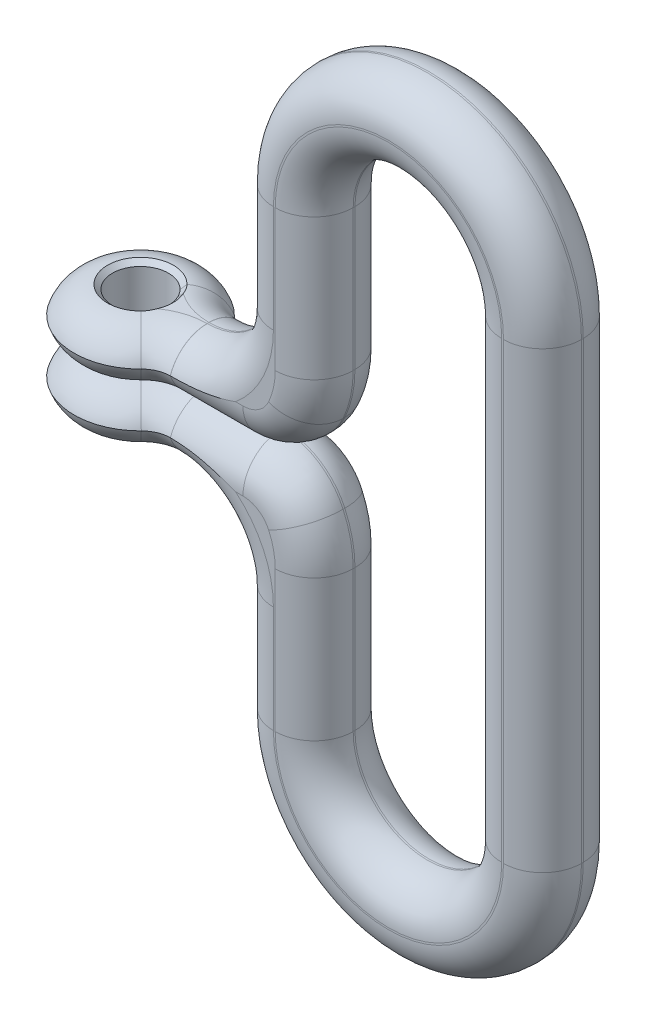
ISO-10303-21;
HEADER;
FILE_DESCRIPTION(('STEP AP214'),'2;1');
FILE_NAME('part.step','',(''),(''),'','','');
FILE_SCHEMA(('AUTOMOTIVE_DESIGN { 1 0 10303 214 1 1 1 1 }'));
ENDSEC;
DATA;
#1=APPLICATION_CONTEXT('core data for automotive mechanical design processes');
#2=APPLICATION_PROTOCOL_DEFINITION('international standard','automotive_design',2000,#1);
#3=PRODUCT_CONTEXT('',#1,'mechanical');
#4=PRODUCT('Part','Part','',(#3));
#5=PRODUCT_RELATED_PRODUCT_CATEGORY('part','',(#4));
#6=PRODUCT_DEFINITION_FORMATION('','',#4);
#7=PRODUCT_DEFINITION_CONTEXT('part definition',#1,'design');
#8=PRODUCT_DEFINITION('design','',#6,#7);
#9=PRODUCT_DEFINITION_SHAPE('','',#8);
#10=(LENGTH_UNIT() NAMED_UNIT(*) SI_UNIT(.MILLI.,.METRE.));
#11=(NAMED_UNIT(*) PLANE_ANGLE_UNIT() SI_UNIT($,.RADIAN.));
#12=(NAMED_UNIT(*) SI_UNIT($,.STERADIAN.) SOLID_ANGLE_UNIT());
#13=UNCERTAINTY_MEASURE_WITH_UNIT(LENGTH_MEASURE(1.E-05),#10,'distance_accuracy_value','');
#14=(GEOMETRIC_REPRESENTATION_CONTEXT(3) GLOBAL_UNCERTAINTY_ASSIGNED_CONTEXT((#13)) GLOBAL_UNIT_ASSIGNED_CONTEXT((#10,
#11,#12)) REPRESENTATION_CONTEXT('',''));
#15=CARTESIAN_POINT('',(0.,0.,0.));
#16=DIRECTION('',(0.,0.,1.));
#17=DIRECTION('',(1.,0.,0.));
#18=AXIS2_PLACEMENT_3D('',#15,#16,#17);
#19=CARTESIAN_POINT('',(-9.14757923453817,-42.1311631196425,2.2606));
#20=DIRECTION('',(0.,0.,1.));
#21=DIRECTION('',(1.,0.,0.));
#22=AXIS2_PLACEMENT_3D('',#19,#20,#21);
#23=PLANE('',#22);
#24=CARTESIAN_POINT('',(-8.73125,12.8587499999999,2.2606));
#25=DIRECTION('',(0.,0.,1.));
#26=DIRECTION('',(1.,0.,0.));
#27=AXIS2_PLACEMENT_3D('',#24,#25,#26);
#28=CIRCLE('',#27,6.41985);
#29=CARTESIAN_POINT('',(-15.1511,12.8587499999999,2.2606));
#30=VERTEX_POINT('',#29);
#31=CARTESIAN_POINT('',(-2.3114,12.8587499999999,2.2606));
#32=VERTEX_POINT('',#31);
#33=EDGE_CURVE('E1815',#30,#32,#28,.F.);
#34=ORIENTED_EDGE('',*,*,#33,.T.);
#35=DIRECTION('',(0.,-1.,0.));
#36=VECTOR('',#35,1.);
#37=CARTESIAN_POINT('',(-2.3114,0.,2.2606));
#38=LINE('',#37,#36);
#39=CARTESIAN_POINT('',(-2.3114,-12.8587499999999,2.2606));
#40=VERTEX_POINT('',#39);
#41=EDGE_CURVE('E1817',#32,#40,#38,.T.);
#42=ORIENTED_EDGE('',*,*,#41,.T.);
#43=CARTESIAN_POINT('',(-8.73125,-12.8587499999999,2.2606));
#44=DIRECTION('',(0.,0.,-1.));
#45=DIRECTION('',(1.,0.,0.));
#46=AXIS2_PLACEMENT_3D('',#43,#44,#45);
#47=CIRCLE('',#46,6.41985);
#48=CARTESIAN_POINT('',(-15.1511,-12.8587499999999,2.2606));
#49=VERTEX_POINT('',#48);
#50=EDGE_CURVE('E438',#49,#40,#47,.F.);
#51=ORIENTED_EDGE('',*,*,#50,.F.);
#52=DIRECTION('',(0.,1.,0.));
#53=VECTOR('',#52,1.);
#54=CARTESIAN_POINT('',(-15.1511,42.1311631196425,2.2606));
#55=LINE('',#54,#53);
#56=CARTESIAN_POINT('',(-15.1511,-4.86410000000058,2.2606));
#57=VERTEX_POINT('',#56);
#58=EDGE_CURVE('E435',#57,#49,#55,.F.);
#59=ORIENTED_EDGE('',*,*,#58,.F.);
#60=CARTESIAN_POINT('',(-19.2913,-4.86410000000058,2.2606));
#61=DIRECTION('',(0.,0.,-1.));
#62=DIRECTION('',(1.,0.,0.));
#63=AXIS2_PLACEMENT_3D('',#60,#61,#62);
#64=CIRCLE('',#63,4.1402);
#65=CARTESIAN_POINT('',(-15.5244573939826,-3.14591699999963,2.2606));
#66=VERTEX_POINT('',#65);
#67=EDGE_CURVE('E432',#66,#57,#64,.T.);
#68=ORIENTED_EDGE('',*,*,#67,.F.);
#69=CARTESIAN_POINT('',(-16.9803536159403,-3.81,2.2606));
#70=DIRECTION('',(0.,0.,-1.));
#71=DIRECTION('',(1.,0.,0.));
#72=AXIS2_PLACEMENT_3D('',#69,#70,#71);
#73=CIRCLE('',#72,1.6002);
#74=CARTESIAN_POINT('',(-16.9803536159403,-2.2098,2.2606));
#75=VERTEX_POINT('',#74);
#76=EDGE_CURVE('E429',#75,#66,#73,.T.);
#77=ORIENTED_EDGE('',*,*,#76,.F.);
#78=DIRECTION('',(-1.,0.,0.));
#79=VECTOR('',#78,1.);
#80=CARTESIAN_POINT('',(-9.14757923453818,-2.2098,2.2606));
#81=LINE('',#80,#79);
#82=CARTESIAN_POINT('',(-17.3998773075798,-2.2098,2.2606));
#83=VERTEX_POINT('',#82);
#84=EDGE_CURVE('E416',#83,#75,#81,.F.);
#85=ORIENTED_EDGE('',*,*,#84,.F.);
#86=CARTESIAN_POINT('',(-21.2223477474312,-6.7951477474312,2.2606));
#87=DIRECTION('',(0.,0.,-1.));
#88=DIRECTION('',(1.,0.,0.));
#89=AXIS2_PLACEMENT_3D('',#86,#87,#88);
#90=CIRCLE('',#89,5.9696477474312);
#91=CARTESIAN_POINT('',(-15.2527,-6.7951477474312,2.2606));
#92=VERTEX_POINT('',#91);
#93=EDGE_CURVE('E398',#92,#83,#90,.F.);
#94=ORIENTED_EDGE('',*,*,#93,.F.);
#95=DIRECTION('',(0.,1.,0.));
#96=VECTOR('',#95,1.);
#97=CARTESIAN_POINT('',(-15.2527,-6.7951477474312,2.2606));
#98=LINE('',#97,#96);
#99=CARTESIAN_POINT('',(-15.2527,-12.8587499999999,2.2606));
#100=VERTEX_POINT('',#99);
#101=EDGE_CURVE('E409',#100,#92,#98,.T.);
#102=ORIENTED_EDGE('',*,*,#101,.F.);
#103=CARTESIAN_POINT('',(-8.73125,-12.8587499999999,2.2606));
#104=DIRECTION('',(0.,0.,-1.));
#105=DIRECTION('',(1.,0.,0.));
#106=AXIS2_PLACEMENT_3D('',#103,#104,#105);
#107=CIRCLE('',#106,6.52145);
#108=CARTESIAN_POINT('',(-2.2098,-12.8587500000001,2.2606));
#109=VERTEX_POINT('',#108);
#110=EDGE_CURVE('E415',#109,#100,#107,.T.);
#111=ORIENTED_EDGE('',*,*,#110,.F.);
#112=DIRECTION('',(0.,-1.,0.));
#113=VECTOR('',#112,1.);
#114=CARTESIAN_POINT('',(-2.2098,-42.1311631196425,2.2606));
#115=LINE('',#114,#113);
#116=CARTESIAN_POINT('',(-2.2098,12.8587500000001,2.2606));
#117=VERTEX_POINT('',#116);
#118=EDGE_CURVE('E1232',#109,#117,#115,.F.);
#119=ORIENTED_EDGE('',*,*,#118,.T.);
#120=CARTESIAN_POINT('',(-8.73125,12.8587499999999,2.2606));
#121=DIRECTION('',(0.,0.,1.));
#122=DIRECTION('',(1.,0.,0.));
#123=AXIS2_PLACEMENT_3D('',#120,#121,#122);
#124=CIRCLE('',#123,6.52145);
#125=CARTESIAN_POINT('',(-15.2527,12.8587499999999,2.2606));
#126=VERTEX_POINT('',#125);
#127=EDGE_CURVE('E1230',#117,#126,#124,.T.);
#128=ORIENTED_EDGE('',*,*,#127,.T.);
#129=DIRECTION('',(0.,-1.,0.));
#130=VECTOR('',#129,1.);
#131=CARTESIAN_POINT('',(-15.2527,6.7951477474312,2.2606));
#132=LINE('',#131,#130);
#133=CARTESIAN_POINT('',(-15.2527,6.7951477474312,2.2606));
#134=VERTEX_POINT('',#133);
#135=EDGE_CURVE('E1808',#126,#134,#132,.T.);
#136=ORIENTED_EDGE('',*,*,#135,.T.);
#137=CARTESIAN_POINT('',(-21.2223477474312,6.7951477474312,2.2606));
#138=DIRECTION('',(0.,0.,1.));
#139=DIRECTION('',(1.,0.,0.));
#140=AXIS2_PLACEMENT_3D('',#137,#138,#139);
#141=CIRCLE('',#140,5.9696477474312);
#142=CARTESIAN_POINT('',(-17.3998773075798,2.2098,2.2606));
#143=VERTEX_POINT('',#142);
#144=EDGE_CURVE('E1799',#134,#143,#141,.F.);
#145=ORIENTED_EDGE('',*,*,#144,.T.);
#146=DIRECTION('',(-1.,0.,0.));
#147=VECTOR('',#146,1.);
#148=CARTESIAN_POINT('',(-9.14757923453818,2.2098,2.2606));
#149=LINE('',#148,#147);
#150=CARTESIAN_POINT('',(-16.9803536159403,2.2098,2.2606));
#151=VERTEX_POINT('',#150);
#152=EDGE_CURVE('E1801',#143,#151,#149,.F.);
#153=ORIENTED_EDGE('',*,*,#152,.T.);
#154=CARTESIAN_POINT('',(-16.9803536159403,3.81,2.2606));
#155=DIRECTION('',(0.,0.,1.));
#156=DIRECTION('',(1.,0.,0.));
#157=AXIS2_PLACEMENT_3D('',#154,#155,#156);
#158=CIRCLE('',#157,1.6002);
#159=CARTESIAN_POINT('',(-15.5244573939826,3.14591699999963,2.2606));
#160=VERTEX_POINT('',#159);
#161=EDGE_CURVE('E1160',#151,#160,#158,.T.);
#162=ORIENTED_EDGE('',*,*,#161,.T.);
#163=CARTESIAN_POINT('',(-19.2913,4.86410000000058,2.2606));
#164=DIRECTION('',(0.,0.,1.));
#165=DIRECTION('',(1.,0.,0.));
#166=AXIS2_PLACEMENT_3D('',#163,#164,#165);
#167=CIRCLE('',#166,4.1402);
#168=CARTESIAN_POINT('',(-15.1511,4.86410000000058,2.2606));
#169=VERTEX_POINT('',#168);
#170=EDGE_CURVE('E1795',#160,#169,#167,.T.);
#171=ORIENTED_EDGE('',*,*,#170,.T.);
#172=DIRECTION('',(0.,-1.,0.));
#173=VECTOR('',#172,1.);
#174=CARTESIAN_POINT('',(-15.1511,-42.1311631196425,2.2606));
#175=LINE('',#174,#173);
#176=EDGE_CURVE('E1792',#169,#30,#175,.F.);
#177=ORIENTED_EDGE('',*,*,#176,.T.);
#178=EDGE_LOOP('',(#34,#42,#51,#59,#68,#77,#85,#94,#102,#111,#119,#128,#136,#145,#153,#162,#171,#177));
#179=FACE_BOUND('',#178,.T.);
#180=ADVANCED_FACE('F40',(#179),#23,.T.);
#181=CARTESIAN_POINT('',(-9.14757923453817,-42.1311631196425,-2.2606));
#182=DIRECTION('',(0.,0.,1.));
#183=DIRECTION('',(1.,0.,0.));
#184=AXIS2_PLACEMENT_3D('',#181,#182,#183);
#185=PLANE('',#184);
#186=CARTESIAN_POINT('',(-8.73125,12.8587499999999,-2.2606));
#187=DIRECTION('',(0.,0.,1.));
#188=DIRECTION('',(1.,0.,0.));
#189=AXIS2_PLACEMENT_3D('',#186,#187,#188);
#190=CIRCLE('',#189,6.52145);
#191=CARTESIAN_POINT('',(-15.2527,12.8587499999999,-2.2606));
#192=VERTEX_POINT('',#191);
#193=CARTESIAN_POINT('',(-2.2098,12.8587500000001,-2.2606));
#194=VERTEX_POINT('',#193);
#195=EDGE_CURVE('E1242',#192,#194,#190,.F.);
#196=ORIENTED_EDGE('',*,*,#195,.T.);
#197=DIRECTION('',(0.,-1.,0.));
#198=VECTOR('',#197,1.);
#199=CARTESIAN_POINT('',(-2.2098,0.,-2.2606));
#200=LINE('',#199,#198);
#201=CARTESIAN_POINT('',(-2.2098,-12.8587500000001,-2.2606));
#202=VERTEX_POINT('',#201);
#203=EDGE_CURVE('E1239',#194,#202,#200,.T.);
#204=ORIENTED_EDGE('',*,*,#203,.T.);
#205=CARTESIAN_POINT('',(-8.73125,-12.8587499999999,-2.2606));
#206=DIRECTION('',(0.,0.,-1.));
#207=DIRECTION('',(1.,0.,0.));
#208=AXIS2_PLACEMENT_3D('',#205,#206,#207);
#209=CIRCLE('',#208,6.52145);
#210=CARTESIAN_POINT('',(-15.2527,-12.8587499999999,-2.2606));
#211=VERTEX_POINT('',#210);
#212=EDGE_CURVE('E480',#211,#202,#209,.F.);
#213=ORIENTED_EDGE('',*,*,#212,.F.);
#214=DIRECTION('',(0.,1.,0.));
#215=VECTOR('',#214,1.);
#216=CARTESIAN_POINT('',(-15.2527,42.1311631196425,-2.2606));
#217=LINE('',#216,#215);
#218=CARTESIAN_POINT('',(-15.2527,-6.7951477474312,-2.2606));
#219=VERTEX_POINT('',#218);
#220=EDGE_CURVE('E477',#219,#211,#217,.F.);
#221=ORIENTED_EDGE('',*,*,#220,.F.);
#222=CARTESIAN_POINT('',(-21.2223477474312,-6.7951477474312,-2.2606));
#223=DIRECTION('',(0.,0.,-1.));
#224=DIRECTION('',(1.,0.,0.));
#225=AXIS2_PLACEMENT_3D('',#222,#223,#224);
#226=CIRCLE('',#225,5.9696477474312);
#227=CARTESIAN_POINT('',(-17.3998773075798,-2.2098,-2.2606));
#228=VERTEX_POINT('',#227);
#229=EDGE_CURVE('E474',#228,#219,#226,.T.);
#230=ORIENTED_EDGE('',*,*,#229,.F.);
#231=DIRECTION('',(-1.,0.,0.));
#232=VECTOR('',#231,1.);
#233=CARTESIAN_POINT('',(-21.2011285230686,-2.2098,-2.2606));
#234=LINE('',#233,#232);
#235=CARTESIAN_POINT('',(-16.9803536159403,-2.2098,-2.2606));
#236=VERTEX_POINT('',#235);
#237=EDGE_CURVE('E471',#236,#228,#234,.T.);
#238=ORIENTED_EDGE('',*,*,#237,.F.);
#239=CARTESIAN_POINT('',(-16.9803536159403,-3.81,-2.2606));
#240=DIRECTION('',(0.,0.,-1.));
#241=DIRECTION('',(1.,0.,0.));
#242=AXIS2_PLACEMENT_3D('',#239,#240,#241);
#243=CIRCLE('',#242,1.6002);
#244=CARTESIAN_POINT('',(-15.5244573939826,-3.14591699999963,-2.2606));
#245=VERTEX_POINT('',#244);
#246=EDGE_CURVE('E462',#245,#236,#243,.F.);
#247=ORIENTED_EDGE('',*,*,#246,.F.);
#248=CARTESIAN_POINT('',(-19.2913,-4.86410000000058,-2.2606));
#249=DIRECTION('',(0.,0.,-1.));
#250=DIRECTION('',(1.,0.,0.));
#251=AXIS2_PLACEMENT_3D('',#248,#249,#250);
#252=CIRCLE('',#251,4.1402);
#253=CARTESIAN_POINT('',(-15.1511,-4.86410000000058,-2.2606));
#254=VERTEX_POINT('',#253);
#255=EDGE_CURVE('E459',#254,#245,#252,.F.);
#256=ORIENTED_EDGE('',*,*,#255,.F.);
#257=DIRECTION('',(0.,1.,0.));
#258=VECTOR('',#257,1.);
#259=CARTESIAN_POINT('',(-15.1511,-4.86410000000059,-2.2606));
#260=LINE('',#259,#258);
#261=CARTESIAN_POINT('',(-15.1511,-12.8587499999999,-2.2606));
#262=VERTEX_POINT('',#261);
#263=EDGE_CURVE('E465',#262,#254,#260,.T.);
#264=ORIENTED_EDGE('',*,*,#263,.F.);
#265=CARTESIAN_POINT('',(-8.73125,-12.8587499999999,-2.2606));
#266=DIRECTION('',(0.,0.,-1.));
#267=DIRECTION('',(1.,0.,0.));
#268=AXIS2_PLACEMENT_3D('',#265,#266,#267);
#269=CIRCLE('',#268,6.41985);
#270=CARTESIAN_POINT('',(-2.3114,-12.8587499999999,-2.2606));
#271=VERTEX_POINT('',#270);
#272=EDGE_CURVE('E468',#271,#262,#269,.T.);
#273=ORIENTED_EDGE('',*,*,#272,.F.);
#274=DIRECTION('',(0.,-1.,0.));
#275=VECTOR('',#274,1.);
#276=CARTESIAN_POINT('',(-2.3114,-42.1311631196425,-2.2606));
#277=LINE('',#276,#275);
#278=CARTESIAN_POINT('',(-2.3114,12.8587499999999,-2.2606));
#279=VERTEX_POINT('',#278);
#280=EDGE_CURVE('E1838',#271,#279,#277,.F.);
#281=ORIENTED_EDGE('',*,*,#280,.T.);
#282=CARTESIAN_POINT('',(-8.73125,12.8587499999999,-2.2606));
#283=DIRECTION('',(0.,0.,1.));
#284=DIRECTION('',(1.,0.,0.));
#285=AXIS2_PLACEMENT_3D('',#282,#283,#284);
#286=CIRCLE('',#285,6.41985);
#287=CARTESIAN_POINT('',(-15.1511,12.8587499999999,-2.2606));
#288=VERTEX_POINT('',#287);
#289=EDGE_CURVE('E1836',#279,#288,#286,.T.);
#290=ORIENTED_EDGE('',*,*,#289,.T.);
#291=DIRECTION('',(0.,-1.,0.));
#292=VECTOR('',#291,1.);
#293=CARTESIAN_POINT('',(-15.1511,4.86410000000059,-2.2606));
#294=LINE('',#293,#292);
#295=CARTESIAN_POINT('',(-15.1511,4.86410000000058,-2.2606));
#296=VERTEX_POINT('',#295);
#297=EDGE_CURVE('E1834',#288,#296,#294,.T.);
#298=ORIENTED_EDGE('',*,*,#297,.T.);
#299=CARTESIAN_POINT('',(-19.2913,4.86410000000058,-2.2606));
#300=DIRECTION('',(0.,0.,1.));
#301=DIRECTION('',(1.,0.,0.));
#302=AXIS2_PLACEMENT_3D('',#299,#300,#301);
#303=CIRCLE('',#302,4.1402);
#304=CARTESIAN_POINT('',(-15.5244573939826,3.14591699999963,-2.2606));
#305=VERTEX_POINT('',#304);
#306=EDGE_CURVE('E1775',#296,#305,#303,.F.);
#307=ORIENTED_EDGE('',*,*,#306,.T.);
#308=CARTESIAN_POINT('',(-16.9803536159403,3.81,-2.2606));
#309=DIRECTION('',(0.,0.,1.));
#310=DIRECTION('',(1.,0.,0.));
#311=AXIS2_PLACEMENT_3D('',#308,#309,#310);
#312=CIRCLE('',#311,1.6002);
#313=CARTESIAN_POINT('',(-16.9803536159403,2.2098,-2.2606));
#314=VERTEX_POINT('',#313);
#315=EDGE_CURVE('E1772',#305,#314,#312,.F.);
#316=ORIENTED_EDGE('',*,*,#315,.T.);
#317=DIRECTION('',(-1.,0.,0.));
#318=VECTOR('',#317,1.);
#319=CARTESIAN_POINT('',(-21.2011285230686,2.2098,-2.2606));
#320=LINE('',#319,#318);
#321=CARTESIAN_POINT('',(-17.3998773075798,2.2098,-2.2606));
#322=VERTEX_POINT('',#321);
#323=EDGE_CURVE('E1840',#314,#322,#320,.T.);
#324=ORIENTED_EDGE('',*,*,#323,.T.);
#325=CARTESIAN_POINT('',(-21.2223477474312,6.7951477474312,-2.2606));
#326=DIRECTION('',(0.,0.,1.));
#327=DIRECTION('',(1.,0.,0.));
#328=AXIS2_PLACEMENT_3D('',#325,#326,#327);
#329=CIRCLE('',#328,5.9696477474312);
#330=CARTESIAN_POINT('',(-15.2527,6.7951477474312,-2.2606));
#331=VERTEX_POINT('',#330);
#332=EDGE_CURVE('E1842',#322,#331,#329,.T.);
#333=ORIENTED_EDGE('',*,*,#332,.T.);
#334=DIRECTION('',(0.,-1.,0.));
#335=VECTOR('',#334,1.);
#336=CARTESIAN_POINT('',(-15.2527,-42.1311631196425,-2.2606));
#337=LINE('',#336,#335);
#338=EDGE_CURVE('E1844',#331,#192,#337,.F.);
#339=ORIENTED_EDGE('',*,*,#338,.T.);
#340=EDGE_LOOP('',(#196,#204,#213,#221,#230,#238,#247,#256,#264,#273,#281,#290,#298,#307,#316,
#324,#333,#339));
#341=FACE_BOUND('',#340,.T.);
#342=ADVANCED_FACE('F803',(#341),#185,.F.);
#343=CARTESIAN_POINT('',(-19.2913,4.86410000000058,2.2606));
#344=DIRECTION('',(0.,0.,-1.));
#345=DIRECTION('',(-1.,0.,0.));
#346=AXIS2_PLACEMENT_3D('',#343,#344,#345);
#347=CYLINDRICAL_SURFACE('',#346,6.35);
#348=DIRECTION('',(0.,0.,-1.));
#349=VECTOR('',#348,1.);
#350=CARTESIAN_POINT('',(-13.5139340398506,2.22884999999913,2.2606));
#351=LINE('',#350,#349);
#352=CARTESIAN_POINT('',(-13.5139340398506,2.22884999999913,0.0508000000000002));
#353=VERTEX_POINT('',#352);
#354=CARTESIAN_POINT('',(-13.5139340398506,2.22884999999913,-0.0508000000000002));
#355=VERTEX_POINT('',#354);
#356=EDGE_CURVE('E1797',#353,#355,#351,.T.);
#357=ORIENTED_EDGE('',*,*,#356,.T.);
#358=CARTESIAN_POINT('',(-19.2913,4.86410000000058,-0.0508000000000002));
#359=DIRECTION('',(0.,0.,1.));
#360=DIRECTION('',(1.,0.,0.));
#361=AXIS2_PLACEMENT_3D('',#358,#359,#360);
#362=CIRCLE('',#361,6.35);
#363=CARTESIAN_POINT('',(-12.9413,4.86410000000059,-0.0508000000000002));
#364=VERTEX_POINT('',#363);
#365=EDGE_CURVE('E1776',#355,#364,#362,.T.);
#366=ORIENTED_EDGE('',*,*,#365,.T.);
#367=DIRECTION('',(0.,0.,-1.));
#368=VECTOR('',#367,1.);
#369=CARTESIAN_POINT('',(-12.9413,4.86410000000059,2.2606));
#370=LINE('',#369,#368);
#371=CARTESIAN_POINT('',(-12.9413,4.86410000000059,0.0508000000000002));
#372=VERTEX_POINT('',#371);
#373=EDGE_CURVE('E1798',#372,#364,#370,.T.);
#374=ORIENTED_EDGE('',*,*,#373,.F.);
#375=CARTESIAN_POINT('',(-19.2913,4.86410000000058,0.0508000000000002));
#376=DIRECTION('',(0.,0.,1.));
#377=DIRECTION('',(1.,0.,0.));
#378=AXIS2_PLACEMENT_3D('',#375,#376,#377);
#379=CIRCLE('',#378,6.35);
#380=EDGE_CURVE('E605',#372,#353,#379,.F.);
#381=ORIENTED_EDGE('',*,*,#380,.T.);
#382=EDGE_LOOP('',(#357,#366,#374,#381));
#383=FACE_BOUND('',#382,.T.);
#384=ADVANCED_FACE('F807',(#383),#347,.T.);
#385=CARTESIAN_POINT('',(-12.9413,-42.1311631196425,2.2606));
#386=DIRECTION('',(1.,0.,0.));
#387=DIRECTION('',(0.,1.,0.));
#388=AXIS2_PLACEMENT_3D('',#385,#386,#387);
#389=PLANE('',#388);
#390=DIRECTION('',(0.,0.,-1.));
#391=VECTOR('',#390,1.);
#392=CARTESIAN_POINT('',(-12.9413,12.8587499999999,2.2606));
#393=LINE('',#392,#391);
#394=CARTESIAN_POINT('',(-12.9413,12.8587499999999,0.0508000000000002));
#395=VERTEX_POINT('',#394);
#396=CARTESIAN_POINT('',(-12.9413,12.8587499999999,-0.0508000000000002));
#397=VERTEX_POINT('',#396);
#398=EDGE_CURVE('E1803',#395,#397,#393,.T.);
#399=ORIENTED_EDGE('',*,*,#398,.F.);
#400=DIRECTION('',(0.,-1.,0.));
#401=VECTOR('',#400,1.);
#402=CARTESIAN_POINT('',(-12.9413,-42.1311631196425,0.0508000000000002));
#403=LINE('',#402,#401);
#404=EDGE_CURVE('E1791',#395,#372,#403,.T.);
#405=ORIENTED_EDGE('',*,*,#404,.T.);
#406=ORIENTED_EDGE('',*,*,#373,.T.);
#407=DIRECTION('',(0.,-1.,0.));
#408=VECTOR('',#407,1.);
#409=CARTESIAN_POINT('',(-12.9413,12.8587499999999,-0.0508000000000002));
#410=LINE('',#409,#408);
#411=EDGE_CURVE('E1827',#364,#397,#410,.F.);
#412=ORIENTED_EDGE('',*,*,#411,.T.);
#413=EDGE_LOOP('',(#399,#405,#406,#412));
#414=FACE_BOUND('',#413,.T.);
#415=ADVANCED_FACE('F812',(#414),#389,.T.);
#416=CARTESIAN_POINT('',(-8.73125,12.8587499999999,2.2606));
#417=DIRECTION('',(0.,0.,-1.));
#418=DIRECTION('',(-1.,0.,0.));
#419=AXIS2_PLACEMENT_3D('',#416,#417,#418);
#420=CYLINDRICAL_SURFACE('',#419,4.21005);
#421=DIRECTION('',(0.,0.,-1.));
#422=VECTOR('',#421,1.);
#423=CARTESIAN_POINT('',(-4.5212,12.8587499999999,2.2606));
#424=LINE('',#423,#422);
#425=CARTESIAN_POINT('',(-4.5212,12.8587499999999,0.0508000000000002));
#426=VERTEX_POINT('',#425);
#427=CARTESIAN_POINT('',(-4.5212,12.8587499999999,-0.0508000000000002));
#428=VERTEX_POINT('',#427);
#429=EDGE_CURVE('E1866',#426,#428,#424,.T.);
#430=ORIENTED_EDGE('',*,*,#429,.F.);
#431=CARTESIAN_POINT('',(-8.73125,12.8587499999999,0.0508000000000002));
#432=DIRECTION('',(0.,0.,1.));
#433=DIRECTION('',(1.,0.,0.));
#434=AXIS2_PLACEMENT_3D('',#431,#432,#433);
#435=CIRCLE('',#434,4.21005);
#436=EDGE_CURVE('E1825',#426,#395,#435,.T.);
#437=ORIENTED_EDGE('',*,*,#436,.T.);
#438=ORIENTED_EDGE('',*,*,#398,.T.);
#439=CARTESIAN_POINT('',(-8.73125,12.8587499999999,-0.0508000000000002));
#440=DIRECTION('',(0.,0.,1.));
#441=DIRECTION('',(1.,0.,0.));
#442=AXIS2_PLACEMENT_3D('',#439,#440,#441);
#443=CIRCLE('',#442,4.21005);
#444=EDGE_CURVE('E1823',#397,#428,#443,.F.);
#445=ORIENTED_EDGE('',*,*,#444,.T.);
#446=EDGE_LOOP('',(#430,#437,#438,#445));
#447=FACE_BOUND('',#446,.T.);
#448=ADVANCED_FACE('F1628',(#447),#420,.F.);
#449=CARTESIAN_POINT('',(-4.5212,-42.1311631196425,2.2606));
#450=DIRECTION('',(1.,0.,0.));
#451=DIRECTION('',(0.,0.,-1.));
#452=AXIS2_PLACEMENT_3D('',#449,#450,#451);
#453=PLANE('',#452);
#454=DIRECTION('',(0.,-1.,0.));
#455=VECTOR('',#454,1.);
#456=CARTESIAN_POINT('',(-4.5212,-42.1311631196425,-0.0508000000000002));
#457=LINE('',#456,#455);
#458=CARTESIAN_POINT('',(-4.5212,-12.8587499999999,-0.0508000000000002));
#459=VERTEX_POINT('',#458);
#460=EDGE_CURVE('E1819',#428,#459,#457,.T.);
#461=ORIENTED_EDGE('',*,*,#460,.T.);
#462=DIRECTION('',(0.,0.,-1.));
#463=VECTOR('',#462,1.);
#464=CARTESIAN_POINT('',(-4.5212,-12.8587499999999,2.2606));
#465=LINE('',#464,#463);
#466=CARTESIAN_POINT('',(-4.5212,-12.8587499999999,0.0508000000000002));
#467=VERTEX_POINT('',#466);
#468=EDGE_CURVE('E1890',#467,#459,#465,.T.);
#469=ORIENTED_EDGE('',*,*,#468,.F.);
#470=DIRECTION('',(0.,-1.,0.));
#471=VECTOR('',#470,1.);
#472=CARTESIAN_POINT('',(-4.5212,12.8587499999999,0.0508000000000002));
#473=LINE('',#472,#471);
#474=EDGE_CURVE('E1821',#467,#426,#473,.F.);
#475=ORIENTED_EDGE('',*,*,#474,.T.);
#476=ORIENTED_EDGE('',*,*,#429,.T.);
#477=EDGE_LOOP('',(#461,#469,#475,#476));
#478=FACE_BOUND('',#477,.T.);
#479=ADVANCED_FACE('F1637',(#478),#453,.F.);
#480=CARTESIAN_POINT('',(0.,-42.1311631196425,2.2606));
#481=DIRECTION('',(1.,0.,0.));
#482=DIRECTION('',(0.,1.,0.));
#483=AXIS2_PLACEMENT_3D('',#480,#481,#482);
#484=PLANE('',#483);
#485=DIRECTION('',(0.,-1.,0.));
#486=VECTOR('',#485,1.);
#487=CARTESIAN_POINT('',(0.,-42.1311631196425,0.0508000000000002));
#488=LINE('',#487,#486);
#489=CARTESIAN_POINT('',(0.,12.8587500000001,0.0508000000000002));
#490=VERTEX_POINT('',#489);
#491=CARTESIAN_POINT('',(0.,-12.8587500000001,0.0508000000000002));
#492=VERTEX_POINT('',#491);
#493=EDGE_CURVE('E1234',#490,#492,#488,.T.);
#494=ORIENTED_EDGE('',*,*,#493,.T.);
#495=DIRECTION('',(0.,0.,-1.));
#496=VECTOR('',#495,1.);
#497=CARTESIAN_POINT('',(0.,-12.8587500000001,2.2606));
#498=LINE('',#497,#496);
#499=CARTESIAN_POINT('',(0.,-12.8587500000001,-0.0508000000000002));
#500=VERTEX_POINT('',#499);
#501=EDGE_CURVE('E1910',#492,#500,#498,.T.);
#502=ORIENTED_EDGE('',*,*,#501,.T.);
#503=DIRECTION('',(0.,-1.,0.));
#504=VECTOR('',#503,1.);
#505=CARTESIAN_POINT('',(0.,12.8587500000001,-0.0508000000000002));
#506=LINE('',#505,#504);
#507=CARTESIAN_POINT('',(0.,12.8587500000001,-0.0508000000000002));
#508=VERTEX_POINT('',#507);
#509=EDGE_CURVE('E1238',#500,#508,#506,.F.);
#510=ORIENTED_EDGE('',*,*,#509,.T.);
#511=DIRECTION('',(0.,0.,-1.));
#512=VECTOR('',#511,1.);
#513=CARTESIAN_POINT('',(0.,12.8587500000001,2.2606));
#514=LINE('',#513,#512);
#515=EDGE_CURVE('E1860',#490,#508,#514,.T.);
#516=ORIENTED_EDGE('',*,*,#515,.F.);
#517=EDGE_LOOP('',(#494,#502,#510,#516));
#518=FACE_BOUND('',#517,.T.);
#519=ADVANCED_FACE('F1648',(#518),#484,.T.);
#520=CARTESIAN_POINT('',(-8.73125,12.8587499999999,2.2606));
#521=DIRECTION('',(0.,0.,-1.));
#522=DIRECTION('',(-1.,0.,0.));
#523=AXIS2_PLACEMENT_3D('',#520,#521,#522);
#524=CYLINDRICAL_SURFACE('',#523,8.73125);
#525=ORIENTED_EDGE('',*,*,#515,.T.);
#526=CARTESIAN_POINT('',(-8.73125,12.8587499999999,-0.0508000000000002));
#527=DIRECTION('',(0.,0.,1.));
#528=DIRECTION('',(1.,0.,0.));
#529=AXIS2_PLACEMENT_3D('',#526,#527,#528);
#530=CIRCLE('',#529,8.73125);
#531=CARTESIAN_POINT('',(-17.4625,12.8587499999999,-0.0508000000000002));
#532=VERTEX_POINT('',#531);
#533=EDGE_CURVE('E1247',#508,#532,#530,.T.);
#534=ORIENTED_EDGE('',*,*,#533,.T.);
#535=DIRECTION('',(0.,0.,-1.));
#536=VECTOR('',#535,1.);
#537=CARTESIAN_POINT('',(-17.4625,12.8587499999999,2.2606));
#538=LINE('',#537,#536);
#539=CARTESIAN_POINT('',(-17.4625,12.8587499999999,0.0508000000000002));
#540=VERTEX_POINT('',#539);
#541=EDGE_CURVE('E1859',#540,#532,#538,.T.);
#542=ORIENTED_EDGE('',*,*,#541,.F.);
#543=CARTESIAN_POINT('',(-8.73125,12.8587499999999,0.0508000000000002));
#544=DIRECTION('',(0.,0.,1.));
#545=DIRECTION('',(1.,0.,0.));
#546=AXIS2_PLACEMENT_3D('',#543,#544,#545);
#547=CIRCLE('',#546,8.73125);
#548=EDGE_CURVE('E1229',#540,#490,#547,.F.);
#549=ORIENTED_EDGE('',*,*,#548,.T.);
#550=EDGE_LOOP('',(#525,#534,#542,#549));
#551=FACE_BOUND('',#550,.T.);
#552=ADVANCED_FACE('F1643',(#551),#524,.T.);
#553=CARTESIAN_POINT('',(-17.4625,-42.1311631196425,2.2606));
#554=DIRECTION('',(1.,0.,0.));
#555=DIRECTION('',(0.,0.,-1.));
#556=AXIS2_PLACEMENT_3D('',#553,#554,#555);
#557=PLANE('',#556);
#558=ORIENTED_EDGE('',*,*,#541,.T.);
#559=DIRECTION('',(0.,-1.,0.));
#560=VECTOR('',#559,1.);
#561=CARTESIAN_POINT('',(-17.4625,-42.1311631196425,-0.0508000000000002));
#562=LINE('',#561,#560);
#563=CARTESIAN_POINT('',(-17.4625,6.7951477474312,-0.0508000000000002));
#564=VERTEX_POINT('',#563);
#565=EDGE_CURVE('E1251',#532,#564,#562,.T.);
#566=ORIENTED_EDGE('',*,*,#565,.T.);
#567=DIRECTION('',(0.,0.,-1.));
#568=VECTOR('',#567,1.);
#569=CARTESIAN_POINT('',(-17.4625,6.7951477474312,2.2606));
#570=LINE('',#569,#568);
#571=CARTESIAN_POINT('',(-17.4625,6.7951477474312,0.0508000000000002));
#572=VERTEX_POINT('',#571);
#573=EDGE_CURVE('E1864',#572,#564,#570,.T.);
#574=ORIENTED_EDGE('',*,*,#573,.F.);
#575=DIRECTION('',(0.,-1.,0.));
#576=VECTOR('',#575,1.);
#577=CARTESIAN_POINT('',(-17.4625,12.8587499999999,0.0508000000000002));
#578=LINE('',#577,#576);
#579=EDGE_CURVE('E1249',#572,#540,#578,.F.);
#580=ORIENTED_EDGE('',*,*,#579,.T.);
#581=EDGE_LOOP('',(#558,#566,#574,#580));
#582=FACE_BOUND('',#581,.T.);
#583=ADVANCED_FACE('F823',(#582),#557,.F.);
#584=CARTESIAN_POINT('',(-21.2223477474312,6.7951477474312,2.2606));
#585=DIRECTION('',(0.,0.,-1.));
#586=DIRECTION('',(-1.,0.,0.));
#587=AXIS2_PLACEMENT_3D('',#584,#585,#586);
#588=CYLINDRICAL_SURFACE('',#587,3.7598477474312);
#589=ORIENTED_EDGE('',*,*,#573,.T.);
#590=CARTESIAN_POINT('',(-21.2223477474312,6.7951477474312,-0.0508000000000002));
#591=DIRECTION('',(0.,0.,1.));
#592=DIRECTION('',(1.,0.,0.));
#593=AXIS2_PLACEMENT_3D('',#590,#591,#592);
#594=CIRCLE('',#593,3.7598477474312);
#595=CARTESIAN_POINT('',(-21.2089832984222,3.03532375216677,-0.0508000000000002));
#596=VERTEX_POINT('',#595);
#597=EDGE_CURVE('E595',#564,#596,#594,.F.);
#598=ORIENTED_EDGE('',*,*,#597,.T.);
#599=CARTESIAN_POINT('',(-21.2624398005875,3.03551376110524,-0.0517647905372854));
#600=CARTESIAN_POINT('',(-21.2122256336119,3.03497828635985,-2.2604584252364));
#601=CARTESIAN_POINT('',(-21.2357713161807,0.825839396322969,-2.26099379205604));
#602=CARTESIAN_POINT('',(-21.2557589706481,3.03544251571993,-0.0515236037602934));
#603=CARTESIAN_POINT('',(-21.211814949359,3.03506316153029,-2.26051604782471));
#604=CARTESIAN_POINT('',(-21.2314417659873,0.825726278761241,-2.26089534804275));
#605=CARTESIAN_POINT('',(-21.2490772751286,3.03538907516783,-0.0513276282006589));
#606=CARTESIAN_POINT('',(-21.2114075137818,3.03513242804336,-2.26055873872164));
#607=CARTESIAN_POINT('',(-21.2271116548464,0.825641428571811,-2.26081535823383));
#608=CARTESIAN_POINT('',(-21.2357130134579,3.03531781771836,-0.0510261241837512));
#609=CARTESIAN_POINT('',(-21.2105963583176,3.03523968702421,-2.26061416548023));
#610=CARTESIAN_POINT('',(-21.2184508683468,0.82552828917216,-2.26069229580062));
#611=CARTESIAN_POINT('',(-21.2290304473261,3.03530000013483,-0.0509205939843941));
#612=CARTESIAN_POINT('',(-21.2101926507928,3.03527767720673,-2.26062689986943));
#613=CARTESIAN_POINT('',(-21.2141201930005,0.825499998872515,-2.26064922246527));
#614=CARTESIAN_POINT('',(-21.2201203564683,3.03529999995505,-0.050840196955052));
#615=CARTESIAN_POINT('',(-21.2096550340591,3.03530744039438,-2.26062384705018));
#616=CARTESIAN_POINT('',(-21.2083459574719,0.825500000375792,-2.26061640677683));
#617=CARTESIAN_POINT('',(-21.2178929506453,3.0353019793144,-0.0508251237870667));
#618=CARTESIAN_POINT('',(-21.2095206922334,3.03531314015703,-2.26062141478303));
#619=CARTESIAN_POINT('',(-21.2069024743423,0.825503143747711,-2.26061025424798));
#620=CARTESIAN_POINT('',(-21.2134381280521,3.03530989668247,-0.0508050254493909));
#621=CARTESIAN_POINT('',(-21.2092520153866,3.0353210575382,-2.2606132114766));
#622=CARTESIAN_POINT('',(-21.2040155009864,0.825515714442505,-2.26060205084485));
#623=CARTESIAN_POINT('',(-21.211210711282,3.03531583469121,-0.0508000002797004));
#624=CARTESIAN_POINT('',(-21.2091176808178,3.03532327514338,-2.26060744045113));
#625=CARTESIAN_POINT('',(-21.2025720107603,0.82552514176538,-2.26059999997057));
#626=CARTESIAN_POINT('',(-21.2023005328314,3.03534750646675,-0.050799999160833));
#627=CARTESIAN_POINT('',(-21.2085801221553,3.03532518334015,-2.26057767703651));
#628=CARTESIAN_POINT('',(-21.1967977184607,0.825575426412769,-2.26060000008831));
#629=CARTESIAN_POINT('',(-21.1956178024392,3.0353890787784,-0.0508452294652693));
#630=CARTESIAN_POINT('',(-21.2081765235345,3.03531094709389,-2.26054032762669));
#631=CARTESIAN_POINT('',(-21.1924669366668,0.825641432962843,-2.26061846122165));
#632=CARTESIAN_POINT('',(-21.1822530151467,3.03550784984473,-0.051026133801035));
#633=CARTESIAN_POINT('',(-21.2073657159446,3.0352511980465,-2.26043564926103));
#634=CARTESIAN_POINT('',(-21.1838058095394,0.825830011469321,-2.26069229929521));
#635=CARTESIAN_POINT('',(-21.1755709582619,3.03558504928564,-0.0511618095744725));
#636=CARTESIAN_POINT('',(-21.2069585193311,3.03520568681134,-2.26036832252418));
#637=CARTESIAN_POINT('',(-21.1794754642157,0.825952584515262,-2.2607476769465));
#638=CARTESIAN_POINT('',(-21.1688896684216,3.03568005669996,-0.0513426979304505));
#639=CARTESIAN_POINT('',(-21.2065481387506,3.03514456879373,-2.26028604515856));
#640=CARTESIAN_POINT('',(-21.1751456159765,0.826103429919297,-2.26082150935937));
#641=(BOUNDED_SURFACE() B_SPLINE_SURFACE(3,2,((#599,#600,#601),(#602,#603,#604),(#605,#606,
#607),(#608,#609,#610),(#611,#612,#613),(#614,#615,#616),(#617,#618,#619),(#620,#621,#622),
(#623,#624,#625),(#626,#627,#628),(#629,#630,#631),(#632,#633,#634),(#635,#636,#637),(#638,#639,
#640)),.UNSPECIFIED.,.F.,.F.,.F.) B_SPLINE_SURFACE_WITH_KNOTS((4,2,2,2,2,2,4),(3,3),(0.,
0.0318321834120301,0.0636637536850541,0.0742734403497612,0.0848831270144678,0.11671469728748,
0.148546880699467),(0.,1.),
.UNSPECIFIED.) GEOMETRIC_REPRESENTATION_ITEM() RATIONAL_B_SPLINE_SURFACE(((1.,0.707192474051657,
1.),(1.,0.707167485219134,1.),(1.,0.707147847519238,1.),(1.,0.707119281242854,1.),(1.,
0.707110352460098,1.),(1.,0.707105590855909,1.),(1.,0.707104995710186,1.),(1.,0.707104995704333,
1.),(1.,0.707105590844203,1.),(1.,0.70711035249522,1.),(1.,0.707119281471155,1.),(1.,
0.707147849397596,1.),(1.,0.707167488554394,1.),(1.,0.707192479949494,1.))) REPRESENTATION_ITEM('') SURFACE());
#642=CARTESIAN_POINT('',(-21.1688896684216,3.03568005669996,-0.0513426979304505));
#643=CARTESIAN_POINT('',(-21.1755709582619,3.03558504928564,-0.0511618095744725));
#644=CARTESIAN_POINT('',(-21.1822530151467,3.03550784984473,-0.051026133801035));
#645=CARTESIAN_POINT('',(-21.1956178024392,3.0353890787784,-0.0508452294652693));
#646=CARTESIAN_POINT('',(-21.2023005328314,3.03534750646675,-0.050799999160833));
#647=CARTESIAN_POINT('',(-21.211210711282,3.0353158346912,-0.0508000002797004));
#648=CARTESIAN_POINT('',(-21.2134381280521,3.03530989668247,-0.0508050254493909));
#649=CARTESIAN_POINT('',(-21.2178929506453,3.0353019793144,-0.0508251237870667));
#650=CARTESIAN_POINT('',(-21.2201203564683,3.03529999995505,-0.050840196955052));
#651=CARTESIAN_POINT('',(-21.2290304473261,3.03530000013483,-0.0509205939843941));
#652=CARTESIAN_POINT('',(-21.2357130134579,3.03531781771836,-0.0510261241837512));
#653=CARTESIAN_POINT('',(-21.2490772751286,3.03538907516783,-0.0513276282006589));
#654=CARTESIAN_POINT('',(-21.2557589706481,3.03544251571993,-0.0515236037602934));
#655=CARTESIAN_POINT('',(-21.2624398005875,3.03551376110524,-0.0517647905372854));
#656=B_SPLINE_CURVE_WITH_KNOTS('',3,(#642,#643,#644,#645,#646,#647,#648,#649,#650,#651,#652,
#653,#654,#655),.UNSPECIFIED.,.F.,.F.,(4,2,2,2,2,2,4),(0.,0.0318321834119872,0.0636637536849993,
0.0742734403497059,0.084883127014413,0.116714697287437,0.148546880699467),.UNSPECIFIED.);
#657=CARTESIAN_POINT('',(-21.2223477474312,3.03529999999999,-0.0508602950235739));
#658=VERTEX_POINT('',#657);
#659=EDGE_CURVE('E828',#596,#658,#656,.T.);
#660=ORIENTED_EDGE('',*,*,#659,.T.);
#661=DIRECTION('',(0.,0.,-1.));
#662=VECTOR('',#661,1.);
#663=CARTESIAN_POINT('',(-21.2223477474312,3.03529999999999,2.2606));
#664=LINE('',#663,#662);
#665=CARTESIAN_POINT('',(-21.2223477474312,3.03529999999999,0.0508602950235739));
#666=VERTEX_POINT('',#665);
#667=EDGE_CURVE('E669',#666,#658,#664,.T.);
#668=ORIENTED_EDGE('',*,*,#667,.F.);
#669=CARTESIAN_POINT('',(-21.1688896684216,3.03568005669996,0.05134269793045));
#670=CARTESIAN_POINT('',(-21.2065481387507,3.03514456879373,2.26028604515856));
#671=CARTESIAN_POINT('',(-21.1751456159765,0.826103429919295,2.26082150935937));
#672=CARTESIAN_POINT('',(-21.1755709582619,3.03558504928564,0.0511618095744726));
#673=CARTESIAN_POINT('',(-21.2069585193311,3.03520568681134,2.26036832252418));
#674=CARTESIAN_POINT('',(-21.1794754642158,0.82595258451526,2.26074767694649));
#675=CARTESIAN_POINT('',(-21.1822530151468,3.03550784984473,0.0510261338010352));
#676=CARTESIAN_POINT('',(-21.2073657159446,3.03525119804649,2.26043564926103));
#677=CARTESIAN_POINT('',(-21.1838058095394,0.82583001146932,2.26069229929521));
#678=CARTESIAN_POINT('',(-21.1956178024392,3.0353890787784,0.0508452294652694));
#679=CARTESIAN_POINT('',(-21.2081765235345,3.03531094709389,2.26054032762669));
#680=CARTESIAN_POINT('',(-21.1924669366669,0.825641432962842,2.26061846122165));
#681=CARTESIAN_POINT('',(-21.2023005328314,3.03534750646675,0.050799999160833));
#682=CARTESIAN_POINT('',(-21.2085801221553,3.03532518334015,2.26057767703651));
#683=CARTESIAN_POINT('',(-21.1967977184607,0.825575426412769,2.26060000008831));
#684=CARTESIAN_POINT('',(-21.211210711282,3.0353158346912,0.0508000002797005));
#685=CARTESIAN_POINT('',(-21.2091176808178,3.03532327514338,2.26060744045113));
#686=CARTESIAN_POINT('',(-21.2025720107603,0.82552514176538,2.26059999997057));
#687=CARTESIAN_POINT('',(-21.2134381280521,3.03530989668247,0.050805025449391));
#688=CARTESIAN_POINT('',(-21.2092520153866,3.0353210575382,2.2606132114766));
#689=CARTESIAN_POINT('',(-21.2040155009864,0.825515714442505,2.26060205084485));
#690=CARTESIAN_POINT('',(-21.2178929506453,3.0353019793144,0.0508251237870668));
#691=CARTESIAN_POINT('',(-21.2095206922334,3.03531314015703,2.26062141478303));
#692=CARTESIAN_POINT('',(-21.2069024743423,0.825503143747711,2.26061025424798));
#693=CARTESIAN_POINT('',(-21.2201203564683,3.03529999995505,0.0508401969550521));
#694=CARTESIAN_POINT('',(-21.2096550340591,3.03530744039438,2.26062384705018));
#695=CARTESIAN_POINT('',(-21.2083459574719,0.825500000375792,2.26061640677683));
#696=CARTESIAN_POINT('',(-21.2290304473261,3.03530000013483,0.0509205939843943));
#697=CARTESIAN_POINT('',(-21.2101926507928,3.03527767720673,2.26062689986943));
#698=CARTESIAN_POINT('',(-21.2141201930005,0.825499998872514,2.26064922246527));
#699=CARTESIAN_POINT('',(-21.2357130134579,3.03531781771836,0.0510261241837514));
#700=CARTESIAN_POINT('',(-21.2105963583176,3.03523968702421,2.26061416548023));
#701=CARTESIAN_POINT('',(-21.2184508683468,0.82552828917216,2.26069229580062));
#702=CARTESIAN_POINT('',(-21.2490772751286,3.03538907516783,0.051327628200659));
#703=CARTESIAN_POINT('',(-21.2114075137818,3.03513242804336,2.26055873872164));
#704=CARTESIAN_POINT('',(-21.2271116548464,0.825641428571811,2.26081535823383));
#705=CARTESIAN_POINT('',(-21.2557589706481,3.03544251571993,0.0515236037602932));
#706=CARTESIAN_POINT('',(-21.211814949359,3.03506316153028,2.26051604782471));
#707=CARTESIAN_POINT('',(-21.2314417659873,0.825726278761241,2.26089534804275));
#708=CARTESIAN_POINT('',(-21.2624398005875,3.03551376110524,0.0517647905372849));
#709=CARTESIAN_POINT('',(-21.2122256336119,3.03497828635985,2.2604584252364));
#710=CARTESIAN_POINT('',(-21.2357713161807,0.825839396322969,2.26099379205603));
#711=(BOUNDED_SURFACE() B_SPLINE_SURFACE(3,2,((#669,#670,#671),(#672,#673,#674),(#675,#676,
#677),(#678,#679,#680),(#681,#682,#683),(#684,#685,#686),(#687,#688,#689),(#690,#691,#692),
(#693,#694,#695),(#696,#697,#698),(#699,#700,#701),(#702,#703,#704),(#705,#706,#707),(#708,#709,
#710)),.UNSPECIFIED.,.F.,.F.,.F.) B_SPLINE_SURFACE_WITH_KNOTS((4,2,2,2,2,2,4),(3,3),(0.,
0.0318321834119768,0.0636637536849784,0.0742734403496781,0.0848831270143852,0.116714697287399,
0.148546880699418),(0.,1.),
.UNSPECIFIED.) GEOMETRIC_REPRESENTATION_ITEM() RATIONAL_B_SPLINE_SURFACE(((1.,0.707192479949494,
1.),(1.,0.707167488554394,1.),(1.,0.707147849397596,1.),(1.,0.707119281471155,1.),(1.,
0.707110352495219,1.),(1.,0.707105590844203,1.),(1.,0.707104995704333,1.),(1.,0.707104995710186,
1.),(1.,0.707105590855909,1.),(1.,0.707110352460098,1.),(1.,0.707119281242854,1.),(1.,
0.707147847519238,1.),(1.,0.707167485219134,1.),(1.,0.707192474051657,1.))) REPRESENTATION_ITEM('') SURFACE());
#712=CARTESIAN_POINT('',(-21.2624398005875,3.03551376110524,0.0517647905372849));
#713=CARTESIAN_POINT('',(-21.2557589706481,3.03544251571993,0.0515236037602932));
#714=CARTESIAN_POINT('',(-21.2490772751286,3.03538907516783,0.051327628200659));
#715=CARTESIAN_POINT('',(-21.2357130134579,3.03531781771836,0.0510261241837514));
#716=CARTESIAN_POINT('',(-21.2290304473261,3.03530000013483,0.0509205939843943));
#717=CARTESIAN_POINT('',(-21.2201203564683,3.03529999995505,0.0508401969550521));
#718=CARTESIAN_POINT('',(-21.2178929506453,3.0353019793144,0.0508251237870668));
#719=CARTESIAN_POINT('',(-21.2134381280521,3.03530989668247,0.050805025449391));
#720=CARTESIAN_POINT('',(-21.211210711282,3.0353158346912,0.0508000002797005));
#721=CARTESIAN_POINT('',(-21.2023005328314,3.03534750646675,0.050799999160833));
#722=CARTESIAN_POINT('',(-21.1956178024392,3.0353890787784,0.0508452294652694));
#723=CARTESIAN_POINT('',(-21.1822530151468,3.03550784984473,0.0510261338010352));
#724=CARTESIAN_POINT('',(-21.1755709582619,3.03558504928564,0.0511618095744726));
#725=CARTESIAN_POINT('',(-21.1688896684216,3.03568005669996,0.05134269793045));
#726=B_SPLINE_CURVE_WITH_KNOTS('',3,(#712,#713,#714,#715,#716,#717,#718,#719,#720,#721,#722,
#723,#724,#725),.UNSPECIFIED.,.F.,.F.,(4,2,2,2,2,2,4),(0.,0.0318321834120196,0.0636637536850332,
0.0742734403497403,0.08488312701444,0.116714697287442,0.148546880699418),.UNSPECIFIED.);
#727=CARTESIAN_POINT('',(-21.2089832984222,3.03532375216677,0.0508000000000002));
#728=VERTEX_POINT('',#727);
#729=EDGE_CURVE('E1254',#666,#728,#726,.T.);
#730=ORIENTED_EDGE('',*,*,#729,.T.);
#731=CARTESIAN_POINT('',(-21.2223477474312,6.7951477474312,0.0508000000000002));
#732=DIRECTION('',(0.,0.,1.));
#733=DIRECTION('',(1.,0.,0.));
#734=AXIS2_PLACEMENT_3D('',#731,#732,#733);
#735=CIRCLE('',#734,3.7598477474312);
#736=EDGE_CURVE('E1253',#728,#572,#735,.T.);
#737=ORIENTED_EDGE('',*,*,#736,.T.);
#738=EDGE_LOOP('',(#589,#598,#660,#668,#730,#737));
#739=FACE_BOUND('',#738,.T.);
#740=ADVANCED_FACE('F818',(#739),#588,.F.);
#741=CARTESIAN_POINT('',(-9.14757923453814,3.03529999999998,2.2606));
#742=DIRECTION('',(0.,-1.,0.));
#743=DIRECTION('',(1.,0.,0.));
#744=AXIS2_PLACEMENT_3D('',#741,#742,#743);
#745=PLANE('',#744);
#746=CARTESIAN_POINT('',(-21.2011285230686,3.03529999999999,-3.7846));
#747=DIRECTION('',(0.,-1.,0.));
#748=DIRECTION('',(1.,0.,0.));
#749=AXIS2_PLACEMENT_3D('',#746,#747,#748);
#750=CIRCLE('',#749,3.7338);
#751=CARTESIAN_POINT('',(-23.3635095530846,3.03529999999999,-0.740692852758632));
#752=VERTEX_POINT('',#751);
#753=EDGE_CURVE('E594',#658,#752,#750,.T.);
#754=ORIENTED_EDGE('',*,*,#753,.T.);
#755=CARTESIAN_POINT('',(-25.04948,3.0353,0.));
#756=DIRECTION('',(0.,-1.,0.));
#757=DIRECTION('',(1.,0.,0.));
#758=AXIS2_PLACEMENT_3D('',#755,#756,#757);
#759=CIRCLE('',#758,1.84149999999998);
#760=CARTESIAN_POINT('',(-23.3635095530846,3.03529999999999,0.740692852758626));
#761=VERTEX_POINT('',#760);
#762=EDGE_CURVE('E11',#752,#761,#759,.T.);
#763=ORIENTED_EDGE('',*,*,#762,.T.);
#764=CARTESIAN_POINT('',(-21.2011285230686,3.03529999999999,3.7846));
#765=DIRECTION('',(0.,-1.,0.));
#766=DIRECTION('',(1.,0.,0.));
#767=AXIS2_PLACEMENT_3D('',#764,#765,#766);
#768=CIRCLE('',#767,3.7338);
#769=EDGE_CURVE('E586',#761,#666,#768,.T.);
#770=ORIENTED_EDGE('',*,*,#769,.T.);
#771=ORIENTED_EDGE('',*,*,#667,.T.);
#772=EDGE_LOOP('',(#754,#763,#770,#771));
#773=FACE_BOUND('',#772,.T.);
#774=ADVANCED_FACE('F692',(#773),#745,.F.);
#775=CARTESIAN_POINT('',(-25.04948,127.,0.));
#776=DIRECTION('',(0.,-1.,0.));
#777=DIRECTION('',(0.,0.,-1.));
#778=AXIS2_PLACEMENT_3D('',#775,#776,#777);
#779=CYLINDRICAL_SURFACE('',#778,1.5875);
#780=CARTESIAN_POINT('',(-25.04948,-2.78129999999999,0.));
#781=DIRECTION('',(0.,1.,0.));
#782=DIRECTION('',(0.,0.,1.));
#783=AXIS2_PLACEMENT_3D('',#780,#781,#782);
#784=CIRCLE('',#783,1.5875);
#785=CARTESIAN_POINT('',(-23.5960572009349,-2.78129999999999,-0.638528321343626));
#786=VERTEX_POINT('',#785);
#787=CARTESIAN_POINT('',(-23.5960572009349,-2.78129999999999,0.638528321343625));
#788=VERTEX_POINT('',#787);
#789=EDGE_CURVE('E712',#786,#788,#784,.F.);
#790=ORIENTED_EDGE('',*,*,#789,.T.);
#791=CARTESIAN_POINT('',(-23.9176119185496,-2.77320141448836,1.11311764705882));
#792=CARTESIAN_POINT('',(-23.7814790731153,-2.77270531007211,0.974365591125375));
#793=CARTESIAN_POINT('',(-23.6741807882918,-2.78084444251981,0.815832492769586));
#794=CARTESIAN_POINT('',(-23.5960572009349,-2.78129999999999,0.638528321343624));
#795=B_SPLINE_CURVE_WITH_KNOTS('',3,(#791,#792,#793,#794),.UNSPECIFIED.,.F.,.F.,(4,4),
(0.00834191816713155,0.0090078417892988),.UNSPECIFIED.);
#796=CARTESIAN_POINT('',(-23.9176119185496,-2.77320141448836,1.11311764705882));
#797=VERTEX_POINT('',#796);
#798=EDGE_CURVE('E725',#788,#797,#795,.F.);
#799=ORIENTED_EDGE('',*,*,#798,.T.);
#800=CARTESIAN_POINT('',(-25.04948,-2.77320141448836,0.));
#801=DIRECTION('',(0.,-1.,0.));
#802=DIRECTION('',(0.,0.,-1.));
#803=AXIS2_PLACEMENT_3D('',#800,#801,#802);
#804=CIRCLE('',#803,1.5875);
#805=CARTESIAN_POINT('',(-23.9176119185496,-2.77320141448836,-1.11311764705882));
#806=VERTEX_POINT('',#805);
#807=EDGE_CURVE('E723',#797,#806,#804,.T.);
#808=ORIENTED_EDGE('',*,*,#807,.T.);
#809=CARTESIAN_POINT('',(-23.5960572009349,-2.78129999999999,-0.638528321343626));
#810=CARTESIAN_POINT('',(-23.674421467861,-2.78083494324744,-0.816280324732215));
#811=CARTESIAN_POINT('',(-23.781573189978,-2.77270316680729,-0.974430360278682));
#812=CARTESIAN_POINT('',(-23.9176119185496,-2.77320141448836,-1.11311764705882));
#813=B_SPLINE_CURVE_WITH_KNOTS('',3,(#809,#810,#811,#812),.UNSPECIFIED.,.F.,.F.,(4,4),(0.,
0.000665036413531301),.UNSPECIFIED.);
#814=EDGE_CURVE('E719',#806,#786,#813,.F.);
#815=ORIENTED_EDGE('',*,*,#814,.T.);
#816=EDGE_LOOP('',(#790,#799,#808,#815));
#817=FACE_BOUND('',#816,.T.);
#818=CARTESIAN_POINT('',(-23.5960572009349,2.78129999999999,0.63852832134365));
#819=CARTESIAN_POINT('',(-23.6741807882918,2.78084444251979,0.815832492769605));
#820=CARTESIAN_POINT('',(-23.7814790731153,2.77270531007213,0.97436559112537));
#821=CARTESIAN_POINT('',(-23.9176119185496,2.77320141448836,1.11311764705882));
#822=B_SPLINE_CURVE_WITH_KNOTS('',3,(#818,#819,#820,#821),.UNSPECIFIED.,.F.,.F.,(4,4),
(0.00834191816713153,0.00900784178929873),.UNSPECIFIED.);
#823=CARTESIAN_POINT('',(-23.9176119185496,2.77320141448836,1.11311764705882));
#824=VERTEX_POINT('',#823);
#825=CARTESIAN_POINT('',(-23.5960572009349,2.78129999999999,0.63852832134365));
#826=VERTEX_POINT('',#825);
#827=EDGE_CURVE('E674',#824,#826,#822,.F.);
#828=ORIENTED_EDGE('',*,*,#827,.T.);
#829=CARTESIAN_POINT('',(-25.04948,2.78130000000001,0.));
#830=DIRECTION('',(0.,-1.,0.));
#831=DIRECTION('',(0.,0.,-1.));
#832=AXIS2_PLACEMENT_3D('',#829,#830,#831);
#833=CIRCLE('',#832,1.5875);
#834=CARTESIAN_POINT('',(-23.5960572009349,2.78129999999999,-0.638528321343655));
#835=VERTEX_POINT('',#834);
#836=EDGE_CURVE('E720',#826,#835,#833,.F.);
#837=ORIENTED_EDGE('',*,*,#836,.T.);
#838=CARTESIAN_POINT('',(-23.9176119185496,2.77320141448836,-1.11311764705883));
#839=CARTESIAN_POINT('',(-23.781573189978,2.77270316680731,-0.974430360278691));
#840=CARTESIAN_POINT('',(-23.674421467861,2.78083494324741,-0.816280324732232));
#841=CARTESIAN_POINT('',(-23.5960572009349,2.78129999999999,-0.638528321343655));
#842=B_SPLINE_CURVE_WITH_KNOTS('',3,(#838,#839,#840,#841),.UNSPECIFIED.,.F.,.F.,(4,4),(0.,
0.000665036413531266),.UNSPECIFIED.);
#843=CARTESIAN_POINT('',(-23.9176119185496,2.77320141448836,-1.11311764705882));
#844=VERTEX_POINT('',#843);
#845=EDGE_CURVE('E2178',#835,#844,#842,.F.);
#846=ORIENTED_EDGE('',*,*,#845,.T.);
#847=CARTESIAN_POINT('',(-25.04948,2.77320141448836,0.));
#848=DIRECTION('',(0.,1.,0.));
#849=DIRECTION('',(0.,0.,1.));
#850=AXIS2_PLACEMENT_3D('',#847,#848,#849);
#851=CIRCLE('',#850,1.5875);
#852=EDGE_CURVE('E679',#844,#824,#851,.T.);
#853=ORIENTED_EDGE('',*,*,#852,.T.);
#854=EDGE_LOOP('',(#828,#837,#846,#853));
#855=FACE_BOUND('',#854,.T.);
#856=ADVANCED_FACE('F681',(#817,#855),#779,.F.);
#857=CARTESIAN_POINT('',(-16.9803536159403,3.81,2.2606));
#858=DIRECTION('',(0.,0.,-1.));
#859=DIRECTION('',(-1.,0.,0.));
#860=AXIS2_PLACEMENT_3D('',#857,#858,#859);
#861=CYLINDRICAL_SURFACE('',#860,3.81);
#862=ORIENTED_EDGE('',*,*,#356,.F.);
#863=CARTESIAN_POINT('',(-16.9803536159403,3.81,0.0508000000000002));
#864=DIRECTION('',(0.,0.,1.));
#865=DIRECTION('',(1.,0.,0.));
#866=AXIS2_PLACEMENT_3D('',#863,#864,#865);
#867=CIRCLE('',#866,3.81);
#868=CARTESIAN_POINT('',(-16.9803536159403,0.,0.0508000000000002));
#869=VERTEX_POINT('',#868);
#870=EDGE_CURVE('E1158',#353,#869,#867,.F.);
#871=ORIENTED_EDGE('',*,*,#870,.T.);
#872=DIRECTION('',(0.,0.,1.));
#873=VECTOR('',#872,1.);
#874=CARTESIAN_POINT('',(-16.9803536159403,0.,2.2606));
#875=LINE('',#874,#873);
#876=CARTESIAN_POINT('',(-16.9803536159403,0.,-0.0508000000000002));
#877=VERTEX_POINT('',#876);
#878=EDGE_CURVE('E420',#877,#869,#875,.T.);
#879=ORIENTED_EDGE('',*,*,#878,.F.);
#880=CARTESIAN_POINT('',(-16.9803536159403,3.81,-0.0508000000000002));
#881=DIRECTION('',(0.,0.,1.));
#882=DIRECTION('',(1.,0.,0.));
#883=AXIS2_PLACEMENT_3D('',#880,#881,#882);
#884=CIRCLE('',#883,3.81);
#885=EDGE_CURVE('E1771',#877,#355,#884,.T.);
#886=ORIENTED_EDGE('',*,*,#885,.T.);
#887=EDGE_LOOP('',(#862,#871,#879,#886));
#888=FACE_BOUND('',#887,.T.);
#889=ADVANCED_FACE('F691',(#888),#861,.T.);
#890=CARTESIAN_POINT('',(-2.3114,-42.1311631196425,-0.0508000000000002));
#891=DIRECTION('',(0.,-1.,0.));
#892=DIRECTION('',(0.,0.,-1.));
#893=AXIS2_PLACEMENT_3D('',#890,#891,#892);
#894=CYLINDRICAL_SURFACE('',#893,2.2098);
#895=ORIENTED_EDGE('',*,*,#280,.F.);
#896=CARTESIAN_POINT('',(-2.3114,-12.8587499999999,-0.0508000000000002));
#897=DIRECTION('',(0.,1.,0.));
#898=DIRECTION('',(0.,0.,1.));
#899=AXIS2_PLACEMENT_3D('',#896,#897,#898);
#900=CIRCLE('',#899,2.2098);
#901=EDGE_CURVE('E1887',#271,#459,#900,.T.);
#902=ORIENTED_EDGE('',*,*,#901,.T.);
#903=ORIENTED_EDGE('',*,*,#460,.F.);
#904=CARTESIAN_POINT('',(-2.3114,12.8587499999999,-0.0508000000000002));
#905=DIRECTION('',(0.,1.,0.));
#906=DIRECTION('',(0.,0.,1.));
#907=AXIS2_PLACEMENT_3D('',#904,#905,#906);
#908=CIRCLE('',#907,2.2098);
#909=EDGE_CURVE('E666',#279,#428,#908,.T.);
#910=ORIENTED_EDGE('',*,*,#909,.F.);
#911=EDGE_LOOP('',(#895,#902,#903,#910));
#912=FACE_BOUND('',#911,.T.);
#913=ADVANCED_FACE('F1705',(#912),#894,.T.);
#914=CARTESIAN_POINT('',(-8.73125,12.8587499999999,-0.0508000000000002));
#915=DIRECTION('',(0.,0.,1.));
#916=DIRECTION('',(1.,0.,0.));
#917=AXIS2_PLACEMENT_3D('',#914,#915,#916);
#918=TOROIDAL_SURFACE('',#917,6.41985,2.2098);
#919=ORIENTED_EDGE('',*,*,#909,.T.);
#920=ORIENTED_EDGE('',*,*,#444,.F.);
#921=CARTESIAN_POINT('',(-15.1511,12.8587499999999,-0.0508000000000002));
#922=DIRECTION('',(0.,-1.,0.));
#923=DIRECTION('',(1.,0.,0.));
#924=AXIS2_PLACEMENT_3D('',#921,#922,#923);
#925=CIRCLE('',#924,2.2098);
#926=EDGE_CURVE('E663',#288,#397,#925,.T.);
#927=ORIENTED_EDGE('',*,*,#926,.F.);
#928=ORIENTED_EDGE('',*,*,#289,.F.);
#929=EDGE_LOOP('',(#919,#920,#927,#928));
#930=FACE_BOUND('',#929,.T.);
#931=ADVANCED_FACE('F1697',(#930),#918,.T.);
#932=CARTESIAN_POINT('',(-15.1511,-42.1311631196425,-0.0508000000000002));
#933=DIRECTION('',(0.,1.,0.));
#934=DIRECTION('',(-1.,0.,0.));
#935=AXIS2_PLACEMENT_3D('',#932,#933,#934);
#936=CYLINDRICAL_SURFACE('',#935,2.2098);
#937=ORIENTED_EDGE('',*,*,#926,.T.);
#938=ORIENTED_EDGE('',*,*,#411,.F.);
#939=CARTESIAN_POINT('',(-15.1511,4.86410000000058,-0.0508000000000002));
#940=DIRECTION('',(0.,-1.,0.));
#941=DIRECTION('',(1.,0.,0.));
#942=AXIS2_PLACEMENT_3D('',#939,#940,#941);
#943=CIRCLE('',#942,2.2098);
#944=EDGE_CURVE('E660',#296,#364,#943,.T.);
#945=ORIENTED_EDGE('',*,*,#944,.F.);
#946=ORIENTED_EDGE('',*,*,#297,.F.);
#947=EDGE_LOOP('',(#937,#938,#945,#946));
#948=FACE_BOUND('',#947,.T.);
#949=ADVANCED_FACE('F1692',(#948),#936,.T.);
#950=CARTESIAN_POINT('',(-2.2098,-42.1311631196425,-0.0508000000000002));
#951=DIRECTION('',(0.,1.,0.));
#952=DIRECTION('',(-1.,0.,0.));
#953=AXIS2_PLACEMENT_3D('',#950,#951,#952);
#954=CYLINDRICAL_SURFACE('',#953,2.2098);
#955=ORIENTED_EDGE('',*,*,#509,.F.);
#956=CARTESIAN_POINT('',(-2.2098,-12.8587500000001,-0.0508000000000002));
#957=DIRECTION('',(0.,1.,0.));
#958=DIRECTION('',(0.,0.,1.));
#959=AXIS2_PLACEMENT_3D('',#956,#957,#958);
#960=CIRCLE('',#959,2.2098);
#961=EDGE_CURVE('E1854',#500,#202,#960,.T.);
#962=ORIENTED_EDGE('',*,*,#961,.T.);
#963=ORIENTED_EDGE('',*,*,#203,.F.);
#964=CARTESIAN_POINT('',(-2.2098,12.8587500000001,-0.0508000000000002));
#965=DIRECTION('',(0.,1.,0.));
#966=DIRECTION('',(0.,0.,1.));
#967=AXIS2_PLACEMENT_3D('',#964,#965,#966);
#968=CIRCLE('',#967,2.2098);
#969=EDGE_CURVE('E657',#508,#194,#968,.T.);
#970=ORIENTED_EDGE('',*,*,#969,.F.);
#971=EDGE_LOOP('',(#955,#962,#963,#970));
#972=FACE_BOUND('',#971,.T.);
#973=ADVANCED_FACE('F1686',(#972),#954,.T.);
#974=CARTESIAN_POINT('',(-19.2913,4.86410000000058,-0.0508000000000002));
#975=DIRECTION('',(0.,0.,1.));
#976=DIRECTION('',(1.,0.,0.));
#977=AXIS2_PLACEMENT_3D('',#974,#975,#976);
#978=TOROIDAL_SURFACE('',#977,4.1402,2.2098);
#979=ORIENTED_EDGE('',*,*,#944,.T.);
#980=ORIENTED_EDGE('',*,*,#365,.F.);
#981=CARTESIAN_POINT('',(-15.5244573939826,3.14591699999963,-0.0508000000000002));
#982=DIRECTION('',(-0.415000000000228,-0.909821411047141,0.));
#983=DIRECTION('',(0.909821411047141,-0.415000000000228,0.));
#984=AXIS2_PLACEMENT_3D('',#981,#982,#983);
#985=CIRCLE('',#984,2.2098);
#986=EDGE_CURVE('E654',#305,#355,#985,.T.);
#987=ORIENTED_EDGE('',*,*,#986,.F.);
#988=ORIENTED_EDGE('',*,*,#306,.F.);
#989=EDGE_LOOP('',(#979,#980,#987,#988));
#990=FACE_BOUND('',#989,.T.);
#991=ADVANCED_FACE('F1677',(#990),#978,.T.);
#992=CARTESIAN_POINT('',(-8.73125,12.8587499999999,-0.0508000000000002));
#993=DIRECTION('',(0.,0.,1.));
#994=DIRECTION('',(1.,0.,0.));
#995=AXIS2_PLACEMENT_3D('',#992,#993,#994);
#996=TOROIDAL_SURFACE('',#995,6.52145,2.2098);
#997=ORIENTED_EDGE('',*,*,#969,.T.);
#998=ORIENTED_EDGE('',*,*,#195,.F.);
#999=CARTESIAN_POINT('',(-15.2527,12.8587499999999,-0.0508000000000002));
#1000=DIRECTION('',(0.,-1.,0.));
#1001=DIRECTION('',(0.,0.,-1.));
#1002=AXIS2_PLACEMENT_3D('',#999,#1000,#1001);
#1003=CIRCLE('',#1002,2.2098);
#1004=EDGE_CURVE('E651',#532,#192,#1003,.T.);
#1005=ORIENTED_EDGE('',*,*,#1004,.F.);
#1006=ORIENTED_EDGE('',*,*,#533,.F.);
#1007=EDGE_LOOP('',(#997,#998,#1005,#1006));
#1008=FACE_BOUND('',#1007,.T.);
#1009=ADVANCED_FACE('F1672',(#1008),#996,.T.);
#1010=CARTESIAN_POINT('',(-16.9803536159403,3.81,-0.0508000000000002));
#1011=DIRECTION('',(0.,0.,1.));
#1012=DIRECTION('',(1.,0.,0.));
#1013=AXIS2_PLACEMENT_3D('',#1010,#1011,#1012);
#1014=DEGENERATE_TOROIDAL_SURFACE('',#1013,1.6002,2.2098,.T.);
#1015=ORIENTED_EDGE('',*,*,#986,.T.);
#1016=ORIENTED_EDGE('',*,*,#885,.F.);
#1017=CARTESIAN_POINT('',(-16.9803536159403,2.2098,-0.0508000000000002));
#1018=DIRECTION('',(-1.,0.,0.));
#1019=DIRECTION('',(0.,0.,1.));
#1020=AXIS2_PLACEMENT_3D('',#1017,#1018,#1019);
#1021=CIRCLE('',#1020,2.2098);
#1022=EDGE_CURVE('E646',#314,#877,#1021,.T.);
#1023=ORIENTED_EDGE('',*,*,#1022,.F.);
#1024=ORIENTED_EDGE('',*,*,#315,.F.);
#1025=EDGE_LOOP('',(#1015,#1016,#1023,#1024));
#1026=FACE_BOUND('',#1025,.T.);
#1027=ADVANCED_FACE('F1593',(#1026),#1014,.T.);
#1028=CARTESIAN_POINT('',(-15.2527,-42.1311631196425,-0.0508000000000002));
#1029=DIRECTION('',(0.,-1.,0.));
#1030=DIRECTION('',(0.,0.,-1.));
#1031=AXIS2_PLACEMENT_3D('',#1028,#1029,#1030);
#1032=CYLINDRICAL_SURFACE('',#1031,2.2098);
#1033=ORIENTED_EDGE('',*,*,#1004,.T.);
#1034=ORIENTED_EDGE('',*,*,#338,.F.);
#1035=CARTESIAN_POINT('',(-15.2527,6.7951477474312,-0.0508000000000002));
#1036=DIRECTION('',(0.,-1.,0.));
#1037=DIRECTION('',(0.,0.,-1.));
#1038=AXIS2_PLACEMENT_3D('',#1035,#1036,#1037);
#1039=CIRCLE('',#1038,2.2098);
#1040=EDGE_CURVE('E647',#564,#331,#1039,.T.);
#1041=ORIENTED_EDGE('',*,*,#1040,.F.);
#1042=ORIENTED_EDGE('',*,*,#565,.F.);
#1043=EDGE_LOOP('',(#1033,#1034,#1041,#1042));
#1044=FACE_BOUND('',#1043,.T.);
#1045=ADVANCED_FACE('F634',(#1044),#1032,.T.);
#1046=CARTESIAN_POINT('',(-9.14757923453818,2.2098,-0.0508000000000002));
#1047=DIRECTION('',(1.,0.,0.));
#1048=DIRECTION('',(0.,1.,0.));
#1049=AXIS2_PLACEMENT_3D('',#1046,#1047,#1048);
#1050=CYLINDRICAL_SURFACE('',#1049,2.2098);
#1051=CARTESIAN_POINT('',(-21.2013285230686,1.517670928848,-2.14941225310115));
#1052=CARTESIAN_POINT('',(-21.1200041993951,1.51783241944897,-2.14946324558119));
#1053=CARTESIAN_POINT('',(-21.038685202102,1.51893479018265,-2.14982931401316));
#1054=CARTESIAN_POINT('',(-20.8761008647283,1.52301618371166,-2.15116913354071));
#1055=CARTESIAN_POINT('',(-20.7948355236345,1.52599517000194,-2.15214287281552));
#1056=CARTESIAN_POINT('',(-20.5512219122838,1.53773742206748,-2.15594125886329));
#1057=CARTESIAN_POINT('',(-20.3890137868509,1.54930607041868,-2.15964312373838));
#1058=CARTESIAN_POINT('',(-20.065373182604,1.57981983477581,-2.16895826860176));
#1059=CARTESIAN_POINT('',(-19.9039406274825,1.59876420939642,-2.17457135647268));
#1060=CARTESIAN_POINT('',(-19.582139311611,1.6438642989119,-2.1870289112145));
#1061=CARTESIAN_POINT('',(-19.4217705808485,1.67002021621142,-2.19387341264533));
#1062=CARTESIAN_POINT('',(-18.9472671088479,1.75815080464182,-2.21479605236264));
#1063=CARTESIAN_POINT('',(-18.6350004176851,1.83024721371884,-2.22944582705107));
#1064=CARTESIAN_POINT('',(-18.017389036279,1.99971937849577,-2.25224511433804));
#1065=CARTESIAN_POINT('',(-17.712038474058,2.09707274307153,-2.26040035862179));
#1066=CARTESIAN_POINT('',(-17.4072426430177,2.20713458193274,-2.26059878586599));
#1067=CARTESIAN_POINT('',(-17.4035596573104,2.20846644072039,-2.260599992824));
#1068=CARTESIAN_POINT('',(-17.3998773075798,2.2098,-2.2606));
#1069=B_SPLINE_CURVE_WITH_KNOTS('',3,(#1051,#1052,#1053,#1054,#1055,#1056,#1057,#1058,#1059,
#1060,#1061,#1062,#1063,#1064,#1065,#1066,#1067,#1068),.UNSPECIFIED.,.F.,.F.,(4,2,2,2,2,2,2,2,
4),(0.,0.243961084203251,0.487917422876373,0.975703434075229,1.46344042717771,1.95119111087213,
2.91246303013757,3.872885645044,3.88463485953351),.UNSPECIFIED.);
#1070=CARTESIAN_POINT('',(-21.2011285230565,1.51767132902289,-2.14941238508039));
#1071=VERTEX_POINT('',#1070);
#1072=EDGE_CURVE('E639',#322,#1071,#1069,.F.);
#1073=ORIENTED_EDGE('',*,*,#1072,.F.);
#1074=ORIENTED_EDGE('',*,*,#323,.F.);
#1075=ORIENTED_EDGE('',*,*,#1022,.T.);
#1076=DIRECTION('',(-1.,0.,0.));
#1077=VECTOR('',#1076,1.);
#1078=CARTESIAN_POINT('',(-16.9803536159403,0.,-0.0508000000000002));
#1079=LINE('',#1078,#1077);
#1080=CARTESIAN_POINT('',(-21.2011285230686,0.,-0.0508000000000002));
#1081=VERTEX_POINT('',#1080);
#1082=EDGE_CURVE('E495',#1081,#877,#1079,.F.);
#1083=ORIENTED_EDGE('',*,*,#1082,.F.);
#1084=CARTESIAN_POINT('',(-21.2011285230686,2.2098,-0.0508000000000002));
#1085=DIRECTION('',(-1.,0.,0.));
#1086=DIRECTION('',(0.,0.,1.));
#1087=AXIS2_PLACEMENT_3D('',#1084,#1085,#1086);
#1088=CIRCLE('',#1087,2.2098);
#1089=EDGE_CURVE('E897',#1071,#1081,#1088,.T.);
#1090=ORIENTED_EDGE('',*,*,#1089,.F.);
#1091=EDGE_LOOP('',(#1073,#1074,#1075,#1083,#1090));
#1092=FACE_BOUND('',#1091,.T.);
#1093=ADVANCED_FACE('F629',(#1092),#1050,.T.);
#1094=CARTESIAN_POINT('',(-21.2223477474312,6.7951477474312,-0.0508000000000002));
#1095=DIRECTION('',(0.,0.,1.));
#1096=DIRECTION('',(1.,0.,0.));
#1097=AXIS2_PLACEMENT_3D('',#1094,#1095,#1096);
#1098=TOROIDAL_SURFACE('',#1097,5.9696477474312,2.2098);
#1099=CARTESIAN_POINT('',(-21.2011285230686,0.825537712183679,-0.0508000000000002));
#1100=DIRECTION('',(-0.999993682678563,-0.00355451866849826,0.));
#1101=DIRECTION('',(0.00355451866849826,-0.999993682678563,0.));
#1102=AXIS2_PLACEMENT_3D('',#1099,#1100,#1101);
#1103=CIRCLE('',#1102,2.2098);
#1104=CARTESIAN_POINT('',(-21.2035887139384,1.51766386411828,-2.14941177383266));
#1105=VERTEX_POINT('',#1104);
#1106=EDGE_CURVE('E1963',#596,#1105,#1103,.T.);
#1107=ORIENTED_EDGE('',*,*,#1106,.F.);
#1108=ORIENTED_EDGE('',*,*,#597,.F.);
#1109=ORIENTED_EDGE('',*,*,#1040,.T.);
#1110=ORIENTED_EDGE('',*,*,#332,.F.);
#1111=ORIENTED_EDGE('',*,*,#1072,.T.);
#1112=CARTESIAN_POINT('',(-21.2091832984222,1.51762813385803,-2.14941797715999));
#1113=CARTESIAN_POINT('',(-21.2078075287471,1.51764012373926,-2.14941515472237));
#1114=CARTESIAN_POINT('',(-21.2064317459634,1.51764975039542,-2.14941328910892));
#1115=CARTESIAN_POINT('',(-21.2036801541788,1.51766427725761,-2.14941147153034));
#1116=CARTESIAN_POINT('',(-21.202304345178,1.51766917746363,-2.14941151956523));
#1117=CARTESIAN_POINT('',(-21.2009285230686,1.51767171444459,-2.14941252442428));
#1118=B_SPLINE_CURVE_WITH_KNOTS('',3,(#1112,#1113,#1114,#1115,#1116,#1117),.UNSPECIFIED.,.F.,
.F.,(4,2,4),(0.,0.0041274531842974,0.00825490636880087),.UNSPECIFIED.);
#1119=EDGE_CURVE('E871',#1105,#1071,#1118,.T.);
#1120=ORIENTED_EDGE('',*,*,#1119,.F.);
#1121=EDGE_LOOP('',(#1107,#1108,#1109,#1110,#1111,#1120));
#1122=FACE_BOUND('',#1121,.T.);
#1123=ADVANCED_FACE('F633',(#1122),#1098,.T.);
#1124=CARTESIAN_POINT('',(-21.2223477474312,0.825499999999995,-0.0508602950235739));
#1125=DIRECTION('',(-0.999983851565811,0.,-0.00568301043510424));
#1126=DIRECTION('',(-0.00568301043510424,0.,0.999983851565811));
#1127=AXIS2_PLACEMENT_3D('',#1124,#1125,#1126);
#1128=CIRCLE('',#1127,2.2098);
#1129=CARTESIAN_POINT('',(-21.2104213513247,1.51764999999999,-2.14943175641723));
#1130=VERTEX_POINT('',#1129);
#1131=EDGE_CURVE('E904',#658,#1130,#1128,.T.);
#1132=ORIENTED_EDGE('',*,*,#1131,.F.);
#1133=ORIENTED_EDGE('',*,*,#659,.F.);
#1134=ORIENTED_EDGE('',*,*,#1106,.T.);
#1135=CARTESIAN_POINT('',(-21.2225477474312,1.5176936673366,-2.14956004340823));
#1136=CARTESIAN_POINT('',(-21.2189447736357,1.51766771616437,-2.14950428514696));
#1137=CARTESIAN_POINT('',(-21.2153416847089,1.51765333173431,-2.1494642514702));
#1138=CARTESIAN_POINT('',(-21.208135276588,1.51764769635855,-2.14941563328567));
#1139=CARTESIAN_POINT('',(-21.204531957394,1.51765644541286,-2.14940704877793));
#1140=CARTESIAN_POINT('',(-21.2009285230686,1.51767676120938,-2.14941418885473));
#1141=B_SPLINE_CURVE_WITH_KNOTS('',3,(#1135,#1136,#1137,#1138,#1139,#1140),.UNSPECIFIED.,.F.,
.F.,(4,2,4),(0.,0.010810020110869,0.0216200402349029),.UNSPECIFIED.);
#1142=EDGE_CURVE('E865',#1130,#1105,#1141,.T.);
#1143=ORIENTED_EDGE('',*,*,#1142,.F.);
#1144=EDGE_LOOP('',(#1132,#1133,#1134,#1143));
#1145=FACE_BOUND('',#1144,.T.);
#1146=ADVANCED_FACE('F627',(#1145),#641,.T.);
#1147=CARTESIAN_POINT('',(-21.2011285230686,0.825499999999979,-3.7846));
#1148=DIRECTION('',(0.,-1.,0.));
#1149=DIRECTION('',(1.,0.,0.));
#1150=AXIS2_PLACEMENT_3D('',#1147,#1148,#1149);
#1151=TOROIDAL_SURFACE('',#1150,3.7338,2.2098);
#1152=CARTESIAN_POINT('',(-23.86328225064,0.825499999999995,-1.16654729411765));
#1153=DIRECTION('',(-0.701176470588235,0.,-0.712987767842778));
#1154=DIRECTION('',(-0.712987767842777,0.,0.701176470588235));
#1155=AXIS2_PLACEMENT_3D('',#1152,#1153,#1154);
#1156=CIRCLE('',#1155,2.2098);
#1157=CARTESIAN_POINT('',(-23.7200494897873,3.02614965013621,-1.30740727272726));
#1158=VERTEX_POINT('',#1157);
#1159=CARTESIAN_POINT('',(-22.3670023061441,1.51764999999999,-2.63803998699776));
#1160=VERTEX_POINT('',#1159);
#1161=EDGE_CURVE('E964',#1158,#1160,#1156,.T.);
#1162=ORIENTED_EDGE('',*,*,#1161,.F.);
#1163=CARTESIAN_POINT('',(-23.3635095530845,3.03529999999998,-0.740692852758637));
#1164=CARTESIAN_POINT('',(-23.4457549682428,3.03477454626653,-0.959170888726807));
#1165=CARTESIAN_POINT('',(-23.5633093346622,3.02558669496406,-1.14761094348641));
#1166=CARTESIAN_POINT('',(-23.7200494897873,3.02614965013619,-1.30740727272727));
#1167=B_SPLINE_CURVE_WITH_KNOTS('',3,(#1163,#1164,#1165,#1166),.UNSPECIFIED.,.F.,.F.,(4,4),(0.,
0.000665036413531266),.UNSPECIFIED.);
#1168=EDGE_CURVE('E53',#1158,#752,#1167,.F.);
#1169=ORIENTED_EDGE('',*,*,#1168,.T.);
#1170=ORIENTED_EDGE('',*,*,#753,.F.);
#1171=ORIENTED_EDGE('',*,*,#1131,.T.);
#1172=CARTESIAN_POINT('',(-21.2011285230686,1.51764999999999,-3.7846));
#1173=DIRECTION('',(0.,1.,0.));
#1174=DIRECTION('',(0.,0.,1.));
#1175=AXIS2_PLACEMENT_3D('',#1172,#1173,#1174);
#1176=CIRCLE('',#1175,1.63519464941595);
#1177=EDGE_CURVE('E966',#1160,#1130,#1176,.T.);
#1178=ORIENTED_EDGE('',*,*,#1177,.F.);
#1179=EDGE_LOOP('',(#1162,#1169,#1170,#1171,#1178));
#1180=FACE_BOUND('',#1179,.T.);
#1181=ADVANCED_FACE('F616',(#1180),#1151,.T.);
#1182=CARTESIAN_POINT('',(-2.2098,-42.1311631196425,0.0508000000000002));
#1183=DIRECTION('',(0.,-1.,0.));
#1184=DIRECTION('',(1.,0.,0.));
#1185=AXIS2_PLACEMENT_3D('',#1182,#1183,#1184);
#1186=CYLINDRICAL_SURFACE('',#1185,2.2098);
#1187=ORIENTED_EDGE('',*,*,#118,.F.);
#1188=CARTESIAN_POINT('',(-2.2098,-12.8587500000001,0.0508000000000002));
#1189=DIRECTION('',(0.,1.,0.));
#1190=DIRECTION('',(0.,0.,1.));
#1191=AXIS2_PLACEMENT_3D('',#1188,#1189,#1190);
#1192=CIRCLE('',#1191,2.2098);
#1193=EDGE_CURVE('E925',#109,#492,#1192,.T.);
#1194=ORIENTED_EDGE('',*,*,#1193,.T.);
#1195=ORIENTED_EDGE('',*,*,#493,.F.);
#1196=CARTESIAN_POINT('',(-2.2098,12.8587500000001,0.0508000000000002));
#1197=DIRECTION('',(0.,1.,0.));
#1198=DIRECTION('',(0.,0.,1.));
#1199=AXIS2_PLACEMENT_3D('',#1196,#1197,#1198);
#1200=CIRCLE('',#1199,2.2098);
#1201=EDGE_CURVE('E961',#117,#490,#1200,.T.);
#1202=ORIENTED_EDGE('',*,*,#1201,.F.);
#1203=EDGE_LOOP('',(#1187,#1194,#1195,#1202));
#1204=FACE_BOUND('',#1203,.T.);
#1205=ADVANCED_FACE('F626',(#1204),#1186,.T.);
#1206=CARTESIAN_POINT('',(-21.2011285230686,2.2098,-3.7846));
#1207=DIRECTION('',(0.,-1.,0.));
#1208=DIRECTION('',(1.,0.,0.));
#1209=AXIS2_PLACEMENT_3D('',#1206,#1207,#1208);
#1210=TOROIDAL_SURFACE('',#1209,3.7338,2.2098);
#1211=ORIENTED_EDGE('',*,*,#1089,.T.);
#1212=CARTESIAN_POINT('',(-21.2011285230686,0.,-3.7846));
#1213=DIRECTION('',(0.,-1.,0.));
#1214=DIRECTION('',(1.,0.,0.));
#1215=AXIS2_PLACEMENT_3D('',#1212,#1213,#1214);
#1216=CIRCLE('',#1215,3.7338);
#1217=CARTESIAN_POINT('',(-23.86328225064,0.,-1.16654729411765));
#1218=VERTEX_POINT('',#1217);
#1219=EDGE_CURVE('E492',#1218,#1081,#1216,.F.);
#1220=ORIENTED_EDGE('',*,*,#1219,.F.);
#1221=CARTESIAN_POINT('',(-23.86328225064,2.2098,-1.16654729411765));
#1222=DIRECTION('',(-0.701176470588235,0.,-0.712987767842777));
#1223=DIRECTION('',(-0.712987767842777,0.,0.701176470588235));
#1224=AXIS2_PLACEMENT_3D('',#1221,#1222,#1223);
#1225=CIRCLE('',#1224,2.2098);
#1226=EDGE_CURVE('E938',#1160,#1218,#1225,.T.);
#1227=ORIENTED_EDGE('',*,*,#1226,.F.);
#1228=ORIENTED_EDGE('',*,*,#1177,.T.);
#1229=ORIENTED_EDGE('',*,*,#1142,.T.);
#1230=ORIENTED_EDGE('',*,*,#1119,.T.);
#1231=EDGE_LOOP('',(#1211,#1220,#1227,#1228,#1229,#1230));
#1232=FACE_BOUND('',#1231,.T.);
#1233=ADVANCED_FACE('F884',(#1232),#1210,.T.);
#1234=CARTESIAN_POINT('',(-25.04948,0.825499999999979,0.));
#1235=DIRECTION('',(0.,-1.,0.));
#1236=DIRECTION('',(1.,0.,0.));
#1237=AXIS2_PLACEMENT_3D('',#1234,#1235,#1236);
#1238=DEGENERATE_TOROIDAL_SURFACE('',#1237,1.6637,2.2098,.T.);
#1239=CARTESIAN_POINT('',(-23.86328225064,0.825499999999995,1.16654729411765));
#1240=DIRECTION('',(0.701176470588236,0.,-0.712987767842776));
#1241=DIRECTION('',(-0.712987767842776,0.,-0.701176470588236));
#1242=AXIS2_PLACEMENT_3D('',#1239,#1240,#1241);
#1243=CIRCLE('',#1242,2.2098);
#1244=CARTESIAN_POINT('',(-23.7200494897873,3.02614965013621,1.30740727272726));
#1245=VERTEX_POINT('',#1244);
#1246=CARTESIAN_POINT('',(-22.3670023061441,1.51764999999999,2.63803998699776));
#1247=VERTEX_POINT('',#1246);
#1248=EDGE_CURVE('E596',#1245,#1247,#1243,.T.);
#1249=ORIENTED_EDGE('',*,*,#1248,.F.);
#1250=CARTESIAN_POINT('',(-25.04948,3.02614965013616,0.));
#1251=DIRECTION('',(0.,-1.,0.));
#1252=DIRECTION('',(0.,0.,-1.));
#1253=AXIS2_PLACEMENT_3D('',#1250,#1251,#1252);
#1254=CIRCLE('',#1253,1.86459090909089);
#1255=EDGE_CURVE('E69',#1245,#1158,#1254,.T.);
#1256=ORIENTED_EDGE('',*,*,#1255,.T.);
#1257=ORIENTED_EDGE('',*,*,#1161,.T.);
#1258=CARTESIAN_POINT('',(-25.04948,1.51764999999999,0.));
#1259=DIRECTION('',(0.,-1.,0.));
#1260=DIRECTION('',(0.,0.,-1.));
#1261=AXIS2_PLACEMENT_3D('',#1258,#1259,#1260);
#1262=CIRCLE('',#1261,3.76230535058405);
#1263=EDGE_CURVE('E958',#1247,#1160,#1262,.T.);
#1264=ORIENTED_EDGE('',*,*,#1263,.F.);
#1265=EDGE_LOOP('',(#1249,#1256,#1257,#1264));
#1266=FACE_BOUND('',#1265,.T.);
#1267=ADVANCED_FACE('F886',(#1266),#1238,.T.);
#1268=CARTESIAN_POINT('',(-8.73125,12.8587499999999,0.0508000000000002));
#1269=DIRECTION('',(0.,0.,1.));
#1270=DIRECTION('',(1.,0.,0.));
#1271=AXIS2_PLACEMENT_3D('',#1268,#1269,#1270);
#1272=TOROIDAL_SURFACE('',#1271,6.52145,2.2098);
#1273=ORIENTED_EDGE('',*,*,#1201,.T.);
#1274=ORIENTED_EDGE('',*,*,#548,.F.);
#1275=CARTESIAN_POINT('',(-15.2527,12.8587499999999,0.0508000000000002));
#1276=DIRECTION('',(0.,-1.,0.));
#1277=DIRECTION('',(0.,0.,-1.));
#1278=AXIS2_PLACEMENT_3D('',#1275,#1276,#1277);
#1279=CIRCLE('',#1278,2.2098);
#1280=EDGE_CURVE('E948',#126,#540,#1279,.T.);
#1281=ORIENTED_EDGE('',*,*,#1280,.F.);
#1282=ORIENTED_EDGE('',*,*,#127,.F.);
#1283=EDGE_LOOP('',(#1273,#1274,#1281,#1282));
#1284=FACE_BOUND('',#1283,.T.);
#1285=ADVANCED_FACE('F892',(#1284),#1272,.T.);
#1286=CARTESIAN_POINT('',(-25.04948,2.2098,0.));
#1287=DIRECTION('',(0.,-1.,0.));
#1288=DIRECTION('',(1.,0.,0.));
#1289=AXIS2_PLACEMENT_3D('',#1286,#1287,#1288);
#1290=DEGENERATE_TOROIDAL_SURFACE('',#1289,1.6637,2.2098,.T.);
#1291=ORIENTED_EDGE('',*,*,#1226,.T.);
#1292=CARTESIAN_POINT('',(-25.04948,0.,0.));
#1293=DIRECTION('',(0.,-1.,0.));
#1294=DIRECTION('',(1.,0.,0.));
#1295=AXIS2_PLACEMENT_3D('',#1292,#1293,#1294);
#1296=CIRCLE('',#1295,1.6637);
#1297=CARTESIAN_POINT('',(-23.86328225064,0.,1.16654729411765));
#1298=VERTEX_POINT('',#1297);
#1299=EDGE_CURVE('E489',#1298,#1218,#1296,.T.);
#1300=ORIENTED_EDGE('',*,*,#1299,.F.);
#1301=CARTESIAN_POINT('',(-23.86328225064,2.2098,1.16654729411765));
#1302=DIRECTION('',(0.701176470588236,0.,-0.712987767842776));
#1303=DIRECTION('',(-0.712987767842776,0.,-0.701176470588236));
#1304=AXIS2_PLACEMENT_3D('',#1301,#1302,#1303);
#1305=CIRCLE('',#1304,2.2098);
#1306=EDGE_CURVE('E936',#1247,#1298,#1305,.T.);
#1307=ORIENTED_EDGE('',*,*,#1306,.F.);
#1308=ORIENTED_EDGE('',*,*,#1263,.T.);
#1309=EDGE_LOOP('',(#1291,#1300,#1307,#1308));
#1310=FACE_BOUND('',#1309,.T.);
#1311=ADVANCED_FACE('F934',(#1310),#1290,.T.);
#1312=CARTESIAN_POINT('',(-21.2011285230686,0.825499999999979,3.7846));
#1313=DIRECTION('',(0.,-1.,0.));
#1314=DIRECTION('',(1.,0.,0.));
#1315=AXIS2_PLACEMENT_3D('',#1312,#1313,#1314);
#1316=TOROIDAL_SURFACE('',#1315,3.7338,2.2098);
#1317=ORIENTED_EDGE('',*,*,#769,.F.);
#1318=CARTESIAN_POINT('',(-23.7200494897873,3.02614965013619,1.30740727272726));
#1319=CARTESIAN_POINT('',(-23.5631990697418,3.02558911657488,1.14754097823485));
#1320=CARTESIAN_POINT('',(-23.4454962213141,3.0347852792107,0.958627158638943));
#1321=CARTESIAN_POINT('',(-23.3635095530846,3.03529999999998,0.740692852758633));
#1322=B_SPLINE_CURVE_WITH_KNOTS('',3,(#1318,#1319,#1320,#1321),.UNSPECIFIED.,.F.,.F.,(4,4),
(0.00834191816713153,0.00900784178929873),.UNSPECIFIED.);
#1323=EDGE_CURVE('E972',#761,#1245,#1322,.F.);
#1324=ORIENTED_EDGE('',*,*,#1323,.T.);
#1325=ORIENTED_EDGE('',*,*,#1248,.T.);
#1326=CARTESIAN_POINT('',(-21.2011285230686,1.51764999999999,3.7846));
#1327=DIRECTION('',(0.,1.,0.));
#1328=DIRECTION('',(0.,0.,1.));
#1329=AXIS2_PLACEMENT_3D('',#1326,#1327,#1328);
#1330=CIRCLE('',#1329,1.63519464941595);
#1331=CARTESIAN_POINT('',(-21.2104213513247,1.51765,2.14943175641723));
#1332=VERTEX_POINT('',#1331);
#1333=EDGE_CURVE('E947',#1332,#1247,#1330,.T.);
#1334=ORIENTED_EDGE('',*,*,#1333,.F.);
#1335=CARTESIAN_POINT('',(-21.2223477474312,0.825499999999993,0.0508602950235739));
#1336=DIRECTION('',(0.999983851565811,0.,-0.00568301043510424));
#1337=DIRECTION('',(-0.00568301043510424,0.,-0.999983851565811));
#1338=AXIS2_PLACEMENT_3D('',#1335,#1336,#1337);
#1339=CIRCLE('',#1338,2.2098);
#1340=EDGE_CURVE('E951',#666,#1332,#1339,.T.);
#1341=ORIENTED_EDGE('',*,*,#1340,.F.);
#1342=EDGE_LOOP('',(#1317,#1324,#1325,#1334,#1341));
#1343=FACE_BOUND('',#1342,.T.);
#1344=ADVANCED_FACE('F1215',(#1343),#1316,.T.);
#1345=ORIENTED_EDGE('',*,*,#729,.F.);
#1346=ORIENTED_EDGE('',*,*,#1340,.T.);
#1347=CARTESIAN_POINT('',(-21.2009285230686,1.51767676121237,2.14941418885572));
#1348=CARTESIAN_POINT('',(-21.2045319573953,1.51765644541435,2.14940704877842));
#1349=CARTESIAN_POINT('',(-21.2081352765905,1.51764769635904,2.14941563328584));
#1350=CARTESIAN_POINT('',(-21.2153416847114,1.51765333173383,2.14946425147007));
#1351=CARTESIAN_POINT('',(-21.218944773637,1.51766771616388,2.14950428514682));
#1352=CARTESIAN_POINT('',(-21.2225477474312,1.51769366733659,2.14956004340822));
#1353=B_SPLINE_CURVE_WITH_KNOTS('',3,(#1347,#1348,#1349,#1350,#1351,#1352),.UNSPECIFIED.,.F.,
.F.,(4,2,4),(0.,0.010810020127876,0.0216200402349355),.UNSPECIFIED.);
#1354=CARTESIAN_POINT('',(-21.2035887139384,1.51766386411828,2.14941177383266));
#1355=VERTEX_POINT('',#1354);
#1356=EDGE_CURVE('E953',#1355,#1332,#1353,.T.);
#1357=ORIENTED_EDGE('',*,*,#1356,.F.);
#1358=CARTESIAN_POINT('',(-21.2011285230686,0.825537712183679,0.0508000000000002));
#1359=DIRECTION('',(0.999993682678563,0.00355451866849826,0.));
#1360=DIRECTION('',(-0.00355451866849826,0.999993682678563,0.));
#1361=AXIS2_PLACEMENT_3D('',#1358,#1359,#1360);
#1362=CIRCLE('',#1361,2.2098);
#1363=EDGE_CURVE('E1198',#728,#1355,#1362,.T.);
#1364=ORIENTED_EDGE('',*,*,#1363,.F.);
#1365=EDGE_LOOP('',(#1345,#1346,#1357,#1364));
#1366=FACE_BOUND('',#1365,.T.);
#1367=ADVANCED_FACE('F837',(#1366),#711,.T.);
#1368=CARTESIAN_POINT('',(-15.2527,-42.1311631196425,0.0508000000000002));
#1369=DIRECTION('',(0.,1.,0.));
#1370=DIRECTION('',(0.,0.,1.));
#1371=AXIS2_PLACEMENT_3D('',#1368,#1369,#1370);
#1372=CYLINDRICAL_SURFACE('',#1371,2.2098);
#1373=ORIENTED_EDGE('',*,*,#1280,.T.);
#1374=ORIENTED_EDGE('',*,*,#579,.F.);
#1375=CARTESIAN_POINT('',(-15.2527,6.7951477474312,0.0508000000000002));
#1376=DIRECTION('',(0.,-1.,0.));
#1377=DIRECTION('',(0.,0.,-1.));
#1378=AXIS2_PLACEMENT_3D('',#1375,#1376,#1377);
#1379=CIRCLE('',#1378,2.2098);
#1380=EDGE_CURVE('E1903',#134,#572,#1379,.T.);
#1381=ORIENTED_EDGE('',*,*,#1380,.F.);
#1382=ORIENTED_EDGE('',*,*,#135,.F.);
#1383=EDGE_LOOP('',(#1373,#1374,#1381,#1382));
#1384=FACE_BOUND('',#1383,.T.);
#1385=ADVANCED_FACE('F1188',(#1384),#1372,.T.);
#1386=CARTESIAN_POINT('',(-21.2011285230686,2.2098,3.7846));
#1387=DIRECTION('',(0.,-1.,0.));
#1388=DIRECTION('',(1.,0.,0.));
#1389=AXIS2_PLACEMENT_3D('',#1386,#1387,#1388);
#1390=TOROIDAL_SURFACE('',#1389,3.7338,2.2098);
#1391=CARTESIAN_POINT('',(-21.2009285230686,1.51767171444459,2.14941252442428));
#1392=CARTESIAN_POINT('',(-21.202304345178,1.51766917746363,2.14941151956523));
#1393=CARTESIAN_POINT('',(-21.2036801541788,1.51766427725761,2.14941147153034));
#1394=CARTESIAN_POINT('',(-21.2064317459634,1.51764975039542,2.14941328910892));
#1395=CARTESIAN_POINT('',(-21.2078075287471,1.51764012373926,2.14941515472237));
#1396=CARTESIAN_POINT('',(-21.2091832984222,1.51762813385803,2.14941797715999));
#1397=B_SPLINE_CURVE_WITH_KNOTS('',3,(#1391,#1392,#1393,#1394,#1395,#1396),.UNSPECIFIED.,.F.,
.F.,(4,2,4),(0.,0.0041274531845,0.00825490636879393),.UNSPECIFIED.);
#1398=CARTESIAN_POINT('',(-21.2011285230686,1.51767132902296,2.14941238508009));
#1399=VERTEX_POINT('',#1398);
#1400=EDGE_CURVE('E1191',#1355,#1399,#1397,.F.);
#1401=ORIENTED_EDGE('',*,*,#1400,.F.);
#1402=ORIENTED_EDGE('',*,*,#1356,.T.);
#1403=ORIENTED_EDGE('',*,*,#1333,.T.);
#1404=ORIENTED_EDGE('',*,*,#1306,.T.);
#1405=CARTESIAN_POINT('',(-21.2011285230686,0.,3.7846));
#1406=DIRECTION('',(0.,-1.,0.));
#1407=DIRECTION('',(1.,0.,0.));
#1408=AXIS2_PLACEMENT_3D('',#1405,#1406,#1407);
#1409=CIRCLE('',#1408,3.7338);
#1410=CARTESIAN_POINT('',(-21.2011285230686,0.,0.0508000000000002));
#1411=VERTEX_POINT('',#1410);
#1412=EDGE_CURVE('E486',#1411,#1298,#1409,.F.);
#1413=ORIENTED_EDGE('',*,*,#1412,.F.);
#1414=CARTESIAN_POINT('',(-21.2011285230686,2.2098,0.0508000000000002));
#1415=DIRECTION('',(1.,0.,0.));
#1416=DIRECTION('',(0.,0.,-1.));
#1417=AXIS2_PLACEMENT_3D('',#1414,#1415,#1416);
#1418=CIRCLE('',#1417,2.2098);
#1419=EDGE_CURVE('E1153',#1399,#1411,#1418,.T.);
#1420=ORIENTED_EDGE('',*,*,#1419,.F.);
#1421=EDGE_LOOP('',(#1401,#1402,#1403,#1404,#1413,#1420));
#1422=FACE_BOUND('',#1421,.T.);
#1423=ADVANCED_FACE('F942',(#1422),#1390,.T.);
#1424=CARTESIAN_POINT('',(-21.2223477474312,6.7951477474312,0.0508000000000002));
#1425=DIRECTION('',(0.,0.,1.));
#1426=DIRECTION('',(1.,0.,0.));
#1427=AXIS2_PLACEMENT_3D('',#1424,#1425,#1426);
#1428=TOROIDAL_SURFACE('',#1427,5.9696477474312,2.2098);
#1429=ORIENTED_EDGE('',*,*,#1363,.T.);
#1430=ORIENTED_EDGE('',*,*,#1400,.T.);
#1431=CARTESIAN_POINT('',(-17.3998773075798,2.2098,2.2606));
#1432=CARTESIAN_POINT('',(-17.4035596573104,2.20846644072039,2.260599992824));
#1433=CARTESIAN_POINT('',(-17.4072426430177,2.20713458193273,2.26059878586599));
#1434=CARTESIAN_POINT('',(-17.7120384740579,2.09707274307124,2.26040035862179));
#1435=CARTESIAN_POINT('',(-18.0173890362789,1.99971937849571,2.25224511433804));
#1436=CARTESIAN_POINT('',(-18.635000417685,1.83024721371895,2.22944582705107));
#1437=CARTESIAN_POINT('',(-18.9472671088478,1.75815080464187,2.21479605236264));
#1438=CARTESIAN_POINT('',(-19.4217705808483,1.67002021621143,2.19387341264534));
#1439=CARTESIAN_POINT('',(-19.5821393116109,1.64386429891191,2.18702891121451));
#1440=CARTESIAN_POINT('',(-19.9039406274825,1.59876420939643,2.17457135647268));
#1441=CARTESIAN_POINT('',(-20.065373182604,1.57981983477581,2.16895826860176));
#1442=CARTESIAN_POINT('',(-20.3890137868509,1.54930607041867,2.15964312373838));
#1443=CARTESIAN_POINT('',(-20.5512219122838,1.53773742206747,2.15594125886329));
#1444=CARTESIAN_POINT('',(-20.7948355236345,1.52599517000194,2.15214287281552));
#1445=CARTESIAN_POINT('',(-20.8761008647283,1.52301618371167,2.15116913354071));
#1446=CARTESIAN_POINT('',(-21.038685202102,1.51893479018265,2.14982931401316));
#1447=CARTESIAN_POINT('',(-21.120004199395,1.51783241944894,2.14946324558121));
#1448=CARTESIAN_POINT('',(-21.2013285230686,1.5176709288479,2.14941225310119));
#1449=B_SPLINE_CURVE_WITH_KNOTS('',3,(#1431,#1432,#1433,#1434,#1435,#1436,#1437,#1438,#1439,
#1440,#1441,#1442,#1443,#1444,#1445,#1446,#1447,#1448),.UNSPECIFIED.,.F.,.F.,(4,2,2,2,2,2,2,2,
4),(0.,0.0117492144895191,0.972171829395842,1.93344374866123,2.42119443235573,2.90893142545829,
3.39671743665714,3.64067377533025,3.88463485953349),.UNSPECIFIED.);
#1450=EDGE_CURVE('E1161',#143,#1399,#1449,.T.);
#1451=ORIENTED_EDGE('',*,*,#1450,.F.);
#1452=ORIENTED_EDGE('',*,*,#144,.F.);
#1453=ORIENTED_EDGE('',*,*,#1380,.T.);
#1454=ORIENTED_EDGE('',*,*,#736,.F.);
#1455=EDGE_LOOP('',(#1429,#1430,#1451,#1452,#1453,#1454));
#1456=FACE_BOUND('',#1455,.T.);
#1457=ADVANCED_FACE('F1178',(#1456),#1428,.T.);
#1458=CARTESIAN_POINT('',(-9.14757923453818,2.2098,0.0508000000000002));
#1459=DIRECTION('',(-1.,0.,0.));
#1460=DIRECTION('',(0.,-1.,0.));
#1461=AXIS2_PLACEMENT_3D('',#1458,#1459,#1460);
#1462=CYLINDRICAL_SURFACE('',#1461,2.2098);
#1463=ORIENTED_EDGE('',*,*,#1419,.T.);
#1464=DIRECTION('',(-1.,0.,0.));
#1465=VECTOR('',#1464,1.);
#1466=CARTESIAN_POINT('',(-9.14757923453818,0.,0.0508000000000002));
#1467=LINE('',#1466,#1465);
#1468=EDGE_CURVE('E483',#869,#1411,#1467,.T.);
#1469=ORIENTED_EDGE('',*,*,#1468,.F.);
#1470=CARTESIAN_POINT('',(-16.9803536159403,2.2098,0.0508000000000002));
#1471=DIRECTION('',(1.,0.,0.));
#1472=DIRECTION('',(0.,0.,-1.));
#1473=AXIS2_PLACEMENT_3D('',#1470,#1471,#1472);
#1474=CIRCLE('',#1473,2.2098);
#1475=EDGE_CURVE('E1150',#151,#869,#1474,.T.);
#1476=ORIENTED_EDGE('',*,*,#1475,.F.);
#1477=ORIENTED_EDGE('',*,*,#152,.F.);
#1478=ORIENTED_EDGE('',*,*,#1450,.T.);
#1479=EDGE_LOOP('',(#1463,#1469,#1476,#1477,#1478));
#1480=FACE_BOUND('',#1479,.T.);
#1481=ADVANCED_FACE('F1148',(#1480),#1462,.T.);
#1482=CARTESIAN_POINT('',(-16.9803536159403,3.81,0.0508000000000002));
#1483=DIRECTION('',(0.,0.,1.));
#1484=DIRECTION('',(1.,0.,0.));
#1485=AXIS2_PLACEMENT_3D('',#1482,#1483,#1484);
#1486=DEGENERATE_TOROIDAL_SURFACE('',#1485,1.6002,2.2098,.T.);
#1487=ORIENTED_EDGE('',*,*,#1475,.T.);
#1488=ORIENTED_EDGE('',*,*,#870,.F.);
#1489=CARTESIAN_POINT('',(-15.5244573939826,3.14591699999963,0.0508000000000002));
#1490=DIRECTION('',(0.415000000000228,0.909821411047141,0.));
#1491=DIRECTION('',(-0.909821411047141,0.415000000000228,0.));
#1492=AXIS2_PLACEMENT_3D('',#1489,#1490,#1491);
#1493=CIRCLE('',#1492,2.2098);
#1494=EDGE_CURVE('E1162',#160,#353,#1493,.T.);
#1495=ORIENTED_EDGE('',*,*,#1494,.F.);
#1496=ORIENTED_EDGE('',*,*,#161,.F.);
#1497=EDGE_LOOP('',(#1487,#1488,#1495,#1496));
#1498=FACE_BOUND('',#1497,.T.);
#1499=ADVANCED_FACE('F1156',(#1498),#1486,.T.);
#1500=CARTESIAN_POINT('',(-19.2913,4.86410000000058,0.0508000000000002));
#1501=DIRECTION('',(0.,0.,1.));
#1502=DIRECTION('',(1.,0.,0.));
#1503=AXIS2_PLACEMENT_3D('',#1500,#1501,#1502);
#1504=TOROIDAL_SURFACE('',#1503,4.1402,2.2098);
#1505=ORIENTED_EDGE('',*,*,#1494,.T.);
#1506=ORIENTED_EDGE('',*,*,#380,.F.);
#1507=CARTESIAN_POINT('',(-15.1511,4.86410000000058,0.0508000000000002));
#1508=DIRECTION('',(0.,1.,0.));
#1509=DIRECTION('',(-1.,0.,0.));
#1510=AXIS2_PLACEMENT_3D('',#1507,#1508,#1509);
#1511=CIRCLE('',#1510,2.2098);
#1512=EDGE_CURVE('E1165',#169,#372,#1511,.T.);
#1513=ORIENTED_EDGE('',*,*,#1512,.F.);
#1514=ORIENTED_EDGE('',*,*,#170,.F.);
#1515=EDGE_LOOP('',(#1505,#1506,#1513,#1514));
#1516=FACE_BOUND('',#1515,.T.);
#1517=ADVANCED_FACE('F1274',(#1516),#1504,.T.);
#1518=CARTESIAN_POINT('',(-15.1511,-42.1311631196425,0.0508000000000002));
#1519=DIRECTION('',(0.,-1.,0.));
#1520=DIRECTION('',(1.,0.,0.));
#1521=AXIS2_PLACEMENT_3D('',#1518,#1519,#1520);
#1522=CYLINDRICAL_SURFACE('',#1521,2.2098);
#1523=ORIENTED_EDGE('',*,*,#1512,.T.);
#1524=ORIENTED_EDGE('',*,*,#404,.F.);
#1525=CARTESIAN_POINT('',(-15.1511,12.8587499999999,0.0508000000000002));
#1526=DIRECTION('',(0.,1.,0.));
#1527=DIRECTION('',(-1.,0.,0.));
#1528=AXIS2_PLACEMENT_3D('',#1525,#1526,#1527);
#1529=CIRCLE('',#1528,2.2098);
#1530=EDGE_CURVE('E1784',#30,#395,#1529,.T.);
#1531=ORIENTED_EDGE('',*,*,#1530,.F.);
#1532=ORIENTED_EDGE('',*,*,#176,.F.);
#1533=EDGE_LOOP('',(#1523,#1524,#1531,#1532));
#1534=FACE_BOUND('',#1533,.T.);
#1535=ADVANCED_FACE('F1270',(#1534),#1522,.T.);
#1536=CARTESIAN_POINT('',(-8.73125,12.8587499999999,0.0508000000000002));
#1537=DIRECTION('',(0.,0.,1.));
#1538=DIRECTION('',(1.,0.,0.));
#1539=AXIS2_PLACEMENT_3D('',#1536,#1537,#1538);
#1540=TOROIDAL_SURFACE('',#1539,6.41985,2.2098);
#1541=ORIENTED_EDGE('',*,*,#1530,.T.);
#1542=ORIENTED_EDGE('',*,*,#436,.F.);
#1543=CARTESIAN_POINT('',(-2.3114,12.8587499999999,0.0508000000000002));
#1544=DIRECTION('',(0.,-1.,0.));
#1545=DIRECTION('',(0.,0.,-1.));
#1546=AXIS2_PLACEMENT_3D('',#1543,#1544,#1545);
#1547=CIRCLE('',#1546,2.2098);
#1548=EDGE_CURVE('E754',#32,#426,#1547,.T.);
#1549=ORIENTED_EDGE('',*,*,#1548,.F.);
#1550=ORIENTED_EDGE('',*,*,#33,.F.);
#1551=EDGE_LOOP('',(#1541,#1542,#1549,#1550));
#1552=FACE_BOUND('',#1551,.T.);
#1553=ADVANCED_FACE('F1266',(#1552),#1540,.T.);
#1554=CARTESIAN_POINT('',(-2.3114,-42.1311631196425,0.0508000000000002));
#1555=DIRECTION('',(0.,1.,0.));
#1556=DIRECTION('',(0.,0.,1.));
#1557=AXIS2_PLACEMENT_3D('',#1554,#1555,#1556);
#1558=CYLINDRICAL_SURFACE('',#1557,2.2098);
#1559=ORIENTED_EDGE('',*,*,#1548,.T.);
#1560=ORIENTED_EDGE('',*,*,#474,.F.);
#1561=CARTESIAN_POINT('',(-2.3114,-12.8587499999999,0.0508000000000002));
#1562=DIRECTION('',(0.,-1.,0.));
#1563=DIRECTION('',(0.,0.,-1.));
#1564=AXIS2_PLACEMENT_3D('',#1561,#1562,#1563);
#1565=CIRCLE('',#1564,2.2098);
#1566=EDGE_CURVE('E755',#40,#467,#1565,.T.);
#1567=ORIENTED_EDGE('',*,*,#1566,.F.);
#1568=ORIENTED_EDGE('',*,*,#41,.F.);
#1569=EDGE_LOOP('',(#1559,#1560,#1567,#1568));
#1570=FACE_BOUND('',#1569,.T.);
#1571=ADVANCED_FACE('F1262',(#1570),#1558,.T.);
#1572=CARTESIAN_POINT('',(-19.2913,-4.86410000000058,2.2606));
#1573=DIRECTION('',(0.,0.,-1.));
#1574=DIRECTION('',(-1.,0.,0.));
#1575=AXIS2_PLACEMENT_3D('',#1572,#1573,#1574);
#1576=CYLINDRICAL_SURFACE('',#1575,6.35);
#1577=DIRECTION('',(0.,0.,-1.));
#1578=VECTOR('',#1577,1.);
#1579=CARTESIAN_POINT('',(-13.5139340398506,-2.22884999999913,2.2606));
#1580=LINE('',#1579,#1578);
#1581=CARTESIAN_POINT('',(-13.5139340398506,-2.22884999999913,0.0508000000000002));
#1582=VERTEX_POINT('',#1581);
#1583=CARTESIAN_POINT('',(-13.5139340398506,-2.22884999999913,-0.0508000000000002));
#1584=VERTEX_POINT('',#1583);
#1585=EDGE_CURVE('E424',#1582,#1584,#1580,.T.);
#1586=ORIENTED_EDGE('',*,*,#1585,.F.);
#1587=CARTESIAN_POINT('',(-19.2913,-4.86410000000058,0.0508000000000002));
#1588=DIRECTION('',(0.,0.,-1.));
#1589=DIRECTION('',(1.,0.,0.));
#1590=AXIS2_PLACEMENT_3D('',#1587,#1588,#1589);
#1591=CIRCLE('',#1590,6.35);
#1592=CARTESIAN_POINT('',(-12.9413,-4.86410000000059,0.0508000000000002));
#1593=VERTEX_POINT('',#1592);
#1594=EDGE_CURVE('E748',#1593,#1582,#1591,.F.);
#1595=ORIENTED_EDGE('',*,*,#1594,.F.);
#1596=DIRECTION('',(0.,0.,-1.));
#1597=VECTOR('',#1596,1.);
#1598=CARTESIAN_POINT('',(-12.9413,-4.86410000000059,2.2606));
#1599=LINE('',#1598,#1597);
#1600=CARTESIAN_POINT('',(-12.9413,-4.86410000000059,-0.0508000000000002));
#1601=VERTEX_POINT('',#1600);
#1602=EDGE_CURVE('E1921',#1593,#1601,#1599,.T.);
#1603=ORIENTED_EDGE('',*,*,#1602,.T.);
#1604=CARTESIAN_POINT('',(-19.2913,-4.86410000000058,-0.0508000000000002));
#1605=DIRECTION('',(0.,0.,-1.));
#1606=DIRECTION('',(1.,0.,0.));
#1607=AXIS2_PLACEMENT_3D('',#1604,#1605,#1606);
#1608=CIRCLE('',#1607,6.35);
#1609=EDGE_CURVE('E751',#1584,#1601,#1608,.T.);
#1610=ORIENTED_EDGE('',*,*,#1609,.F.);
#1611=EDGE_LOOP('',(#1586,#1595,#1603,#1610));
#1612=FACE_BOUND('',#1611,.T.);
#1613=ADVANCED_FACE('F1265',(#1612),#1576,.T.);
#1614=CARTESIAN_POINT('',(-12.9413,42.1311631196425,2.2606));
#1615=DIRECTION('',(1.,0.,0.));
#1616=DIRECTION('',(0.,-1.,0.));
#1617=AXIS2_PLACEMENT_3D('',#1614,#1615,#1616);
#1618=PLANE('',#1617);
#1619=DIRECTION('',(0.,0.,-1.));
#1620=VECTOR('',#1619,1.);
#1621=CARTESIAN_POINT('',(-12.9413,-12.8587499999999,2.2606));
#1622=LINE('',#1621,#1620);
#1623=CARTESIAN_POINT('',(-12.9413,-12.8587499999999,0.0508000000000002));
#1624=VERTEX_POINT('',#1623);
#1625=CARTESIAN_POINT('',(-12.9413,-12.8587499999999,-0.0508000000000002));
#1626=VERTEX_POINT('',#1625);
#1627=EDGE_CURVE('E1913',#1624,#1626,#1622,.T.);
#1628=ORIENTED_EDGE('',*,*,#1627,.T.);
#1629=DIRECTION('',(0.,1.,0.));
#1630=VECTOR('',#1629,1.);
#1631=CARTESIAN_POINT('',(-12.9413,-12.8587499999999,-0.0508000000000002));
#1632=LINE('',#1631,#1630);
#1633=EDGE_CURVE('E447',#1601,#1626,#1632,.F.);
#1634=ORIENTED_EDGE('',*,*,#1633,.F.);
#1635=ORIENTED_EDGE('',*,*,#1602,.F.);
#1636=DIRECTION('',(0.,1.,0.));
#1637=VECTOR('',#1636,1.);
#1638=CARTESIAN_POINT('',(-12.9413,42.1311631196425,0.0508000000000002));
#1639=LINE('',#1638,#1637);
#1640=EDGE_CURVE('E450',#1624,#1593,#1639,.T.);
#1641=ORIENTED_EDGE('',*,*,#1640,.F.);
#1642=EDGE_LOOP('',(#1628,#1634,#1635,#1641));
#1643=FACE_BOUND('',#1642,.T.);
#1644=ADVANCED_FACE('F1309',(#1643),#1618,.T.);
#1645=CARTESIAN_POINT('',(-8.73125,-12.8587499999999,2.2606));
#1646=DIRECTION('',(0.,0.,-1.));
#1647=DIRECTION('',(-1.,0.,0.));
#1648=AXIS2_PLACEMENT_3D('',#1645,#1646,#1647);
#1649=CYLINDRICAL_SURFACE('',#1648,4.21005);
#1650=ORIENTED_EDGE('',*,*,#468,.T.);
#1651=CARTESIAN_POINT('',(-8.73125,-12.8587499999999,-0.0508000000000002));
#1652=DIRECTION('',(0.,0.,-1.));
#1653=DIRECTION('',(1.,0.,0.));
#1654=AXIS2_PLACEMENT_3D('',#1651,#1652,#1653);
#1655=CIRCLE('',#1654,4.21005);
#1656=EDGE_CURVE('E441',#1626,#459,#1655,.F.);
#1657=ORIENTED_EDGE('',*,*,#1656,.F.);
#1658=ORIENTED_EDGE('',*,*,#1627,.F.);
#1659=CARTESIAN_POINT('',(-8.73125,-12.8587499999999,0.0508000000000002));
#1660=DIRECTION('',(0.,0.,-1.));
#1661=DIRECTION('',(1.,0.,0.));
#1662=AXIS2_PLACEMENT_3D('',#1659,#1660,#1661);
#1663=CIRCLE('',#1662,4.21005);
#1664=EDGE_CURVE('E444',#467,#1624,#1663,.T.);
#1665=ORIENTED_EDGE('',*,*,#1664,.F.);
#1666=EDGE_LOOP('',(#1650,#1657,#1658,#1665));
#1667=FACE_BOUND('',#1666,.T.);
#1668=ADVANCED_FACE('F1317',(#1667),#1649,.F.);
#1669=CARTESIAN_POINT('',(-8.73125,-12.8587499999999,2.2606));
#1670=DIRECTION('',(0.,0.,-1.));
#1671=DIRECTION('',(-1.,0.,0.));
#1672=AXIS2_PLACEMENT_3D('',#1669,#1670,#1671);
#1673=CYLINDRICAL_SURFACE('',#1672,8.73125);
#1674=ORIENTED_EDGE('',*,*,#501,.F.);
#1675=CARTESIAN_POINT('',(-8.73125,-12.8587499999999,0.0508000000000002));
#1676=DIRECTION('',(0.,0.,-1.));
#1677=DIRECTION('',(1.,0.,0.));
#1678=AXIS2_PLACEMENT_3D('',#1675,#1676,#1677);
#1679=CIRCLE('',#1678,8.73125);
#1680=CARTESIAN_POINT('',(-17.4625,-12.8587499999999,0.0508000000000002));
#1681=VERTEX_POINT('',#1680);
#1682=EDGE_CURVE('E498',#1681,#492,#1679,.F.);
#1683=ORIENTED_EDGE('',*,*,#1682,.F.);
#1684=DIRECTION('',(0.,0.,-1.));
#1685=VECTOR('',#1684,1.);
#1686=CARTESIAN_POINT('',(-17.4625,-12.8587499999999,2.2606));
#1687=LINE('',#1686,#1685);
#1688=CARTESIAN_POINT('',(-17.4625,-12.8587499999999,-0.0508000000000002));
#1689=VERTEX_POINT('',#1688);
#1690=EDGE_CURVE('E1911',#1681,#1689,#1687,.T.);
#1691=ORIENTED_EDGE('',*,*,#1690,.T.);
#1692=CARTESIAN_POINT('',(-8.73125,-12.8587499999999,-0.0508000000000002));
#1693=DIRECTION('',(0.,0.,-1.));
#1694=DIRECTION('',(1.,0.,0.));
#1695=AXIS2_PLACEMENT_3D('',#1692,#1693,#1694);
#1696=CIRCLE('',#1695,8.73125);
#1697=EDGE_CURVE('E501',#500,#1689,#1696,.T.);
#1698=ORIENTED_EDGE('',*,*,#1697,.F.);
#1699=EDGE_LOOP('',(#1674,#1683,#1691,#1698));
#1700=FACE_BOUND('',#1699,.T.);
#1701=ADVANCED_FACE('F1325',(#1700),#1673,.T.);
#1702=CARTESIAN_POINT('',(-17.4625,42.1311631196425,2.2606));
#1703=DIRECTION('',(1.,0.,0.));
#1704=DIRECTION('',(0.,0.,-1.));
#1705=AXIS2_PLACEMENT_3D('',#1702,#1703,#1704);
#1706=PLANE('',#1705);
#1707=ORIENTED_EDGE('',*,*,#1690,.F.);
#1708=DIRECTION('',(0.,1.,0.));
#1709=VECTOR('',#1708,1.);
#1710=CARTESIAN_POINT('',(-17.4625,-12.8587499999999,0.0508000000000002));
#1711=LINE('',#1710,#1709);
#1712=CARTESIAN_POINT('',(-17.4625,-6.7951477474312,0.0508000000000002));
#1713=VERTEX_POINT('',#1712);
#1714=EDGE_CURVE('E504',#1713,#1681,#1711,.F.);
#1715=ORIENTED_EDGE('',*,*,#1714,.F.);
#1716=DIRECTION('',(0.,0.,-1.));
#1717=VECTOR('',#1716,1.);
#1718=CARTESIAN_POINT('',(-17.4625,-6.7951477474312,2.2606));
#1719=LINE('',#1718,#1717);
#1720=CARTESIAN_POINT('',(-17.4625,-6.7951477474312,-0.0508000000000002));
#1721=VERTEX_POINT('',#1720);
#1722=EDGE_CURVE('E1915',#1713,#1721,#1719,.T.);
#1723=ORIENTED_EDGE('',*,*,#1722,.T.);
#1724=DIRECTION('',(0.,1.,0.));
#1725=VECTOR('',#1724,1.);
#1726=CARTESIAN_POINT('',(-17.4625,42.1311631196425,-0.0508000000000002));
#1727=LINE('',#1726,#1725);
#1728=EDGE_CURVE('E506',#1689,#1721,#1727,.T.);
#1729=ORIENTED_EDGE('',*,*,#1728,.F.);
#1730=EDGE_LOOP('',(#1707,#1715,#1723,#1729));
#1731=FACE_BOUND('',#1730,.T.);
#1732=ADVANCED_FACE('F1333',(#1731),#1706,.F.);
#1733=CARTESIAN_POINT('',(-21.2223477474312,-6.7951477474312,2.2606));
#1734=DIRECTION('',(0.,0.,-1.));
#1735=DIRECTION('',(-1.,0.,0.));
#1736=AXIS2_PLACEMENT_3D('',#1733,#1734,#1735);
#1737=CYLINDRICAL_SURFACE('',#1736,3.7598477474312);
#1738=ORIENTED_EDGE('',*,*,#1722,.F.);
#1739=CARTESIAN_POINT('',(-21.2223477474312,-6.7951477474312,0.0508000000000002));
#1740=DIRECTION('',(0.,0.,-1.));
#1741=DIRECTION('',(1.,0.,0.));
#1742=AXIS2_PLACEMENT_3D('',#1739,#1740,#1741);
#1743=CIRCLE('',#1742,3.7598477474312);
#1744=CARTESIAN_POINT('',(-21.2089832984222,-3.03532375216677,0.0508000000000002));
#1745=VERTEX_POINT('',#1744);
#1746=EDGE_CURVE('E401',#1745,#1713,#1743,.T.);
#1747=ORIENTED_EDGE('',*,*,#1746,.F.);
#1748=CARTESIAN_POINT('',(-21.1751456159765,-0.826103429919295,2.26082150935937));
#1749=CARTESIAN_POINT('',(-21.2065481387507,-3.03514456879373,2.26028604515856));
#1750=CARTESIAN_POINT('',(-21.1688896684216,-3.03568005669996,0.05134269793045));
#1751=CARTESIAN_POINT('',(-21.1794754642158,-0.82595258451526,2.26074767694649));
#1752=CARTESIAN_POINT('',(-21.2069585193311,-3.03520568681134,2.26036832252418));
#1753=CARTESIAN_POINT('',(-21.1755709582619,-3.03558504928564,0.0511618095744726));
#1754=CARTESIAN_POINT('',(-21.1838058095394,-0.82583001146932,2.26069229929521));
#1755=CARTESIAN_POINT('',(-21.2073657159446,-3.03525119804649,2.26043564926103));
#1756=CARTESIAN_POINT('',(-21.1822530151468,-3.03550784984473,0.0510261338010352));
#1757=CARTESIAN_POINT('',(-21.1924669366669,-0.825641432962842,2.26061846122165));
#1758=CARTESIAN_POINT('',(-21.2081765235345,-3.03531094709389,2.26054032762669));
#1759=CARTESIAN_POINT('',(-21.1956178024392,-3.0353890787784,0.0508452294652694));
#1760=CARTESIAN_POINT('',(-21.1967977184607,-0.825575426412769,2.26060000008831));
#1761=CARTESIAN_POINT('',(-21.2085801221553,-3.03532518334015,2.26057767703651));
#1762=CARTESIAN_POINT('',(-21.2023005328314,-3.03534750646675,0.050799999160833));
#1763=CARTESIAN_POINT('',(-21.2025720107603,-0.82552514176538,2.26059999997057));
#1764=CARTESIAN_POINT('',(-21.2091176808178,-3.03532327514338,2.26060744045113));
#1765=CARTESIAN_POINT('',(-21.211210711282,-3.0353158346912,0.0508000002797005));
#1766=CARTESIAN_POINT('',(-21.2040155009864,-0.825515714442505,2.26060205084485));
#1767=CARTESIAN_POINT('',(-21.2092520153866,-3.0353210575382,2.2606132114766));
#1768=CARTESIAN_POINT('',(-21.2134381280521,-3.03530989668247,0.050805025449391));
#1769=CARTESIAN_POINT('',(-21.2069024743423,-0.825503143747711,2.26061025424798));
#1770=CARTESIAN_POINT('',(-21.2095206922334,-3.03531314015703,2.26062141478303));
#1771=CARTESIAN_POINT('',(-21.2178929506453,-3.0353019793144,0.0508251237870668));
#1772=CARTESIAN_POINT('',(-21.2083459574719,-0.825500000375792,2.26061640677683));
#1773=CARTESIAN_POINT('',(-21.2096550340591,-3.03530744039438,2.26062384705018));
#1774=CARTESIAN_POINT('',(-21.2201203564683,-3.03529999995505,0.0508401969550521));
#1775=CARTESIAN_POINT('',(-21.2141201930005,-0.825499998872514,2.26064922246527));
#1776=CARTESIAN_POINT('',(-21.2101926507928,-3.03527767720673,2.26062689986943));
#1777=CARTESIAN_POINT('',(-21.2290304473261,-3.03530000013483,0.0509205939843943));
#1778=CARTESIAN_POINT('',(-21.2184508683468,-0.82552828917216,2.26069229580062));
#1779=CARTESIAN_POINT('',(-21.2105963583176,-3.03523968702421,2.26061416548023));
#1780=CARTESIAN_POINT('',(-21.2357130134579,-3.03531781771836,0.0510261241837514));
#1781=CARTESIAN_POINT('',(-21.2271116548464,-0.825641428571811,2.26081535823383));
#1782=CARTESIAN_POINT('',(-21.2114075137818,-3.03513242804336,2.26055873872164));
#1783=CARTESIAN_POINT('',(-21.2490772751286,-3.03538907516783,0.051327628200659));
#1784=CARTESIAN_POINT('',(-21.2314417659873,-0.825726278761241,2.26089534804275));
#1785=CARTESIAN_POINT('',(-21.211814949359,-3.03506316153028,2.26051604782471));
#1786=CARTESIAN_POINT('',(-21.2557589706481,-3.03544251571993,0.0515236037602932));
#1787=CARTESIAN_POINT('',(-21.2357713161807,-0.825839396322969,2.26099379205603));
#1788=CARTESIAN_POINT('',(-21.2122256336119,-3.03497828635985,2.2604584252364));
#1789=CARTESIAN_POINT('',(-21.2624398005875,-3.03551376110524,0.0517647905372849));
#1790=(BOUNDED_SURFACE() B_SPLINE_SURFACE(3,2,((#1748,#1749,#1750),(#1751,#1752,#1753),(#1754,
#1755,#1756),(#1757,#1758,#1759),(#1760,#1761,#1762),(#1763,#1764,#1765),(#1766,#1767,#1768),
(#1769,#1770,#1771),(#1772,#1773,#1774),(#1775,#1776,#1777),(#1778,#1779,#1780),(#1781,#1782,
#1783),(#1784,#1785,#1786),(#1787,#1788,#1789)),.UNSPECIFIED.,.F.,.F.,
.F.) B_SPLINE_SURFACE_WITH_KNOTS((4,2,2,2,2,2,4),(3,3),(0.,0.0318321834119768,
0.0636637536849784,0.0742734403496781,0.0848831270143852,0.116714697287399,0.148546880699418),
(0.,1.),.UNSPECIFIED.) GEOMETRIC_REPRESENTATION_ITEM() RATIONAL_B_SPLINE_SURFACE(((1.,
0.707192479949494,1.),(1.,0.707167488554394,1.),(1.,0.707147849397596,1.),(1.,0.707119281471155,
1.),(1.,0.707110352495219,1.),(1.,0.707105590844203,1.),(1.,0.707104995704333,1.),(1.,
0.707104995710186,1.),(1.,0.707105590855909,1.),(1.,0.707110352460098,1.),(1.,0.707119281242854,
1.),(1.,0.707147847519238,1.),(1.,0.707167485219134,1.),(1.,0.707192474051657,1.))) REPRESENTATION_ITEM('') SURFACE());
#1791=CARTESIAN_POINT('',(-21.2624398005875,-3.03551376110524,0.0517647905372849));
#1792=CARTESIAN_POINT('',(-21.2557589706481,-3.03544251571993,0.0515236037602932));
#1793=CARTESIAN_POINT('',(-21.2490772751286,-3.03538907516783,0.051327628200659));
#1794=CARTESIAN_POINT('',(-21.2357130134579,-3.03531781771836,0.0510261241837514));
#1795=CARTESIAN_POINT('',(-21.2290304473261,-3.03530000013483,0.0509205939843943));
#1796=CARTESIAN_POINT('',(-21.2201203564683,-3.03529999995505,0.0508401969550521));
#1797=CARTESIAN_POINT('',(-21.2178929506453,-3.0353019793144,0.0508251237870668));
#1798=CARTESIAN_POINT('',(-21.2134381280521,-3.03530989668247,0.050805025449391));
#1799=CARTESIAN_POINT('',(-21.211210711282,-3.0353158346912,0.0508000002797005));
#1800=CARTESIAN_POINT('',(-21.2023005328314,-3.03534750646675,0.050799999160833));
#1801=CARTESIAN_POINT('',(-21.1956178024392,-3.0353890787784,0.0508452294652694));
#1802=CARTESIAN_POINT('',(-21.1822530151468,-3.03550784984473,0.0510261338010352));
#1803=CARTESIAN_POINT('',(-21.1755709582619,-3.03558504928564,0.0511618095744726));
#1804=CARTESIAN_POINT('',(-21.1688896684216,-3.03568005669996,0.05134269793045));
#1805=B_SPLINE_CURVE_WITH_KNOTS('',3,(#1791,#1792,#1793,#1794,#1795,#1796,#1797,#1798,#1799,
#1800,#1801,#1802,#1803,#1804),.UNSPECIFIED.,.F.,.F.,(4,2,2,2,2,2,4),(0.,0.0318321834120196,
0.0636637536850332,0.0742734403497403,0.08488312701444,0.116714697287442,0.148546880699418),.UNSPECIFIED.);
#1806=CARTESIAN_POINT('',(-21.2223477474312,-3.03529999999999,0.0508602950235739));
#1807=VERTEX_POINT('',#1806);
#1808=EDGE_CURVE('E510',#1807,#1745,#1805,.T.);
#1809=ORIENTED_EDGE('',*,*,#1808,.F.);
#1810=DIRECTION('',(0.,0.,-1.));
#1811=VECTOR('',#1810,1.);
#1812=CARTESIAN_POINT('',(-21.2223477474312,-3.03529999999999,2.2606));
#1813=LINE('',#1812,#1811);
#1814=CARTESIAN_POINT('',(-21.2223477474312,-3.03529999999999,-0.0508602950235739));
#1815=VERTEX_POINT('',#1814);
#1816=EDGE_CURVE('E1117',#1807,#1815,#1813,.T.);
#1817=ORIENTED_EDGE('',*,*,#1816,.T.);
#1818=CARTESIAN_POINT('',(-21.2357713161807,-0.825839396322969,-2.26099379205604));
#1819=CARTESIAN_POINT('',(-21.2122256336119,-3.03497828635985,-2.2604584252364));
#1820=CARTESIAN_POINT('',(-21.2624398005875,-3.03551376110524,-0.0517647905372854));
#1821=CARTESIAN_POINT('',(-21.2314417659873,-0.825726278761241,-2.26089534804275));
#1822=CARTESIAN_POINT('',(-21.211814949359,-3.03506316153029,-2.26051604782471));
#1823=CARTESIAN_POINT('',(-21.2557589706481,-3.03544251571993,-0.0515236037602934));
#1824=CARTESIAN_POINT('',(-21.2271116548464,-0.825641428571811,-2.26081535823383));
#1825=CARTESIAN_POINT('',(-21.2114075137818,-3.03513242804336,-2.26055873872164));
#1826=CARTESIAN_POINT('',(-21.2490772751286,-3.03538907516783,-0.0513276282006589));
#1827=CARTESIAN_POINT('',(-21.2184508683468,-0.82552828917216,-2.26069229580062));
#1828=CARTESIAN_POINT('',(-21.2105963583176,-3.03523968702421,-2.26061416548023));
#1829=CARTESIAN_POINT('',(-21.2357130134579,-3.03531781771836,-0.0510261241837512));
#1830=CARTESIAN_POINT('',(-21.2141201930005,-0.825499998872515,-2.26064922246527));
#1831=CARTESIAN_POINT('',(-21.2101926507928,-3.03527767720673,-2.26062689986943));
#1832=CARTESIAN_POINT('',(-21.2290304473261,-3.03530000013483,-0.0509205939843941));
#1833=CARTESIAN_POINT('',(-21.2083459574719,-0.825500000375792,-2.26061640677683));
#1834=CARTESIAN_POINT('',(-21.2096550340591,-3.03530744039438,-2.26062384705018));
#1835=CARTESIAN_POINT('',(-21.2201203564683,-3.03529999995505,-0.050840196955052));
#1836=CARTESIAN_POINT('',(-21.2069024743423,-0.825503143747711,-2.26061025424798));
#1837=CARTESIAN_POINT('',(-21.2095206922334,-3.03531314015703,-2.26062141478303));
#1838=CARTESIAN_POINT('',(-21.2178929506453,-3.0353019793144,-0.0508251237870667));
#1839=CARTESIAN_POINT('',(-21.2040155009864,-0.825515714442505,-2.26060205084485));
#1840=CARTESIAN_POINT('',(-21.2092520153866,-3.0353210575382,-2.2606132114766));
#1841=CARTESIAN_POINT('',(-21.2134381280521,-3.03530989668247,-0.0508050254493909));
#1842=CARTESIAN_POINT('',(-21.2025720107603,-0.82552514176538,-2.26059999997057));
#1843=CARTESIAN_POINT('',(-21.2091176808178,-3.03532327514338,-2.26060744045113));
#1844=CARTESIAN_POINT('',(-21.211210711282,-3.03531583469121,-0.0508000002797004));
#1845=CARTESIAN_POINT('',(-21.1967977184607,-0.825575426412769,-2.26060000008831));
#1846=CARTESIAN_POINT('',(-21.2085801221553,-3.03532518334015,-2.26057767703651));
#1847=CARTESIAN_POINT('',(-21.2023005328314,-3.03534750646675,-0.050799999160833));
#1848=CARTESIAN_POINT('',(-21.1924669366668,-0.825641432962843,-2.26061846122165));
#1849=CARTESIAN_POINT('',(-21.2081765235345,-3.03531094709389,-2.26054032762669));
#1850=CARTESIAN_POINT('',(-21.1956178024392,-3.0353890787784,-0.0508452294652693));
#1851=CARTESIAN_POINT('',(-21.1838058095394,-0.825830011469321,-2.26069229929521));
#1852=CARTESIAN_POINT('',(-21.2073657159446,-3.0352511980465,-2.26043564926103));
#1853=CARTESIAN_POINT('',(-21.1822530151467,-3.03550784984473,-0.051026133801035));
#1854=CARTESIAN_POINT('',(-21.1794754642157,-0.825952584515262,-2.2607476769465));
#1855=CARTESIAN_POINT('',(-21.2069585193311,-3.03520568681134,-2.26036832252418));
#1856=CARTESIAN_POINT('',(-21.1755709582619,-3.03558504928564,-0.0511618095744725));
#1857=CARTESIAN_POINT('',(-21.1751456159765,-0.826103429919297,-2.26082150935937));
#1858=CARTESIAN_POINT('',(-21.2065481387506,-3.03514456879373,-2.26028604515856));
#1859=CARTESIAN_POINT('',(-21.1688896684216,-3.03568005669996,-0.0513426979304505));
#1860=(BOUNDED_SURFACE() B_SPLINE_SURFACE(3,2,((#1818,#1819,#1820),(#1821,#1822,#1823),(#1824,
#1825,#1826),(#1827,#1828,#1829),(#1830,#1831,#1832),(#1833,#1834,#1835),(#1836,#1837,#1838),
(#1839,#1840,#1841),(#1842,#1843,#1844),(#1845,#1846,#1847),(#1848,#1849,#1850),(#1851,#1852,
#1853),(#1854,#1855,#1856),(#1857,#1858,#1859)),.UNSPECIFIED.,.F.,.F.,
.F.) B_SPLINE_SURFACE_WITH_KNOTS((4,2,2,2,2,2,4),(3,3),(0.,0.0318321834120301,
0.0636637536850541,0.0742734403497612,0.0848831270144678,0.11671469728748,0.148546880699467),
(0.,1.),.UNSPECIFIED.) GEOMETRIC_REPRESENTATION_ITEM() RATIONAL_B_SPLINE_SURFACE(((1.,
0.707192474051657,1.),(1.,0.707167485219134,1.),(1.,0.707147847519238,1.),(1.,0.707119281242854,
1.),(1.,0.707110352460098,1.),(1.,0.707105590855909,1.),(1.,0.707104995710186,1.),(1.,
0.707104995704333,1.),(1.,0.707105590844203,1.),(1.,0.70711035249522,1.),(1.,0.707119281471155,
1.),(1.,0.707147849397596,1.),(1.,0.707167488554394,1.),(1.,0.707192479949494,1.))) REPRESENTATION_ITEM('') SURFACE());
#1861=CARTESIAN_POINT('',(-21.1688896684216,-3.03568005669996,-0.0513426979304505));
#1862=CARTESIAN_POINT('',(-21.1755709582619,-3.03558504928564,-0.0511618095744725));
#1863=CARTESIAN_POINT('',(-21.1822530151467,-3.03550784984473,-0.051026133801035));
#1864=CARTESIAN_POINT('',(-21.1956178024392,-3.0353890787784,-0.0508452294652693));
#1865=CARTESIAN_POINT('',(-21.2023005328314,-3.03534750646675,-0.050799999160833));
#1866=CARTESIAN_POINT('',(-21.211210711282,-3.0353158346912,-0.0508000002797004));
#1867=CARTESIAN_POINT('',(-21.2134381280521,-3.03530989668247,-0.0508050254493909));
#1868=CARTESIAN_POINT('',(-21.2178929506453,-3.0353019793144,-0.0508251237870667));
#1869=CARTESIAN_POINT('',(-21.2201203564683,-3.03529999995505,-0.050840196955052));
#1870=CARTESIAN_POINT('',(-21.2290304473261,-3.03530000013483,-0.0509205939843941));
#1871=CARTESIAN_POINT('',(-21.2357130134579,-3.03531781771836,-0.0510261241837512));
#1872=CARTESIAN_POINT('',(-21.2490772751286,-3.03538907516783,-0.0513276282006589));
#1873=CARTESIAN_POINT('',(-21.2557589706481,-3.03544251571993,-0.0515236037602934));
#1874=CARTESIAN_POINT('',(-21.2624398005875,-3.03551376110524,-0.0517647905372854));
#1875=B_SPLINE_CURVE_WITH_KNOTS('',3,(#1861,#1862,#1863,#1864,#1865,#1866,#1867,#1868,#1869,
#1870,#1871,#1872,#1873,#1874),.UNSPECIFIED.,.F.,.F.,(4,2,2,2,2,2,4),(0.,0.0318321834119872,
0.0636637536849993,0.0742734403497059,0.084883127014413,0.116714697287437,0.148546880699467),.UNSPECIFIED.);
#1876=CARTESIAN_POINT('',(-21.2089832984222,-3.03532375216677,-0.0508000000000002));
#1877=VERTEX_POINT('',#1876);
#1878=EDGE_CURVE('E519',#1877,#1815,#1875,.T.);
#1879=ORIENTED_EDGE('',*,*,#1878,.F.);
#1880=CARTESIAN_POINT('',(-21.2223477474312,-6.7951477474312,-0.0508000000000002));
#1881=DIRECTION('',(0.,0.,-1.));
#1882=DIRECTION('',(1.,0.,0.));
#1883=AXIS2_PLACEMENT_3D('',#1880,#1881,#1882);
#1884=CIRCLE('',#1883,3.7598477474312);
#1885=EDGE_CURVE('E742',#1721,#1877,#1884,.F.);
#1886=ORIENTED_EDGE('',*,*,#1885,.F.);
#1887=EDGE_LOOP('',(#1738,#1747,#1809,#1817,#1879,#1886));
#1888=FACE_BOUND('',#1887,.T.);
#1889=ADVANCED_FACE('F526',(#1888),#1737,.F.);
#1890=CARTESIAN_POINT('',(-9.14757923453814,-3.03529999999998,2.2606));
#1891=DIRECTION('',(0.,1.,0.));
#1892=DIRECTION('',(1.,0.,0.));
#1893=AXIS2_PLACEMENT_3D('',#1890,#1891,#1892);
#1894=PLANE('',#1893);
#1895=CARTESIAN_POINT('',(-21.2011285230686,-3.03529999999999,3.7846));
#1896=DIRECTION('',(0.,-1.,0.));
#1897=DIRECTION('',(1.,0.,0.));
#1898=AXIS2_PLACEMENT_3D('',#1895,#1896,#1897);
#1899=CIRCLE('',#1898,3.7338);
#1900=CARTESIAN_POINT('',(-23.3635095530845,-3.03529999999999,0.740692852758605));
#1901=VERTEX_POINT('',#1900);
#1902=EDGE_CURVE('E733',#1901,#1807,#1899,.T.);
#1903=ORIENTED_EDGE('',*,*,#1902,.F.);
#1904=CARTESIAN_POINT('',(-25.04948,-3.0353,0.));
#1905=DIRECTION('',(0.,1.,0.));
#1906=DIRECTION('',(-1.,0.,0.));
#1907=AXIS2_PLACEMENT_3D('',#1904,#1905,#1906);
#1908=CIRCLE('',#1907,1.8415);
#1909=CARTESIAN_POINT('',(-23.3635095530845,-3.03529999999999,-0.740692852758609));
#1910=VERTEX_POINT('',#1909);
#1911=EDGE_CURVE('E987',#1901,#1910,#1908,.T.);
#1912=ORIENTED_EDGE('',*,*,#1911,.T.);
#1913=CARTESIAN_POINT('',(-21.2011285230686,-3.03529999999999,-3.7846));
#1914=DIRECTION('',(0.,-1.,0.));
#1915=DIRECTION('',(1.,0.,0.));
#1916=AXIS2_PLACEMENT_3D('',#1913,#1914,#1915);
#1917=CIRCLE('',#1916,3.7338);
#1918=EDGE_CURVE('E741',#1815,#1910,#1917,.T.);
#1919=ORIENTED_EDGE('',*,*,#1918,.F.);
#1920=ORIENTED_EDGE('',*,*,#1816,.F.);
#1921=EDGE_LOOP('',(#1903,#1912,#1919,#1920));
#1922=FACE_BOUND('',#1921,.T.);
#1923=ADVANCED_FACE('F1113',(#1922),#1894,.F.);
#1924=CARTESIAN_POINT('',(-16.9803536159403,-3.81,2.2606));
#1925=DIRECTION('',(0.,0.,-1.));
#1926=DIRECTION('',(-1.,0.,0.));
#1927=AXIS2_PLACEMENT_3D('',#1924,#1925,#1926);
#1928=CYLINDRICAL_SURFACE('',#1927,3.81);
#1929=ORIENTED_EDGE('',*,*,#1585,.T.);
#1930=CARTESIAN_POINT('',(-16.9803536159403,-3.81,-0.0508000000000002));
#1931=DIRECTION('',(0.,0.,-1.));
#1932=DIRECTION('',(1.,0.,0.));
#1933=AXIS2_PLACEMENT_3D('',#1930,#1931,#1932);
#1934=CIRCLE('',#1933,3.81);
#1935=EDGE_CURVE('E453',#877,#1584,#1934,.T.);
#1936=ORIENTED_EDGE('',*,*,#1935,.F.);
#1937=ORIENTED_EDGE('',*,*,#878,.T.);
#1938=CARTESIAN_POINT('',(-16.9803536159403,-3.81,0.0508000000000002));
#1939=DIRECTION('',(0.,0.,-1.));
#1940=DIRECTION('',(1.,0.,0.));
#1941=AXIS2_PLACEMENT_3D('',#1938,#1939,#1940);
#1942=CIRCLE('',#1941,3.81);
#1943=EDGE_CURVE('E456',#1582,#869,#1942,.F.);
#1944=ORIENTED_EDGE('',*,*,#1943,.F.);
#1945=EDGE_LOOP('',(#1929,#1936,#1937,#1944));
#1946=FACE_BOUND('',#1945,.T.);
#1947=ADVANCED_FACE('F1354',(#1946),#1928,.T.);
#1948=CARTESIAN_POINT('',(-8.73125,-12.8587499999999,-0.0508000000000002));
#1949=DIRECTION('',(0.,0.,1.));
#1950=DIRECTION('',(1.,0.,0.));
#1951=AXIS2_PLACEMENT_3D('',#1948,#1949,#1950);
#1952=TOROIDAL_SURFACE('',#1951,6.41985,2.2098);
#1953=ORIENTED_EDGE('',*,*,#901,.F.);
#1954=ORIENTED_EDGE('',*,*,#272,.T.);
#1955=CARTESIAN_POINT('',(-15.1511,-12.8587499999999,-0.0508000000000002));
#1956=DIRECTION('',(0.,-1.,0.));
#1957=DIRECTION('',(1.,0.,0.));
#1958=AXIS2_PLACEMENT_3D('',#1955,#1956,#1957);
#1959=CIRCLE('',#1958,2.2098);
#1960=EDGE_CURVE('E1952',#262,#1626,#1959,.T.);
#1961=ORIENTED_EDGE('',*,*,#1960,.T.);
#1962=ORIENTED_EDGE('',*,*,#1656,.T.);
#1963=EDGE_LOOP('',(#1953,#1954,#1961,#1962));
#1964=FACE_BOUND('',#1963,.T.);
#1965=ADVANCED_FACE('F694',(#1964),#1952,.T.);
#1966=CARTESIAN_POINT('',(-15.1511,42.1311631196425,-0.0508000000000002));
#1967=DIRECTION('',(0.,-1.,0.));
#1968=DIRECTION('',(-1.,0.,0.));
#1969=AXIS2_PLACEMENT_3D('',#1966,#1967,#1968);
#1970=CYLINDRICAL_SURFACE('',#1969,2.2098);
#1971=ORIENTED_EDGE('',*,*,#1960,.F.);
#1972=ORIENTED_EDGE('',*,*,#263,.T.);
#1973=CARTESIAN_POINT('',(-15.1511,-4.86410000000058,-0.0508000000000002));
#1974=DIRECTION('',(0.,-1.,0.));
#1975=DIRECTION('',(1.,0.,0.));
#1976=AXIS2_PLACEMENT_3D('',#1973,#1974,#1975);
#1977=CIRCLE('',#1976,2.2098);
#1978=EDGE_CURVE('E1930',#254,#1601,#1977,.T.);
#1979=ORIENTED_EDGE('',*,*,#1978,.T.);
#1980=ORIENTED_EDGE('',*,*,#1633,.T.);
#1981=EDGE_LOOP('',(#1971,#1972,#1979,#1980));
#1982=FACE_BOUND('',#1981,.T.);
#1983=ADVANCED_FACE('F1367',(#1982),#1970,.T.);
#1984=CARTESIAN_POINT('',(-19.2913,-4.86410000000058,-0.0508000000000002));
#1985=DIRECTION('',(0.,0.,1.));
#1986=DIRECTION('',(1.,0.,0.));
#1987=AXIS2_PLACEMENT_3D('',#1984,#1985,#1986);
#1988=TOROIDAL_SURFACE('',#1987,4.1402,2.2098);
#1989=ORIENTED_EDGE('',*,*,#1978,.F.);
#1990=ORIENTED_EDGE('',*,*,#255,.T.);
#1991=CARTESIAN_POINT('',(-15.5244573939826,-3.14591699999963,-0.0508000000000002));
#1992=DIRECTION('',(0.415000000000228,-0.909821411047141,0.));
#1993=DIRECTION('',(0.909821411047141,0.415000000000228,0.));
#1994=AXIS2_PLACEMENT_3D('',#1991,#1992,#1993);
#1995=CIRCLE('',#1994,2.2098);
#1996=EDGE_CURVE('E1931',#245,#1584,#1995,.T.);
#1997=ORIENTED_EDGE('',*,*,#1996,.T.);
#1998=ORIENTED_EDGE('',*,*,#1609,.T.);
#1999=EDGE_LOOP('',(#1989,#1990,#1997,#1998));
#2000=FACE_BOUND('',#1999,.T.);
#2001=ADVANCED_FACE('F1374',(#2000),#1988,.T.);
#2002=CARTESIAN_POINT('',(-8.73125,-12.8587499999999,-0.0508000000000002));
#2003=DIRECTION('',(0.,0.,1.));
#2004=DIRECTION('',(1.,0.,0.));
#2005=AXIS2_PLACEMENT_3D('',#2002,#2003,#2004);
#2006=TOROIDAL_SURFACE('',#2005,6.52145,2.2098);
#2007=ORIENTED_EDGE('',*,*,#961,.F.);
#2008=ORIENTED_EDGE('',*,*,#1697,.T.);
#2009=CARTESIAN_POINT('',(-15.2527,-12.8587499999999,-0.0508000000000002));
#2010=DIRECTION('',(0.,-1.,0.));
#2011=DIRECTION('',(0.,0.,-1.));
#2012=AXIS2_PLACEMENT_3D('',#2009,#2010,#2011);
#2013=CIRCLE('',#2012,2.2098);
#2014=EDGE_CURVE('E1934',#1689,#211,#2013,.T.);
#2015=ORIENTED_EDGE('',*,*,#2014,.T.);
#2016=ORIENTED_EDGE('',*,*,#212,.T.);
#2017=EDGE_LOOP('',(#2007,#2008,#2015,#2016));
#2018=FACE_BOUND('',#2017,.T.);
#2019=ADVANCED_FACE('F1381',(#2018),#2006,.T.);
#2020=CARTESIAN_POINT('',(-16.9803536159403,-3.81,-0.0508000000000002));
#2021=DIRECTION('',(0.,0.,1.));
#2022=DIRECTION('',(1.,0.,0.));
#2023=AXIS2_PLACEMENT_3D('',#2020,#2021,#2022);
#2024=DEGENERATE_TOROIDAL_SURFACE('',#2023,1.6002,2.2098,.T.);
#2025=ORIENTED_EDGE('',*,*,#1996,.F.);
#2026=ORIENTED_EDGE('',*,*,#246,.T.);
#2027=CARTESIAN_POINT('',(-16.9803536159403,-2.2098,-0.0508000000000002));
#2028=DIRECTION('',(1.,0.,0.));
#2029=DIRECTION('',(0.,0.,1.));
#2030=AXIS2_PLACEMENT_3D('',#2027,#2028,#2029);
#2031=CIRCLE('',#2030,2.2098);
#2032=EDGE_CURVE('E1937',#236,#877,#2031,.T.);
#2033=ORIENTED_EDGE('',*,*,#2032,.T.);
#2034=ORIENTED_EDGE('',*,*,#1935,.T.);
#2035=EDGE_LOOP('',(#2025,#2026,#2033,#2034));
#2036=FACE_BOUND('',#2035,.T.);
#2037=ADVANCED_FACE('F1389',(#2036),#2024,.T.);
#2038=CARTESIAN_POINT('',(-15.2527,42.1311631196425,-0.0508000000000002));
#2039=DIRECTION('',(0.,1.,0.));
#2040=DIRECTION('',(0.,0.,-1.));
#2041=AXIS2_PLACEMENT_3D('',#2038,#2039,#2040);
#2042=CYLINDRICAL_SURFACE('',#2041,2.2098);
#2043=ORIENTED_EDGE('',*,*,#2014,.F.);
#2044=ORIENTED_EDGE('',*,*,#1728,.T.);
#2045=CARTESIAN_POINT('',(-15.2527,-6.7951477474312,-0.0508000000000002));
#2046=DIRECTION('',(0.,-1.,0.));
#2047=DIRECTION('',(0.,0.,-1.));
#2048=AXIS2_PLACEMENT_3D('',#2045,#2046,#2047);
#2049=CIRCLE('',#2048,2.2098);
#2050=EDGE_CURVE('E1941',#1721,#219,#2049,.T.);
#2051=ORIENTED_EDGE('',*,*,#2050,.T.);
#2052=ORIENTED_EDGE('',*,*,#220,.T.);
#2053=EDGE_LOOP('',(#2043,#2044,#2051,#2052));
#2054=FACE_BOUND('',#2053,.T.);
#2055=ADVANCED_FACE('F1397',(#2054),#2042,.T.);
#2056=CARTESIAN_POINT('',(-9.14757923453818,-2.2098,-0.0508000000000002));
#2057=DIRECTION('',(1.,0.,0.));
#2058=DIRECTION('',(0.,-1.,0.));
#2059=AXIS2_PLACEMENT_3D('',#2056,#2057,#2058);
#2060=CYLINDRICAL_SURFACE('',#2059,2.2098);
#2061=CARTESIAN_POINT('',(-21.2013285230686,-1.517670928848,-2.14941225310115));
#2062=CARTESIAN_POINT('',(-21.1200041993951,-1.51783241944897,-2.14946324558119));
#2063=CARTESIAN_POINT('',(-21.038685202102,-1.51893479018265,-2.14982931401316));
#2064=CARTESIAN_POINT('',(-20.8761008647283,-1.52301618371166,-2.15116913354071));
#2065=CARTESIAN_POINT('',(-20.7948355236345,-1.52599517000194,-2.15214287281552));
#2066=CARTESIAN_POINT('',(-20.5512219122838,-1.53773742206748,-2.15594125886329));
#2067=CARTESIAN_POINT('',(-20.3890137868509,-1.54930607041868,-2.15964312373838));
#2068=CARTESIAN_POINT('',(-20.065373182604,-1.57981983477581,-2.16895826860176));
#2069=CARTESIAN_POINT('',(-19.9039406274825,-1.59876420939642,-2.17457135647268));
#2070=CARTESIAN_POINT('',(-19.582139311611,-1.6438642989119,-2.1870289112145));
#2071=CARTESIAN_POINT('',(-19.4217705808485,-1.67002021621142,-2.19387341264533));
#2072=CARTESIAN_POINT('',(-18.9472671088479,-1.75815080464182,-2.21479605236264));
#2073=CARTESIAN_POINT('',(-18.6350004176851,-1.83024721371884,-2.22944582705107));
#2074=CARTESIAN_POINT('',(-18.017389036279,-1.99971937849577,-2.25224511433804));
#2075=CARTESIAN_POINT('',(-17.712038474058,-2.09707274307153,-2.26040035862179));
#2076=CARTESIAN_POINT('',(-17.4072426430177,-2.20713458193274,-2.26059878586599));
#2077=CARTESIAN_POINT('',(-17.4035596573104,-2.20846644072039,-2.260599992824));
#2078=CARTESIAN_POINT('',(-17.3998773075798,-2.2098,-2.2606));
#2079=B_SPLINE_CURVE_WITH_KNOTS('',3,(#2061,#2062,#2063,#2064,#2065,#2066,#2067,#2068,#2069,
#2070,#2071,#2072,#2073,#2074,#2075,#2076,#2077,#2078),.UNSPECIFIED.,.F.,.F.,(4,2,2,2,2,2,2,2,
4),(0.,0.243961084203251,0.487917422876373,0.975703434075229,1.46344042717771,1.95119111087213,
2.91246303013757,3.872885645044,3.88463485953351),.UNSPECIFIED.);
#2080=CARTESIAN_POINT('',(-21.2011285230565,-1.51767132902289,-2.14941238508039));
#2081=VERTEX_POINT('',#2080);
#2082=EDGE_CURVE('E910',#228,#2081,#2079,.F.);
#2083=ORIENTED_EDGE('',*,*,#2082,.T.);
#2084=CARTESIAN_POINT('',(-21.2011285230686,-2.2098,-0.0508000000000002));
#2085=DIRECTION('',(1.,0.,0.));
#2086=DIRECTION('',(0.,0.,1.));
#2087=AXIS2_PLACEMENT_3D('',#2084,#2085,#2086);
#2088=CIRCLE('',#2087,2.2098);
#2089=EDGE_CURVE('E908',#2081,#1081,#2088,.T.);
#2090=ORIENTED_EDGE('',*,*,#2089,.T.);
#2091=ORIENTED_EDGE('',*,*,#1082,.T.);
#2092=ORIENTED_EDGE('',*,*,#2032,.F.);
#2093=ORIENTED_EDGE('',*,*,#237,.T.);
#2094=EDGE_LOOP('',(#2083,#2090,#2091,#2092,#2093));
#2095=FACE_BOUND('',#2094,.T.);
#2096=ADVANCED_FACE('F909',(#2095),#2060,.T.);
#2097=CARTESIAN_POINT('',(-21.2223477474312,-6.7951477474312,-0.0508000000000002));
#2098=DIRECTION('',(0.,0.,1.));
#2099=DIRECTION('',(1.,0.,0.));
#2100=AXIS2_PLACEMENT_3D('',#2097,#2098,#2099);
#2101=TOROIDAL_SURFACE('',#2100,5.9696477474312,2.2098);
#2102=CARTESIAN_POINT('',(-21.2011285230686,-0.825537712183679,-0.0508000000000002));
#2103=DIRECTION('',(0.999993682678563,-0.00355451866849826,0.));
#2104=DIRECTION('',(0.00355451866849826,0.999993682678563,0.));
#2105=AXIS2_PLACEMENT_3D('',#2102,#2103,#2104);
#2106=CIRCLE('',#2105,2.2098);
#2107=CARTESIAN_POINT('',(-21.2035887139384,-1.51766386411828,-2.14941177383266));
#2108=VERTEX_POINT('',#2107);
#2109=EDGE_CURVE('E2225',#1877,#2108,#2106,.T.);
#2110=ORIENTED_EDGE('',*,*,#2109,.T.);
#2111=CARTESIAN_POINT('',(-21.2091832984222,-1.51762813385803,-2.14941797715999));
#2112=CARTESIAN_POINT('',(-21.2078075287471,-1.51764012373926,-2.14941515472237));
#2113=CARTESIAN_POINT('',(-21.2064317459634,-1.51764975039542,-2.14941328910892));
#2114=CARTESIAN_POINT('',(-21.2036801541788,-1.51766427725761,-2.14941147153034));
#2115=CARTESIAN_POINT('',(-21.202304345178,-1.51766917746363,-2.14941151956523));
#2116=CARTESIAN_POINT('',(-21.2009285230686,-1.51767171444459,-2.14941252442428));
#2117=B_SPLINE_CURVE_WITH_KNOTS('',3,(#2111,#2112,#2113,#2114,#2115,#2116),.UNSPECIFIED.,.F.,
.F.,(4,2,4),(0.,0.0041274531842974,0.00825490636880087),.UNSPECIFIED.);
#2118=EDGE_CURVE('E914',#2108,#2081,#2117,.T.);
#2119=ORIENTED_EDGE('',*,*,#2118,.T.);
#2120=ORIENTED_EDGE('',*,*,#2082,.F.);
#2121=ORIENTED_EDGE('',*,*,#229,.T.);
#2122=ORIENTED_EDGE('',*,*,#2050,.F.);
#2123=ORIENTED_EDGE('',*,*,#1885,.T.);
#2124=EDGE_LOOP('',(#2110,#2119,#2120,#2121,#2122,#2123));
#2125=FACE_BOUND('',#2124,.T.);
#2126=ADVANCED_FACE('F1412',(#2125),#2101,.T.);
#2127=CARTESIAN_POINT('',(-21.2223477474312,-0.825499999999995,-0.0508602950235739));
#2128=DIRECTION('',(0.999983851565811,0.,0.00568301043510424));
#2129=DIRECTION('',(-0.00568301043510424,0.,0.999983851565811));
#2130=AXIS2_PLACEMENT_3D('',#2127,#2128,#2129);
#2131=CIRCLE('',#2130,2.2098);
#2132=CARTESIAN_POINT('',(-21.2104213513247,-1.51764999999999,-2.14943175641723));
#2133=VERTEX_POINT('',#2132);
#2134=EDGE_CURVE('E913',#1815,#2133,#2131,.T.);
#2135=ORIENTED_EDGE('',*,*,#2134,.T.);
#2136=CARTESIAN_POINT('',(-21.2225477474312,-1.5176936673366,-2.14956004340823));
#2137=CARTESIAN_POINT('',(-21.2189447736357,-1.51766771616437,-2.14950428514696));
#2138=CARTESIAN_POINT('',(-21.2153416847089,-1.51765333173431,-2.1494642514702));
#2139=CARTESIAN_POINT('',(-21.208135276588,-1.51764769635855,-2.14941563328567));
#2140=CARTESIAN_POINT('',(-21.204531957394,-1.51765644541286,-2.14940704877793));
#2141=CARTESIAN_POINT('',(-21.2009285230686,-1.51767676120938,-2.14941418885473));
#2142=B_SPLINE_CURVE_WITH_KNOTS('',3,(#2136,#2137,#2138,#2139,#2140,#2141),.UNSPECIFIED.,.F.,
.F.,(4,2,4),(0.,0.010810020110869,0.0216200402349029),.UNSPECIFIED.);
#2143=EDGE_CURVE('E2226',#2133,#2108,#2142,.T.);
#2144=ORIENTED_EDGE('',*,*,#2143,.T.);
#2145=ORIENTED_EDGE('',*,*,#2109,.F.);
#2146=ORIENTED_EDGE('',*,*,#1878,.T.);
#2147=EDGE_LOOP('',(#2135,#2144,#2145,#2146));
#2148=FACE_BOUND('',#2147,.T.);
#2149=ADVANCED_FACE('F1419',(#2148),#1860,.T.);
#2150=CARTESIAN_POINT('',(-21.2011285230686,-0.825499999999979,-3.7846));
#2151=DIRECTION('',(0.,1.,0.));
#2152=DIRECTION('',(1.,0.,0.));
#2153=AXIS2_PLACEMENT_3D('',#2150,#2151,#2152);
#2154=TOROIDAL_SURFACE('',#2153,3.7338,2.2098);
#2155=ORIENTED_EDGE('',*,*,#1918,.T.);
#2156=CARTESIAN_POINT('',(-23.7200494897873,-3.02614965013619,-1.30740727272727));
#2157=CARTESIAN_POINT('',(-23.5633093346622,-3.02558669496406,-1.1476109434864));
#2158=CARTESIAN_POINT('',(-23.4457549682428,-3.03477454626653,-0.95917088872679));
#2159=CARTESIAN_POINT('',(-23.3635095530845,-3.03529999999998,-0.740692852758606));
#2160=B_SPLINE_CURVE_WITH_KNOTS('',3,(#2156,#2157,#2158,#2159),.UNSPECIFIED.,.F.,.F.,(4,4),(0.,
0.000665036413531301),.UNSPECIFIED.);
#2161=CARTESIAN_POINT('',(-23.7200494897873,-3.02614965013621,-1.30740727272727));
#2162=VERTEX_POINT('',#2161);
#2163=EDGE_CURVE('E982',#1910,#2162,#2160,.F.);
#2164=ORIENTED_EDGE('',*,*,#2163,.T.);
#2165=CARTESIAN_POINT('',(-23.86328225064,-0.825499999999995,-1.16654729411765));
#2166=DIRECTION('',(0.701176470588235,0.,0.712987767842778));
#2167=DIRECTION('',(-0.712987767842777,0.,0.701176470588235));
#2168=AXIS2_PLACEMENT_3D('',#2165,#2166,#2167);
#2169=CIRCLE('',#2168,2.2098);
#2170=CARTESIAN_POINT('',(-22.3670023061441,-1.51764999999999,-2.63803998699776));
#2171=VERTEX_POINT('',#2170);
#2172=EDGE_CURVE('E1006',#2162,#2171,#2169,.T.);
#2173=ORIENTED_EDGE('',*,*,#2172,.T.);
#2174=CARTESIAN_POINT('',(-21.2011285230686,-1.51764999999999,-3.7846));
#2175=DIRECTION('',(0.,1.,0.));
#2176=DIRECTION('',(0.,0.,1.));
#2177=AXIS2_PLACEMENT_3D('',#2174,#2175,#2176);
#2178=CIRCLE('',#2177,1.63519464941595);
#2179=EDGE_CURVE('E922',#2171,#2133,#2178,.T.);
#2180=ORIENTED_EDGE('',*,*,#2179,.T.);
#2181=ORIENTED_EDGE('',*,*,#2134,.F.);
#2182=EDGE_LOOP('',(#2155,#2164,#2173,#2180,#2181));
#2183=FACE_BOUND('',#2182,.T.);
#2184=ADVANCED_FACE('F1016',(#2183),#2154,.T.);
#2185=CARTESIAN_POINT('',(-21.2011285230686,-2.2098,-3.7846));
#2186=DIRECTION('',(0.,1.,0.));
#2187=DIRECTION('',(1.,0.,0.));
#2188=AXIS2_PLACEMENT_3D('',#2185,#2186,#2187);
#2189=TOROIDAL_SURFACE('',#2188,3.7338,2.2098);
#2190=ORIENTED_EDGE('',*,*,#2089,.F.);
#2191=ORIENTED_EDGE('',*,*,#2118,.F.);
#2192=ORIENTED_EDGE('',*,*,#2143,.F.);
#2193=ORIENTED_EDGE('',*,*,#2179,.F.);
#2194=CARTESIAN_POINT('',(-23.86328225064,-2.2098,-1.16654729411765));
#2195=DIRECTION('',(0.701176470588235,0.,0.712987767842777));
#2196=DIRECTION('',(-0.712987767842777,0.,0.701176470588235));
#2197=AXIS2_PLACEMENT_3D('',#2194,#2195,#2196);
#2198=CIRCLE('',#2197,2.2098);
#2199=EDGE_CURVE('E920',#2171,#1218,#2198,.T.);
#2200=ORIENTED_EDGE('',*,*,#2199,.T.);
#2201=ORIENTED_EDGE('',*,*,#1219,.T.);
#2202=EDGE_LOOP('',(#2190,#2191,#2192,#2193,#2200,#2201));
#2203=FACE_BOUND('',#2202,.T.);
#2204=ADVANCED_FACE('F917',(#2203),#2189,.T.);
#2205=CARTESIAN_POINT('',(-25.04948,-0.825499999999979,0.));
#2206=DIRECTION('',(0.,1.,0.));
#2207=DIRECTION('',(1.,0.,0.));
#2208=AXIS2_PLACEMENT_3D('',#2205,#2206,#2207);
#2209=DEGENERATE_TOROIDAL_SURFACE('',#2208,1.6637,2.2098,.T.);
#2210=ORIENTED_EDGE('',*,*,#2172,.F.);
#2211=CARTESIAN_POINT('',(-25.04948,-3.02614965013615,0.));
#2212=DIRECTION('',(0.,1.,0.));
#2213=DIRECTION('',(0.,0.,1.));
#2214=AXIS2_PLACEMENT_3D('',#2211,#2212,#2213);
#2215=CIRCLE('',#2214,1.8645909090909);
#2216=CARTESIAN_POINT('',(-23.7200494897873,-3.02614965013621,1.30740727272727));
#2217=VERTEX_POINT('',#2216);
#2218=EDGE_CURVE('E978',#2162,#2217,#2215,.T.);
#2219=ORIENTED_EDGE('',*,*,#2218,.T.);
#2220=CARTESIAN_POINT('',(-23.86328225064,-0.825499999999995,1.16654729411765));
#2221=DIRECTION('',(-0.701176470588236,0.,0.712987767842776));
#2222=DIRECTION('',(-0.712987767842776,0.,-0.701176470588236));
#2223=AXIS2_PLACEMENT_3D('',#2220,#2221,#2222);
#2224=CIRCLE('',#2223,2.2098);
#2225=CARTESIAN_POINT('',(-22.3670023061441,-1.51764999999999,2.63803998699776));
#2226=VERTEX_POINT('',#2225);
#2227=EDGE_CURVE('E989',#2217,#2226,#2224,.T.);
#2228=ORIENTED_EDGE('',*,*,#2227,.T.);
#2229=CARTESIAN_POINT('',(-25.04948,-1.51764999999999,0.));
#2230=DIRECTION('',(0.,-1.,0.));
#2231=DIRECTION('',(0.,0.,-1.));
#2232=AXIS2_PLACEMENT_3D('',#2229,#2230,#2231);
#2233=CIRCLE('',#2232,3.76230535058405);
#2234=EDGE_CURVE('E926',#2226,#2171,#2233,.T.);
#2235=ORIENTED_EDGE('',*,*,#2234,.T.);
#2236=EDGE_LOOP('',(#2210,#2219,#2228,#2235));
#2237=FACE_BOUND('',#2236,.T.);
#2238=ADVANCED_FACE('F1022',(#2237),#2209,.T.);
#2239=CARTESIAN_POINT('',(-8.73125,-12.8587499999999,0.0508000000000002));
#2240=DIRECTION('',(0.,0.,1.));
#2241=DIRECTION('',(1.,0.,0.));
#2242=AXIS2_PLACEMENT_3D('',#2239,#2240,#2241);
#2243=TOROIDAL_SURFACE('',#2242,6.52145,2.2098);
#2244=ORIENTED_EDGE('',*,*,#1193,.F.);
#2245=ORIENTED_EDGE('',*,*,#110,.T.);
#2246=CARTESIAN_POINT('',(-15.2527,-12.8587499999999,0.0508000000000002));
#2247=DIRECTION('',(0.,-1.,0.));
#2248=DIRECTION('',(0.,0.,-1.));
#2249=AXIS2_PLACEMENT_3D('',#2246,#2247,#2248);
#2250=CIRCLE('',#2249,2.2098);
#2251=EDGE_CURVE('E411',#100,#1681,#2250,.T.);
#2252=ORIENTED_EDGE('',*,*,#2251,.T.);
#2253=ORIENTED_EDGE('',*,*,#1682,.T.);
#2254=EDGE_LOOP('',(#2244,#2245,#2252,#2253));
#2255=FACE_BOUND('',#2254,.T.);
#2256=ADVANCED_FACE('F1444',(#2255),#2243,.T.);
#2257=CARTESIAN_POINT('',(-25.04948,-2.2098,0.));
#2258=DIRECTION('',(0.,1.,0.));
#2259=DIRECTION('',(1.,0.,0.));
#2260=AXIS2_PLACEMENT_3D('',#2257,#2258,#2259);
#2261=DEGENERATE_TOROIDAL_SURFACE('',#2260,1.6637,2.2098,.T.);
#2262=ORIENTED_EDGE('',*,*,#2199,.F.);
#2263=ORIENTED_EDGE('',*,*,#2234,.F.);
#2264=CARTESIAN_POINT('',(-23.86328225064,-2.2098,1.16654729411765));
#2265=DIRECTION('',(-0.701176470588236,0.,0.712987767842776));
#2266=DIRECTION('',(-0.712987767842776,0.,-0.701176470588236));
#2267=AXIS2_PLACEMENT_3D('',#2264,#2265,#2266);
#2268=CIRCLE('',#2267,2.2098);
#2269=EDGE_CURVE('E930',#2226,#1298,#2268,.T.);
#2270=ORIENTED_EDGE('',*,*,#2269,.T.);
#2271=ORIENTED_EDGE('',*,*,#1299,.T.);
#2272=EDGE_LOOP('',(#2262,#2263,#2270,#2271));
#2273=FACE_BOUND('',#2272,.T.);
#2274=ADVANCED_FACE('F576',(#2273),#2261,.T.);
#2275=CARTESIAN_POINT('',(-21.2011285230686,-0.825499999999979,3.7846));
#2276=DIRECTION('',(0.,1.,0.));
#2277=DIRECTION('',(1.,0.,0.));
#2278=AXIS2_PLACEMENT_3D('',#2275,#2276,#2277);
#2279=TOROIDAL_SURFACE('',#2278,3.7338,2.2098);
#2280=ORIENTED_EDGE('',*,*,#2227,.F.);
#2281=CARTESIAN_POINT('',(-23.3635095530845,-3.03529999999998,0.740692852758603));
#2282=CARTESIAN_POINT('',(-23.4454962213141,-3.0347852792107,0.958627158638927));
#2283=CARTESIAN_POINT('',(-23.5631990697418,-3.02558911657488,1.14754097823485));
#2284=CARTESIAN_POINT('',(-23.7200494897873,-3.02614965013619,1.30740727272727));
#2285=B_SPLINE_CURVE_WITH_KNOTS('',3,(#2281,#2282,#2283,#2284),.UNSPECIFIED.,.F.,.F.,(4,4),
(0.00834191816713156,0.0090078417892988),.UNSPECIFIED.);
#2286=EDGE_CURVE('E974',#2217,#1901,#2285,.F.);
#2287=ORIENTED_EDGE('',*,*,#2286,.T.);
#2288=ORIENTED_EDGE('',*,*,#1902,.T.);
#2289=CARTESIAN_POINT('',(-21.2223477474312,-0.825499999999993,0.0508602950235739));
#2290=DIRECTION('',(-0.999983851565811,0.,0.00568301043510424));
#2291=DIRECTION('',(-0.00568301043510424,0.,-0.999983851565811));
#2292=AXIS2_PLACEMENT_3D('',#2289,#2290,#2291);
#2293=CIRCLE('',#2292,2.2098);
#2294=CARTESIAN_POINT('',(-21.2104213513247,-1.51765,2.14943175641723));
#2295=VERTEX_POINT('',#2294);
#2296=EDGE_CURVE('E993',#1807,#2295,#2293,.T.);
#2297=ORIENTED_EDGE('',*,*,#2296,.T.);
#2298=CARTESIAN_POINT('',(-21.2011285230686,-1.51764999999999,3.7846));
#2299=DIRECTION('',(0.,1.,0.));
#2300=DIRECTION('',(0.,0.,1.));
#2301=AXIS2_PLACEMENT_3D('',#2298,#2299,#2300);
#2302=CIRCLE('',#2301,1.63519464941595);
#2303=EDGE_CURVE('E566',#2295,#2226,#2302,.T.);
#2304=ORIENTED_EDGE('',*,*,#2303,.T.);
#2305=EDGE_LOOP('',(#2280,#2287,#2288,#2297,#2304));
#2306=FACE_BOUND('',#2305,.T.);
#2307=ADVANCED_FACE('F544',(#2306),#2279,.T.);
#2308=ORIENTED_EDGE('',*,*,#1808,.T.);
#2309=CARTESIAN_POINT('',(-21.2011285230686,-0.825537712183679,0.0508000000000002));
#2310=DIRECTION('',(-0.999993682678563,0.00355451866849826,0.));
#2311=DIRECTION('',(-0.00355451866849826,-0.999993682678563,0.));
#2312=AXIS2_PLACEMENT_3D('',#2309,#2310,#2311);
#2313=CIRCLE('',#2312,2.2098);
#2314=CARTESIAN_POINT('',(-21.2035887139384,-1.51766386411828,2.14941177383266));
#2315=VERTEX_POINT('',#2314);
#2316=EDGE_CURVE('E405',#1745,#2315,#2313,.T.);
#2317=ORIENTED_EDGE('',*,*,#2316,.T.);
#2318=CARTESIAN_POINT('',(-21.2009285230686,-1.51767676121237,2.14941418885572));
#2319=CARTESIAN_POINT('',(-21.2045319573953,-1.51765644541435,2.14940704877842));
#2320=CARTESIAN_POINT('',(-21.2081352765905,-1.51764769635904,2.14941563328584));
#2321=CARTESIAN_POINT('',(-21.2153416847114,-1.51765333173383,2.14946425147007));
#2322=CARTESIAN_POINT('',(-21.218944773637,-1.51766771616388,2.14950428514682));
#2323=CARTESIAN_POINT('',(-21.2225477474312,-1.51769366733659,2.14956004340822));
#2324=B_SPLINE_CURVE_WITH_KNOTS('',3,(#2318,#2319,#2320,#2321,#2322,#2323),.UNSPECIFIED.,.F.,
.F.,(4,2,4),(0.,0.010810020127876,0.0216200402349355),.UNSPECIFIED.);
#2325=EDGE_CURVE('E560',#2315,#2295,#2324,.T.);
#2326=ORIENTED_EDGE('',*,*,#2325,.T.);
#2327=ORIENTED_EDGE('',*,*,#2296,.F.);
#2328=EDGE_LOOP('',(#2308,#2317,#2326,#2327));
#2329=FACE_BOUND('',#2328,.T.);
#2330=ADVANCED_FACE('F538',(#2329),#1790,.T.);
#2331=CARTESIAN_POINT('',(-15.2527,42.1311631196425,0.0508000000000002));
#2332=DIRECTION('',(0.,-1.,0.));
#2333=DIRECTION('',(0.,0.,1.));
#2334=AXIS2_PLACEMENT_3D('',#2331,#2332,#2333);
#2335=CYLINDRICAL_SURFACE('',#2334,2.2098);
#2336=ORIENTED_EDGE('',*,*,#2251,.F.);
#2337=ORIENTED_EDGE('',*,*,#101,.T.);
#2338=CARTESIAN_POINT('',(-15.2527,-6.7951477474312,0.0508000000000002));
#2339=DIRECTION('',(0.,-1.,0.));
#2340=DIRECTION('',(0.,0.,-1.));
#2341=AXIS2_PLACEMENT_3D('',#2338,#2339,#2340);
#2342=CIRCLE('',#2341,2.2098);
#2343=EDGE_CURVE('E394',#92,#1713,#2342,.T.);
#2344=ORIENTED_EDGE('',*,*,#2343,.T.);
#2345=ORIENTED_EDGE('',*,*,#1714,.T.);
#2346=EDGE_LOOP('',(#2336,#2337,#2344,#2345));
#2347=FACE_BOUND('',#2346,.T.);
#2348=ADVANCED_FACE('F410',(#2347),#2335,.T.);
#2349=CARTESIAN_POINT('',(-21.2011285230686,-2.2098,3.7846));
#2350=DIRECTION('',(0.,1.,0.));
#2351=DIRECTION('',(1.,0.,0.));
#2352=AXIS2_PLACEMENT_3D('',#2349,#2350,#2351);
#2353=TOROIDAL_SURFACE('',#2352,3.7338,2.2098);
#2354=CARTESIAN_POINT('',(-21.2009285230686,-1.51767171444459,2.14941252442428));
#2355=CARTESIAN_POINT('',(-21.202304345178,-1.51766917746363,2.14941151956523));
#2356=CARTESIAN_POINT('',(-21.2036801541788,-1.51766427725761,2.14941147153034));
#2357=CARTESIAN_POINT('',(-21.2064317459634,-1.51764975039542,2.14941328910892));
#2358=CARTESIAN_POINT('',(-21.2078075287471,-1.51764012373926,2.14941515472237));
#2359=CARTESIAN_POINT('',(-21.2091832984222,-1.51762813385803,2.14941797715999));
#2360=B_SPLINE_CURVE_WITH_KNOTS('',3,(#2354,#2355,#2356,#2357,#2358,#2359),.UNSPECIFIED.,.F.,
.F.,(4,2,4),(0.,0.0041274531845,0.00825490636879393),.UNSPECIFIED.);
#2361=CARTESIAN_POINT('',(-21.2011285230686,-1.51767132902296,2.14941238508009));
#2362=VERTEX_POINT('',#2361);
#2363=EDGE_CURVE('E1126',#2315,#2362,#2360,.F.);
#2364=ORIENTED_EDGE('',*,*,#2363,.T.);
#2365=CARTESIAN_POINT('',(-21.2011285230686,-2.2098,0.0508000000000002));
#2366=DIRECTION('',(-1.,0.,0.));
#2367=DIRECTION('',(0.,0.,-1.));
#2368=AXIS2_PLACEMENT_3D('',#2365,#2366,#2367);
#2369=CIRCLE('',#2368,2.2098);
#2370=EDGE_CURVE('E406',#2362,#1411,#2369,.T.);
#2371=ORIENTED_EDGE('',*,*,#2370,.T.);
#2372=ORIENTED_EDGE('',*,*,#1412,.T.);
#2373=ORIENTED_EDGE('',*,*,#2269,.F.);
#2374=ORIENTED_EDGE('',*,*,#2303,.F.);
#2375=ORIENTED_EDGE('',*,*,#2325,.F.);
#2376=EDGE_LOOP('',(#2364,#2371,#2372,#2373,#2374,#2375));
#2377=FACE_BOUND('',#2376,.T.);
#2378=ADVANCED_FACE('F572',(#2377),#2353,.T.);
#2379=CARTESIAN_POINT('',(-21.2223477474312,-6.7951477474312,0.0508000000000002));
#2380=DIRECTION('',(0.,0.,1.));
#2381=DIRECTION('',(1.,0.,0.));
#2382=AXIS2_PLACEMENT_3D('',#2379,#2380,#2381);
#2383=TOROIDAL_SURFACE('',#2382,5.9696477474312,2.2098);
#2384=ORIENTED_EDGE('',*,*,#2316,.F.);
#2385=ORIENTED_EDGE('',*,*,#1746,.T.);
#2386=ORIENTED_EDGE('',*,*,#2343,.F.);
#2387=ORIENTED_EDGE('',*,*,#93,.T.);
#2388=CARTESIAN_POINT('',(-17.3998773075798,-2.2098,2.2606));
#2389=CARTESIAN_POINT('',(-17.4035596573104,-2.20846644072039,2.260599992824));
#2390=CARTESIAN_POINT('',(-17.4072426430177,-2.20713458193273,2.26059878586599));
#2391=CARTESIAN_POINT('',(-17.7120384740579,-2.09707274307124,2.26040035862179));
#2392=CARTESIAN_POINT('',(-18.0173890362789,-1.99971937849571,2.25224511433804));
#2393=CARTESIAN_POINT('',(-18.635000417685,-1.83024721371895,2.22944582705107));
#2394=CARTESIAN_POINT('',(-18.9472671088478,-1.75815080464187,2.21479605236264));
#2395=CARTESIAN_POINT('',(-19.4217705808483,-1.67002021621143,2.19387341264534));
#2396=CARTESIAN_POINT('',(-19.5821393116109,-1.64386429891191,2.18702891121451));
#2397=CARTESIAN_POINT('',(-19.9039406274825,-1.59876420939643,2.17457135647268));
#2398=CARTESIAN_POINT('',(-20.065373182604,-1.57981983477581,2.16895826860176));
#2399=CARTESIAN_POINT('',(-20.3890137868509,-1.54930607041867,2.15964312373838));
#2400=CARTESIAN_POINT('',(-20.5512219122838,-1.53773742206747,2.15594125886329));
#2401=CARTESIAN_POINT('',(-20.7948355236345,-1.52599517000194,2.15214287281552));
#2402=CARTESIAN_POINT('',(-20.8761008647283,-1.52301618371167,2.15116913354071));
#2403=CARTESIAN_POINT('',(-21.038685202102,-1.51893479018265,2.14982931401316));
#2404=CARTESIAN_POINT('',(-21.120004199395,-1.51783241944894,2.14946324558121));
#2405=CARTESIAN_POINT('',(-21.2013285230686,-1.5176709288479,2.14941225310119));
#2406=B_SPLINE_CURVE_WITH_KNOTS('',3,(#2388,#2389,#2390,#2391,#2392,#2393,#2394,#2395,#2396,
#2397,#2398,#2399,#2400,#2401,#2402,#2403,#2404,#2405),.UNSPECIFIED.,.F.,.F.,(4,2,2,2,2,2,2,2,
4),(0.,0.0117492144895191,0.972171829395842,1.93344374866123,2.42119443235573,2.90893142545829,
3.39671743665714,3.64067377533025,3.88463485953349),.UNSPECIFIED.);
#2407=EDGE_CURVE('E768',#83,#2362,#2406,.T.);
#2408=ORIENTED_EDGE('',*,*,#2407,.T.);
#2409=ORIENTED_EDGE('',*,*,#2363,.F.);
#2410=EDGE_LOOP('',(#2384,#2385,#2386,#2387,#2408,#2409));
#2411=FACE_BOUND('',#2410,.T.);
#2412=ADVANCED_FACE('F396',(#2411),#2383,.T.);
#2413=CARTESIAN_POINT('',(-9.14757923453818,-2.2098,0.0508000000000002));
#2414=DIRECTION('',(-1.,0.,0.));
#2415=DIRECTION('',(0.,1.,0.));
#2416=AXIS2_PLACEMENT_3D('',#2413,#2414,#2415);
#2417=CYLINDRICAL_SURFACE('',#2416,2.2098);
#2418=ORIENTED_EDGE('',*,*,#2370,.F.);
#2419=ORIENTED_EDGE('',*,*,#2407,.F.);
#2420=ORIENTED_EDGE('',*,*,#84,.T.);
#2421=CARTESIAN_POINT('',(-16.9803536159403,-2.2098,0.0508000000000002));
#2422=DIRECTION('',(-1.,0.,0.));
#2423=DIRECTION('',(0.,0.,-1.));
#2424=AXIS2_PLACEMENT_3D('',#2421,#2422,#2423);
#2425=CIRCLE('',#2424,2.2098);
#2426=EDGE_CURVE('E765',#75,#869,#2425,.T.);
#2427=ORIENTED_EDGE('',*,*,#2426,.T.);
#2428=ORIENTED_EDGE('',*,*,#1468,.T.);
#2429=EDGE_LOOP('',(#2418,#2419,#2420,#2427,#2428));
#2430=FACE_BOUND('',#2429,.T.);
#2431=ADVANCED_FACE('F784',(#2430),#2417,.T.);
#2432=CARTESIAN_POINT('',(-16.9803536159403,-3.81,0.0508000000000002));
#2433=DIRECTION('',(0.,0.,1.));
#2434=DIRECTION('',(1.,0.,0.));
#2435=AXIS2_PLACEMENT_3D('',#2432,#2433,#2434);
#2436=DEGENERATE_TOROIDAL_SURFACE('',#2435,1.6002,2.2098,.T.);
#2437=ORIENTED_EDGE('',*,*,#2426,.F.);
#2438=ORIENTED_EDGE('',*,*,#76,.T.);
#2439=CARTESIAN_POINT('',(-15.5244573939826,-3.14591699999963,0.0508000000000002));
#2440=DIRECTION('',(-0.415000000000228,0.909821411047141,0.));
#2441=DIRECTION('',(-0.909821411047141,-0.415000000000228,0.));
#2442=AXIS2_PLACEMENT_3D('',#2439,#2440,#2441);
#2443=CIRCLE('',#2442,2.2098);
#2444=EDGE_CURVE('E763',#66,#1582,#2443,.T.);
#2445=ORIENTED_EDGE('',*,*,#2444,.T.);
#2446=ORIENTED_EDGE('',*,*,#1943,.T.);
#2447=EDGE_LOOP('',(#2437,#2438,#2445,#2446));
#2448=FACE_BOUND('',#2447,.T.);
#2449=ADVANCED_FACE('F780',(#2448),#2436,.T.);
#2450=CARTESIAN_POINT('',(-19.2913,-4.86410000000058,0.0508000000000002));
#2451=DIRECTION('',(0.,0.,1.));
#2452=DIRECTION('',(1.,0.,0.));
#2453=AXIS2_PLACEMENT_3D('',#2450,#2451,#2452);
#2454=TOROIDAL_SURFACE('',#2453,4.1402,2.2098);
#2455=ORIENTED_EDGE('',*,*,#2444,.F.);
#2456=ORIENTED_EDGE('',*,*,#67,.T.);
#2457=CARTESIAN_POINT('',(-15.1511,-4.86410000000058,0.0508000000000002));
#2458=DIRECTION('',(0.,1.,0.));
#2459=DIRECTION('',(-1.,0.,0.));
#2460=AXIS2_PLACEMENT_3D('',#2457,#2458,#2459);
#2461=CIRCLE('',#2460,2.2098);
#2462=EDGE_CURVE('E761',#57,#1593,#2461,.T.);
#2463=ORIENTED_EDGE('',*,*,#2462,.T.);
#2464=ORIENTED_EDGE('',*,*,#1594,.T.);
#2465=EDGE_LOOP('',(#2455,#2456,#2463,#2464));
#2466=FACE_BOUND('',#2465,.T.);
#2467=ADVANCED_FACE('F783',(#2466),#2454,.T.);
#2468=CARTESIAN_POINT('',(-15.1511,42.1311631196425,0.0508000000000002));
#2469=DIRECTION('',(0.,1.,0.));
#2470=DIRECTION('',(1.,0.,0.));
#2471=AXIS2_PLACEMENT_3D('',#2468,#2469,#2470);
#2472=CYLINDRICAL_SURFACE('',#2471,2.2098);
#2473=ORIENTED_EDGE('',*,*,#2462,.F.);
#2474=ORIENTED_EDGE('',*,*,#58,.T.);
#2475=CARTESIAN_POINT('',(-15.1511,-12.8587499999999,0.0508000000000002));
#2476=DIRECTION('',(0.,1.,0.));
#2477=DIRECTION('',(-1.,0.,0.));
#2478=AXIS2_PLACEMENT_3D('',#2475,#2476,#2477);
#2479=CIRCLE('',#2478,2.2098);
#2480=EDGE_CURVE('E758',#49,#1624,#2479,.T.);
#2481=ORIENTED_EDGE('',*,*,#2480,.T.);
#2482=ORIENTED_EDGE('',*,*,#1640,.T.);
#2483=EDGE_LOOP('',(#2473,#2474,#2481,#2482));
#2484=FACE_BOUND('',#2483,.T.);
#2485=ADVANCED_FACE('F788',(#2484),#2472,.T.);
#2486=CARTESIAN_POINT('',(-8.73125,-12.8587499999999,0.0508000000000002));
#2487=DIRECTION('',(0.,0.,1.));
#2488=DIRECTION('',(1.,0.,0.));
#2489=AXIS2_PLACEMENT_3D('',#2486,#2487,#2488);
#2490=TOROIDAL_SURFACE('',#2489,6.41985,2.2098);
#2491=ORIENTED_EDGE('',*,*,#2480,.F.);
#2492=ORIENTED_EDGE('',*,*,#50,.T.);
#2493=ORIENTED_EDGE('',*,*,#1566,.T.);
#2494=ORIENTED_EDGE('',*,*,#1664,.T.);
#2495=EDGE_LOOP('',(#2491,#2492,#2493,#2494));
#2496=FACE_BOUND('',#2495,.T.);
#2497=ADVANCED_FACE('F791',(#2496),#2490,.T.);
#2498=CARTESIAN_POINT('',(-23.9176119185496,-2.77320141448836,-1.11311764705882));
#2499=CARTESIAN_POINT('',(-23.781573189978,-2.77270316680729,-0.974430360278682));
#2500=CARTESIAN_POINT('',(-23.674421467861,-2.78083494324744,-0.816280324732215));
#2501=CARTESIAN_POINT('',(-23.5960572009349,-2.78129999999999,-0.638528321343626));
#2502=CARTESIAN_POINT('',(-23.7200494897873,-3.02614965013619,-1.30740727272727));
#2503=CARTESIAN_POINT('',(-23.5633093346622,-3.02558669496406,-1.1476109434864));
#2504=CARTESIAN_POINT('',(-23.4457549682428,-3.03477454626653,-0.95917088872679));
#2505=CARTESIAN_POINT('',(-23.3635095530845,-3.03529999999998,-0.740692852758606));
#2506=B_SPLINE_SURFACE_WITH_KNOTS('',1,3,((#2498,#2499,#2500,#2501),(#2502,#2503,#2504,#2505)),
.UNSPECIFIED.,.F.,.F.,.F.,(2,2),(4,4),(0.,1.),(0.,0.000665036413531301),.UNSPECIFIED.);
#2507=CARTESIAN_POINT('',(-23.9176119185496,-2.77320141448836,-1.11311764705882));
#2508=CARTESIAN_POINT('',(-23.7200494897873,-3.02614965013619,-1.30740727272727));
#2509=B_SPLINE_CURVE_WITH_KNOTS('',1,(#2507,#2508),.UNSPECIFIED.,.F.,.F.,(2,2),(0.,1.),.UNSPECIFIED.);
#2510=EDGE_CURVE('E1025',#2162,#806,#2509,.F.);
#2511=CARTESIAN_POINT('',(-23.3635095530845,-3.03529999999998,-0.740692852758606));
#2512=CARTESIAN_POINT('',(-23.5960572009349,-2.78129999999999,-0.638528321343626));
#2513=B_SPLINE_CURVE_WITH_KNOTS('',1,(#2511,#2512),.UNSPECIFIED.,.F.,.F.,(2,2),(0.,1.),.UNSPECIFIED.);
#2514=EDGE_CURVE('E759',#786,#1910,#2513,.F.);
#2515=ORIENTED_EDGE('',*,*,#2510,.F.);
#2516=ORIENTED_EDGE('',*,*,#2163,.F.);
#2517=ORIENTED_EDGE('',*,*,#2514,.F.);
#2518=ORIENTED_EDGE('',*,*,#814,.F.);
#2519=EDGE_LOOP('',(#2515,#2516,#2517,#2518));
#2520=FACE_BOUND('',#2519,.T.);
#2521=ADVANCED_FACE('F794',(#2520),#2506,.T.);
#2522=CARTESIAN_POINT('',(-25.04948,-2.78129999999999,0.));
#2523=DIRECTION('',(0.,-1.,0.));
#2524=DIRECTION('',(0.,0.,-1.));
#2525=AXIS2_PLACEMENT_3D('',#2522,#2523,#2524);
#2526=CONICAL_SURFACE('',#2525,1.5875,0.785398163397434);
#2527=ORIENTED_EDGE('',*,*,#2514,.T.);
#2528=ORIENTED_EDGE('',*,*,#1911,.F.);
#2529=CARTESIAN_POINT('',(-23.5960572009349,-2.78129999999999,0.638528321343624));
#2530=CARTESIAN_POINT('',(-23.3635095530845,-3.03529999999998,0.740692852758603));
#2531=B_SPLINE_CURVE_WITH_KNOTS('',1,(#2529,#2530),.UNSPECIFIED.,.F.,.F.,(2,2),(0.,1.),.UNSPECIFIED.);
#2532=EDGE_CURVE('E1031',#788,#1901,#2531,.T.);
#2533=ORIENTED_EDGE('',*,*,#2532,.F.);
#2534=ORIENTED_EDGE('',*,*,#789,.F.);
#2535=EDGE_LOOP('',(#2527,#2528,#2533,#2534));
#2536=FACE_BOUND('',#2535,.T.);
#2537=ADVANCED_FACE('F799',(#2536),#2526,.F.);
#2538=CARTESIAN_POINT('',(-25.04948,-2.77320141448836,0.));
#2539=DIRECTION('',(0.,-1.,0.));
#2540=DIRECTION('',(0.,0.,-1.));
#2541=AXIS2_PLACEMENT_3D('',#2538,#2539,#2540);
#2542=CONICAL_SURFACE('',#2541,1.5875,0.830915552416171);
#2543=ORIENTED_EDGE('',*,*,#2510,.T.);
#2544=ORIENTED_EDGE('',*,*,#807,.F.);
#2545=CARTESIAN_POINT('',(-23.7200494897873,-3.02614965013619,1.30740727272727));
#2546=CARTESIAN_POINT('',(-23.9176119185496,-2.77320141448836,1.11311764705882));
#2547=B_SPLINE_CURVE_WITH_KNOTS('',1,(#2545,#2546),.UNSPECIFIED.,.F.,.F.,(2,2),(0.,1.),.UNSPECIFIED.);
#2548=EDGE_CURVE('E1036',#2217,#797,#2547,.T.);
#2549=ORIENTED_EDGE('',*,*,#2548,.F.);
#2550=ORIENTED_EDGE('',*,*,#2218,.F.);
#2551=EDGE_LOOP('',(#2543,#2544,#2549,#2550));
#2552=FACE_BOUND('',#2551,.T.);
#2553=ADVANCED_FACE('F1035',(#2552),#2542,.F.);
#2554=CARTESIAN_POINT('',(-23.5960572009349,-2.78129999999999,0.638528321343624));
#2555=CARTESIAN_POINT('',(-23.6741807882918,-2.78084444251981,0.815832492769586));
#2556=CARTESIAN_POINT('',(-23.7814790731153,-2.77270531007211,0.974365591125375));
#2557=CARTESIAN_POINT('',(-23.9176119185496,-2.77320141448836,1.11311764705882));
#2558=CARTESIAN_POINT('',(-23.3635095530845,-3.03529999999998,0.740692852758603));
#2559=CARTESIAN_POINT('',(-23.4454962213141,-3.0347852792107,0.958627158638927));
#2560=CARTESIAN_POINT('',(-23.5631990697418,-3.02558911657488,1.14754097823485));
#2561=CARTESIAN_POINT('',(-23.7200494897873,-3.02614965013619,1.30740727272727));
#2562=B_SPLINE_SURFACE_WITH_KNOTS('',1,3,((#2554,#2555,#2556,#2557),(#2558,#2559,#2560,#2561)),
.UNSPECIFIED.,.F.,.F.,.F.,(2,2),(4,4),(0.,1.),(0.00834191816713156,0.0090078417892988),.UNSPECIFIED.);
#2563=ORIENTED_EDGE('',*,*,#2532,.T.);
#2564=ORIENTED_EDGE('',*,*,#2286,.F.);
#2565=ORIENTED_EDGE('',*,*,#2548,.T.);
#2566=ORIENTED_EDGE('',*,*,#798,.F.);
#2567=EDGE_LOOP('',(#2563,#2564,#2565,#2566));
#2568=FACE_BOUND('',#2567,.T.);
#2569=ADVANCED_FACE('F1059',(#2568),#2562,.T.);
#2570=CARTESIAN_POINT('',(-23.7200494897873,3.02614965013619,-1.30740727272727));
#2571=CARTESIAN_POINT('',(-23.5633093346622,3.02558669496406,-1.14761094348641));
#2572=CARTESIAN_POINT('',(-23.4457549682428,3.03477454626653,-0.959170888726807));
#2573=CARTESIAN_POINT('',(-23.3635095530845,3.03529999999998,-0.740692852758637));
#2574=CARTESIAN_POINT('',(-23.9176119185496,2.77320141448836,-1.11311764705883));
#2575=CARTESIAN_POINT('',(-23.781573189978,2.77270316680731,-0.974430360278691));
#2576=CARTESIAN_POINT('',(-23.674421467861,2.78083494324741,-0.816280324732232));
#2577=CARTESIAN_POINT('',(-23.5960572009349,2.78129999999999,-0.638528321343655));
#2578=B_SPLINE_SURFACE_WITH_KNOTS('',1,3,((#2570,#2571,#2572,#2573),(#2574,#2575,#2576,#2577)),
.UNSPECIFIED.,.F.,.F.,.F.,(2,2),(4,4),(0.,1.),(0.,0.000665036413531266),.UNSPECIFIED.);
#2579=CARTESIAN_POINT('',(-23.7200494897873,3.02614965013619,-1.30740727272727));
#2580=CARTESIAN_POINT('',(-23.9176119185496,2.77320141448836,-1.11311764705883));
#2581=B_SPLINE_CURVE_WITH_KNOTS('',1,(#2579,#2580),.UNSPECIFIED.,.F.,.F.,(2,2),(0.,1.),.UNSPECIFIED.);
#2582=EDGE_CURVE('E1970',#844,#1158,#2581,.F.);
#2583=CARTESIAN_POINT('',(-23.5960572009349,2.78129999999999,-0.638528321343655));
#2584=CARTESIAN_POINT('',(-23.5863677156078,2.79188333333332,-0.642785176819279));
#2585=CARTESIAN_POINT('',(-23.5766782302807,2.80246666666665,-0.647042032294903));
#2586=CARTESIAN_POINT('',(-23.5572992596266,2.82363333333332,-0.655555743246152));
#2587=CARTESIAN_POINT('',(-23.5476097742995,2.83421666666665,-0.659812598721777));
#2588=CARTESIAN_POINT('',(-23.5282308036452,2.85538333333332,-0.668326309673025));
#2589=CARTESIAN_POINT('',(-23.5185413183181,2.86596666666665,-0.672583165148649));
#2590=CARTESIAN_POINT('',(-23.4991623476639,2.88713333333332,-0.681096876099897));
#2591=CARTESIAN_POINT('',(-23.4894728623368,2.89771666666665,-0.685353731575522));
#2592=CARTESIAN_POINT('',(-23.4700938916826,2.91888333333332,-0.69386744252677));
#2593=CARTESIAN_POINT('',(-23.4604044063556,2.92946666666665,-0.698124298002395));
#2594=CARTESIAN_POINT('',(-23.4410254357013,2.95063333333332,-0.706638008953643));
#2595=CARTESIAN_POINT('',(-23.4313359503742,2.96121666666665,-0.710894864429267));
#2596=CARTESIAN_POINT('',(-23.41195697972,2.98238333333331,-0.719408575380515));
#2597=CARTESIAN_POINT('',(-23.4022674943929,2.99296666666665,-0.72366543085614));
#2598=CARTESIAN_POINT('',(-23.3828885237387,3.01413333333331,-0.732179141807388));
#2599=CARTESIAN_POINT('',(-23.3731990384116,3.02471666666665,-0.736435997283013));
#2600=CARTESIAN_POINT('',(-23.3635095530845,3.03529999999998,-0.740692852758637));
#2601=B_SPLINE_CURVE_WITH_KNOTS('',3,(#2583,#2584,#2585,#2586,#2587,#2588,#2589,#2590,#2591,
#2592,#2593,#2594,#2595,#2596,#2597,#2598,#2599,#2600),.UNSPECIFIED.,.F.,.F.,(4,2,2,2,2,2,2,2,
4),(0.,0.0449012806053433,0.0898025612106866,0.134703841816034,0.179605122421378,
0.224506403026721,0.269407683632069,0.314308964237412,0.359210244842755),.UNSPECIFIED.);
#2602=EDGE_CURVE('E1040',#752,#835,#2601,.F.);
#2603=ORIENTED_EDGE('',*,*,#2582,.F.);
#2604=ORIENTED_EDGE('',*,*,#845,.F.);
#2605=ORIENTED_EDGE('',*,*,#2602,.F.);
#2606=ORIENTED_EDGE('',*,*,#1168,.F.);
#2607=EDGE_LOOP('',(#2603,#2604,#2605,#2606));
#2608=FACE_BOUND('',#2607,.T.);
#2609=ADVANCED_FACE('F42',(#2608),#2578,.T.);
#2610=CARTESIAN_POINT('',(-25.04948,3.0353,0.));
#2611=DIRECTION('',(0.,1.,0.));
#2612=DIRECTION('',(0.,0.,1.));
#2613=AXIS2_PLACEMENT_3D('',#2610,#2611,#2612);
#2614=CONICAL_SURFACE('',#2613,1.84149999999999,0.785398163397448);
#2615=ORIENTED_EDGE('',*,*,#2602,.T.);
#2616=ORIENTED_EDGE('',*,*,#836,.F.);
#2617=CARTESIAN_POINT('',(-23.3635095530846,3.03529999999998,0.740692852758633));
#2618=CARTESIAN_POINT('',(-23.5960572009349,2.78129999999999,0.63852832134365));
#2619=B_SPLINE_CURVE_WITH_KNOTS('',1,(#2617,#2618),.UNSPECIFIED.,.F.,.F.,(2,2),(0.,1.),.UNSPECIFIED.);
#2620=EDGE_CURVE('E1981',#761,#826,#2619,.T.);
#2621=ORIENTED_EDGE('',*,*,#2620,.F.);
#2622=ORIENTED_EDGE('',*,*,#762,.F.);
#2623=EDGE_LOOP('',(#2615,#2616,#2621,#2622));
#2624=FACE_BOUND('',#2623,.T.);
#2625=ADVANCED_FACE('F2000',(#2624),#2614,.F.);
#2626=CARTESIAN_POINT('',(-25.04948,3.02614965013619,0.));
#2627=DIRECTION('',(0.,1.,0.));
#2628=DIRECTION('',(0.,0.,1.));
#2629=AXIS2_PLACEMENT_3D('',#2626,#2627,#2628);
#2630=CONICAL_SURFACE('',#2629,1.8645909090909,0.830915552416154);
#2631=ORIENTED_EDGE('',*,*,#2582,.T.);
#2632=ORIENTED_EDGE('',*,*,#1255,.F.);
#2633=CARTESIAN_POINT('',(-23.9176119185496,2.77320141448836,1.11311764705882));
#2634=CARTESIAN_POINT('',(-23.7200494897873,3.02614965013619,1.30740727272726));
#2635=B_SPLINE_CURVE_WITH_KNOTS('',1,(#2633,#2634),.UNSPECIFIED.,.F.,.F.,(2,2),(0.,1.),.UNSPECIFIED.);
#2636=EDGE_CURVE('E2047',#824,#1245,#2635,.T.);
#2637=ORIENTED_EDGE('',*,*,#2636,.F.);
#2638=ORIENTED_EDGE('',*,*,#852,.F.);
#2639=EDGE_LOOP('',(#2631,#2632,#2637,#2638));
#2640=FACE_BOUND('',#2639,.T.);
#2641=ADVANCED_FACE('F1979',(#2640),#2630,.F.);
#2642=CARTESIAN_POINT('',(-23.3635095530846,3.03529999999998,0.740692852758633));
#2643=CARTESIAN_POINT('',(-23.4454962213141,3.0347852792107,0.958627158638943));
#2644=CARTESIAN_POINT('',(-23.5631990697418,3.02558911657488,1.14754097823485));
#2645=CARTESIAN_POINT('',(-23.7200494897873,3.02614965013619,1.30740727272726));
#2646=CARTESIAN_POINT('',(-23.5960572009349,2.78129999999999,0.63852832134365));
#2647=CARTESIAN_POINT('',(-23.6741807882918,2.78084444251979,0.815832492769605));
#2648=CARTESIAN_POINT('',(-23.7814790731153,2.77270531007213,0.97436559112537));
#2649=CARTESIAN_POINT('',(-23.9176119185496,2.77320141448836,1.11311764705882));
#2650=B_SPLINE_SURFACE_WITH_KNOTS('',1,3,((#2642,#2643,#2644,#2645),(#2646,#2647,#2648,#2649)),
.UNSPECIFIED.,.F.,.F.,.F.,(2,2),(4,4),(0.,1.),(0.00834191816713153,0.00900784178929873),.UNSPECIFIED.);
#2651=ORIENTED_EDGE('',*,*,#2620,.T.);
#2652=ORIENTED_EDGE('',*,*,#827,.F.);
#2653=ORIENTED_EDGE('',*,*,#2636,.T.);
#2654=ORIENTED_EDGE('',*,*,#1323,.F.);
#2655=EDGE_LOOP('',(#2651,#2652,#2653,#2654));
#2656=FACE_BOUND('',#2655,.T.);
#2657=ADVANCED_FACE('F1999',(#2656),#2650,.T.);
#2658=CLOSED_SHELL('',(#180,#342,#384,#415,#448,#479,#519,#552,#583,#740,#774,#856,#889,#913,
#931,#949,#973,#991,#1009,#1027,#1045,#1093,#1123,#1146,#1181,#1205,#1233,#1267,#1285,#1311,
#1344,#1367,#1385,#1423,#1457,#1481,#1499,#1517,#1535,#1553,#1571,#1613,#1644,#1668,#1701,#1732,
#1889,#1923,#1947,#1965,#1983,#2001,#2019,#2037,#2055,#2096,#2126,#2149,#2184,#2204,#2238,#2256,
#2274,#2307,#2330,#2348,#2378,#2412,#2431,#2449,#2467,#2485,#2497,#2521,#2537,#2553,#2569,#2609,
#2625,#2641,#2657));
#2659=MANIFOLD_SOLID_BREP('B2',#2658);
#2660=ADVANCED_BREP_SHAPE_REPRESENTATION('',(#18,#2659),#14);
#2661=SHAPE_DEFINITION_REPRESENTATION(#9,#2660);
ENDSEC;
END-ISO-10303-21;
